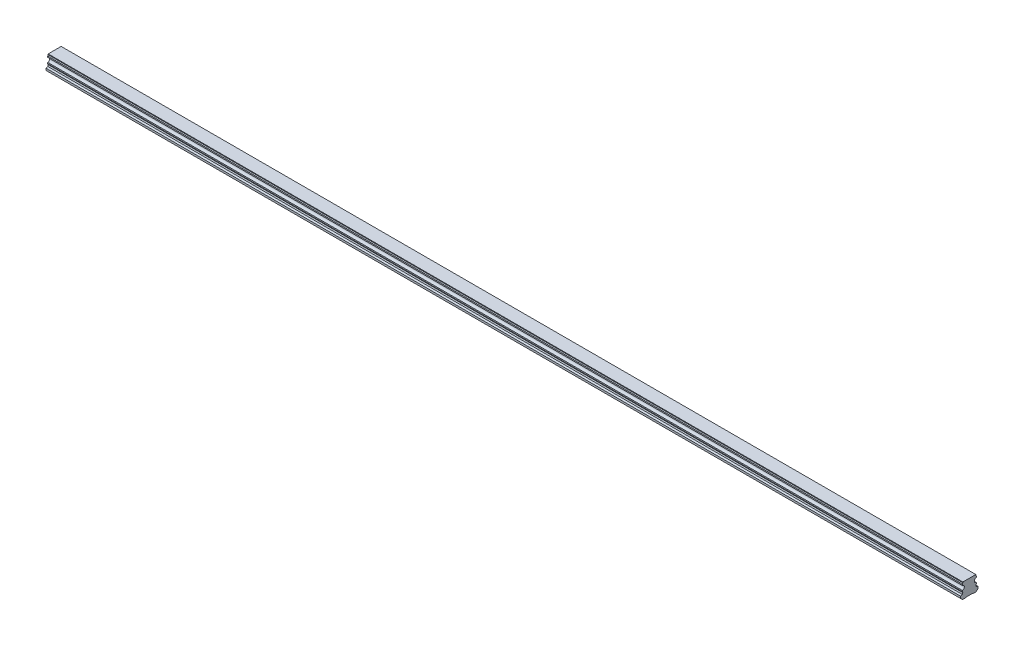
ISO-10303-21;
HEADER;
FILE_DESCRIPTION(('STEP AP214'),'2;1');
FILE_NAME('part.step','',(''),(''),'','','');
FILE_SCHEMA(('AUTOMOTIVE_DESIGN { 1 0 10303 214 1 1 1 1 }'));
ENDSEC;
DATA;
#1=APPLICATION_CONTEXT('core data for automotive mechanical design processes');
#2=APPLICATION_PROTOCOL_DEFINITION('international standard','automotive_design',2000,#1);
#3=PRODUCT_CONTEXT('',#1,'mechanical');
#4=PRODUCT('Part','Part','',(#3));
#5=PRODUCT_RELATED_PRODUCT_CATEGORY('part','',(#4));
#6=PRODUCT_DEFINITION_FORMATION('','',#4);
#7=PRODUCT_DEFINITION_CONTEXT('part definition',#1,'design');
#8=PRODUCT_DEFINITION('design','',#6,#7);
#9=PRODUCT_DEFINITION_SHAPE('','',#8);
#10=(LENGTH_UNIT() NAMED_UNIT(*) SI_UNIT(.MILLI.,.METRE.));
#11=(NAMED_UNIT(*) PLANE_ANGLE_UNIT() SI_UNIT($,.RADIAN.));
#12=(NAMED_UNIT(*) SI_UNIT($,.STERADIAN.) SOLID_ANGLE_UNIT());
#13=UNCERTAINTY_MEASURE_WITH_UNIT(LENGTH_MEASURE(1.E-05),#10,'distance_accuracy_value','');
#14=(GEOMETRIC_REPRESENTATION_CONTEXT(3) GLOBAL_UNCERTAINTY_ASSIGNED_CONTEXT((#13)) GLOBAL_UNIT_ASSIGNED_CONTEXT((#10,
#11,#12)) REPRESENTATION_CONTEXT('',''));
#15=CARTESIAN_POINT('',(0.,0.,0.));
#16=DIRECTION('',(0.,0.,1.));
#17=DIRECTION('',(1.,0.,0.));
#18=AXIS2_PLACEMENT_3D('',#15,#16,#17);
#19=CARTESIAN_POINT('',(1290.,0.499999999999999,0.));
#20=DIRECTION('',(0.,-1.,0.));
#21=DIRECTION('',(0.,0.,-1.));
#22=AXIS2_PLACEMENT_3D('',#19,#20,#21);
#23=CONICAL_SURFACE('',#22,3.5,0.785398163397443);
#24=CARTESIAN_POINT('',(1290.,1.00000000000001,0.));
#25=DIRECTION('',(0.,1.,0.));
#26=DIRECTION('',(0.,0.,1.));
#27=AXIS2_PLACEMENT_3D('',#24,#25,#26);
#28=CIRCLE('',#27,3.);
#29=CARTESIAN_POINT('',(1290.,1.00000000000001,3.));
#30=VERTEX_POINT('',#29);
#31=EDGE_CURVE('E11',#30,#30,#28,.F.);
#32=ORIENTED_EDGE('',*,*,#31,.F.);
#33=EDGE_LOOP('',(#32));
#34=FACE_BOUND('',#33,.T.);
#35=CARTESIAN_POINT('',(1290.,0.499999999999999,0.));
#36=DIRECTION('',(0.,1.,0.));
#37=DIRECTION('',(0.,0.,1.));
#38=AXIS2_PLACEMENT_3D('',#35,#36,#37);
#39=CIRCLE('',#38,3.5);
#40=CARTESIAN_POINT('',(1290.,0.5,3.5));
#41=VERTEX_POINT('',#40);
#42=EDGE_CURVE('E661',#41,#41,#39,.T.);
#43=ORIENTED_EDGE('',*,*,#42,.F.);
#44=EDGE_LOOP('',(#43));
#45=FACE_BOUND('',#44,.T.);
#46=ADVANCED_FACE('F39',(#34,#45),#23,.F.);
#47=CARTESIAN_POINT('',(1290.,12.,0.));
#48=DIRECTION('',(0.,-1.,0.));
#49=DIRECTION('',(0.,0.,-1.));
#50=AXIS2_PLACEMENT_3D('',#47,#48,#49);
#51=CYLINDRICAL_SURFACE('',#50,3.);
#52=ORIENTED_EDGE('',*,*,#31,.T.);
#53=EDGE_LOOP('',(#52));
#54=FACE_BOUND('',#53,.T.);
#55=CARTESIAN_POINT('',(1290.,12.,0.));
#56=DIRECTION('',(0.,-1.,0.));
#57=DIRECTION('',(0.,0.,-1.));
#58=AXIS2_PLACEMENT_3D('',#55,#56,#57);
#59=CIRCLE('',#58,3.);
#60=CARTESIAN_POINT('',(1290.,12.,-3.));
#61=VERTEX_POINT('',#60);
#62=EDGE_CURVE('E49',#61,#61,#59,.T.);
#63=ORIENTED_EDGE('',*,*,#62,.F.);
#64=EDGE_LOOP('',(#63));
#65=FACE_BOUND('',#64,.T.);
#66=ADVANCED_FACE('F945',(#54,#65),#51,.F.);
#67=CARTESIAN_POINT('',(1290.,12.,0.));
#68=DIRECTION('',(0.,-1.,0.));
#69=DIRECTION('',(0.,0.,-1.));
#70=AXIS2_PLACEMENT_3D('',#67,#68,#69);
#71=PLANE('',#70);
#72=CARTESIAN_POINT('',(1290.,12.,0.));
#73=DIRECTION('',(0.,-1.,0.));
#74=DIRECTION('',(0.,0.,-1.));
#75=AXIS2_PLACEMENT_3D('',#72,#73,#74);
#76=CIRCLE('',#75,2.5);
#77=CARTESIAN_POINT('',(1290.,12.,-2.5));
#78=VERTEX_POINT('',#77);
#79=EDGE_CURVE('E42',#78,#78,#76,.T.);
#80=ORIENTED_EDGE('',*,*,#79,.F.);
#81=EDGE_LOOP('',(#80));
#82=FACE_BOUND('',#81,.T.);
#83=ORIENTED_EDGE('',*,*,#62,.T.);
#84=EDGE_LOOP('',(#83));
#85=FACE_BOUND('',#84,.T.);
#86=ADVANCED_FACE('F950',(#82,#85),#71,.T.);
#87=CARTESIAN_POINT('',(1230.,0.499999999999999,0.));
#88=DIRECTION('',(0.,-1.,0.));
#89=DIRECTION('',(0.,0.,-1.));
#90=AXIS2_PLACEMENT_3D('',#87,#88,#89);
#91=CONICAL_SURFACE('',#90,3.5,0.785398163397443);
#92=CARTESIAN_POINT('',(1230.,1.00000000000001,0.));
#93=DIRECTION('',(0.,1.,0.));
#94=DIRECTION('',(0.,0.,1.));
#95=AXIS2_PLACEMENT_3D('',#92,#93,#94);
#96=CIRCLE('',#95,3.);
#97=CARTESIAN_POINT('',(1230.,1.00000000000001,3.));
#98=VERTEX_POINT('',#97);
#99=EDGE_CURVE('E657',#98,#98,#96,.F.);
#100=ORIENTED_EDGE('',*,*,#99,.F.);
#101=EDGE_LOOP('',(#100));
#102=FACE_BOUND('',#101,.T.);
#103=CARTESIAN_POINT('',(1230.,0.499999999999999,0.));
#104=DIRECTION('',(0.,1.,0.));
#105=DIRECTION('',(0.,0.,1.));
#106=AXIS2_PLACEMENT_3D('',#103,#104,#105);
#107=CIRCLE('',#106,3.5);
#108=CARTESIAN_POINT('',(1230.,0.5,3.5));
#109=VERTEX_POINT('',#108);
#110=EDGE_CURVE('E649',#109,#109,#107,.T.);
#111=ORIENTED_EDGE('',*,*,#110,.F.);
#112=EDGE_LOOP('',(#111));
#113=FACE_BOUND('',#112,.T.);
#114=ADVANCED_FACE('F1253',(#102,#113),#91,.F.);
#115=CARTESIAN_POINT('',(1230.,12.,0.));
#116=DIRECTION('',(0.,-1.,0.));
#117=DIRECTION('',(0.,0.,-1.));
#118=AXIS2_PLACEMENT_3D('',#115,#116,#117);
#119=CYLINDRICAL_SURFACE('',#118,3.);
#120=ORIENTED_EDGE('',*,*,#99,.T.);
#121=EDGE_LOOP('',(#120));
#122=FACE_BOUND('',#121,.T.);
#123=CARTESIAN_POINT('',(1230.,12.,0.));
#124=DIRECTION('',(0.,-1.,0.));
#125=DIRECTION('',(0.,0.,-1.));
#126=AXIS2_PLACEMENT_3D('',#123,#124,#125);
#127=CIRCLE('',#126,3.);
#128=CARTESIAN_POINT('',(1230.,12.,-3.));
#129=VERTEX_POINT('',#128);
#130=EDGE_CURVE('E653',#129,#129,#127,.T.);
#131=ORIENTED_EDGE('',*,*,#130,.F.);
#132=EDGE_LOOP('',(#131));
#133=FACE_BOUND('',#132,.T.);
#134=ADVANCED_FACE('F1249',(#122,#133),#119,.F.);
#135=CARTESIAN_POINT('',(1230.,12.,0.));
#136=DIRECTION('',(0.,-1.,0.));
#137=DIRECTION('',(0.,0.,-1.));
#138=AXIS2_PLACEMENT_3D('',#135,#136,#137);
#139=PLANE('',#138);
#140=CARTESIAN_POINT('',(1230.,12.,0.));
#141=DIRECTION('',(0.,-1.,0.));
#142=DIRECTION('',(0.,0.,-1.));
#143=AXIS2_PLACEMENT_3D('',#140,#141,#142);
#144=CIRCLE('',#143,2.5);
#145=CARTESIAN_POINT('',(1230.,12.,-2.5));
#146=VERTEX_POINT('',#145);
#147=EDGE_CURVE('E744',#146,#146,#144,.T.);
#148=ORIENTED_EDGE('',*,*,#147,.F.);
#149=EDGE_LOOP('',(#148));
#150=FACE_BOUND('',#149,.T.);
#151=ORIENTED_EDGE('',*,*,#130,.T.);
#152=EDGE_LOOP('',(#151));
#153=FACE_BOUND('',#152,.T.);
#154=ADVANCED_FACE('F1245',(#150,#153),#139,.T.);
#155=CARTESIAN_POINT('',(1170.,0.499999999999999,0.));
#156=DIRECTION('',(0.,-1.,0.));
#157=DIRECTION('',(0.,0.,-1.));
#158=AXIS2_PLACEMENT_3D('',#155,#156,#157);
#159=CONICAL_SURFACE('',#158,3.5,0.785398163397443);
#160=CARTESIAN_POINT('',(1170.,1.00000000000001,0.));
#161=DIRECTION('',(0.,1.,0.));
#162=DIRECTION('',(0.,0.,1.));
#163=AXIS2_PLACEMENT_3D('',#160,#161,#162);
#164=CIRCLE('',#163,3.);
#165=CARTESIAN_POINT('',(1170.,1.00000000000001,3.));
#166=VERTEX_POINT('',#165);
#167=EDGE_CURVE('E645',#166,#166,#164,.F.);
#168=ORIENTED_EDGE('',*,*,#167,.F.);
#169=EDGE_LOOP('',(#168));
#170=FACE_BOUND('',#169,.T.);
#171=CARTESIAN_POINT('',(1170.,0.499999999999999,0.));
#172=DIRECTION('',(0.,1.,0.));
#173=DIRECTION('',(0.,0.,1.));
#174=AXIS2_PLACEMENT_3D('',#171,#172,#173);
#175=CIRCLE('',#174,3.5);
#176=CARTESIAN_POINT('',(1170.,0.5,3.5));
#177=VERTEX_POINT('',#176);
#178=EDGE_CURVE('E637',#177,#177,#175,.T.);
#179=ORIENTED_EDGE('',*,*,#178,.F.);
#180=EDGE_LOOP('',(#179));
#181=FACE_BOUND('',#180,.T.);
#182=ADVANCED_FACE('F1241',(#170,#181),#159,.F.);
#183=CARTESIAN_POINT('',(1170.,12.,0.));
#184=DIRECTION('',(0.,-1.,0.));
#185=DIRECTION('',(0.,0.,-1.));
#186=AXIS2_PLACEMENT_3D('',#183,#184,#185);
#187=CYLINDRICAL_SURFACE('',#186,3.);
#188=ORIENTED_EDGE('',*,*,#167,.T.);
#189=EDGE_LOOP('',(#188));
#190=FACE_BOUND('',#189,.T.);
#191=CARTESIAN_POINT('',(1170.,12.,0.));
#192=DIRECTION('',(0.,-1.,0.));
#193=DIRECTION('',(0.,0.,-1.));
#194=AXIS2_PLACEMENT_3D('',#191,#192,#193);
#195=CIRCLE('',#194,3.);
#196=CARTESIAN_POINT('',(1170.,12.,-3.));
#197=VERTEX_POINT('',#196);
#198=EDGE_CURVE('E641',#197,#197,#195,.T.);
#199=ORIENTED_EDGE('',*,*,#198,.F.);
#200=EDGE_LOOP('',(#199));
#201=FACE_BOUND('',#200,.T.);
#202=ADVANCED_FACE('F1237',(#190,#201),#187,.F.);
#203=CARTESIAN_POINT('',(1170.,12.,0.));
#204=DIRECTION('',(0.,-1.,0.));
#205=DIRECTION('',(0.,0.,-1.));
#206=AXIS2_PLACEMENT_3D('',#203,#204,#205);
#207=PLANE('',#206);
#208=CARTESIAN_POINT('',(1170.,12.,0.));
#209=DIRECTION('',(0.,-1.,0.));
#210=DIRECTION('',(0.,0.,-1.));
#211=AXIS2_PLACEMENT_3D('',#208,#209,#210);
#212=CIRCLE('',#211,2.5);
#213=CARTESIAN_POINT('',(1170.,12.,-2.5));
#214=VERTEX_POINT('',#213);
#215=EDGE_CURVE('E741',#214,#214,#212,.T.);
#216=ORIENTED_EDGE('',*,*,#215,.F.);
#217=EDGE_LOOP('',(#216));
#218=FACE_BOUND('',#217,.T.);
#219=ORIENTED_EDGE('',*,*,#198,.T.);
#220=EDGE_LOOP('',(#219));
#221=FACE_BOUND('',#220,.T.);
#222=ADVANCED_FACE('F1233',(#218,#221),#207,.T.);
#223=CARTESIAN_POINT('',(1110.,0.499999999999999,0.));
#224=DIRECTION('',(0.,-1.,0.));
#225=DIRECTION('',(0.,0.,-1.));
#226=AXIS2_PLACEMENT_3D('',#223,#224,#225);
#227=CONICAL_SURFACE('',#226,3.5,0.785398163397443);
#228=CARTESIAN_POINT('',(1110.,1.00000000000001,0.));
#229=DIRECTION('',(0.,1.,0.));
#230=DIRECTION('',(0.,0.,1.));
#231=AXIS2_PLACEMENT_3D('',#228,#229,#230);
#232=CIRCLE('',#231,3.);
#233=CARTESIAN_POINT('',(1110.,1.00000000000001,3.));
#234=VERTEX_POINT('',#233);
#235=EDGE_CURVE('E633',#234,#234,#232,.F.);
#236=ORIENTED_EDGE('',*,*,#235,.F.);
#237=EDGE_LOOP('',(#236));
#238=FACE_BOUND('',#237,.T.);
#239=CARTESIAN_POINT('',(1110.,0.499999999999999,0.));
#240=DIRECTION('',(0.,1.,0.));
#241=DIRECTION('',(0.,0.,1.));
#242=AXIS2_PLACEMENT_3D('',#239,#240,#241);
#243=CIRCLE('',#242,3.5);
#244=CARTESIAN_POINT('',(1110.,0.5,3.5));
#245=VERTEX_POINT('',#244);
#246=EDGE_CURVE('E625',#245,#245,#243,.T.);
#247=ORIENTED_EDGE('',*,*,#246,.F.);
#248=EDGE_LOOP('',(#247));
#249=FACE_BOUND('',#248,.T.);
#250=ADVANCED_FACE('F1229',(#238,#249),#227,.F.);
#251=CARTESIAN_POINT('',(1110.,12.,0.));
#252=DIRECTION('',(0.,-1.,0.));
#253=DIRECTION('',(0.,0.,-1.));
#254=AXIS2_PLACEMENT_3D('',#251,#252,#253);
#255=CYLINDRICAL_SURFACE('',#254,3.);
#256=ORIENTED_EDGE('',*,*,#235,.T.);
#257=EDGE_LOOP('',(#256));
#258=FACE_BOUND('',#257,.T.);
#259=CARTESIAN_POINT('',(1110.,12.,0.));
#260=DIRECTION('',(0.,-1.,0.));
#261=DIRECTION('',(0.,0.,-1.));
#262=AXIS2_PLACEMENT_3D('',#259,#260,#261);
#263=CIRCLE('',#262,3.);
#264=CARTESIAN_POINT('',(1110.,12.,-3.));
#265=VERTEX_POINT('',#264);
#266=EDGE_CURVE('E629',#265,#265,#263,.T.);
#267=ORIENTED_EDGE('',*,*,#266,.F.);
#268=EDGE_LOOP('',(#267));
#269=FACE_BOUND('',#268,.T.);
#270=ADVANCED_FACE('F1225',(#258,#269),#255,.F.);
#271=CARTESIAN_POINT('',(1110.,12.,0.));
#272=DIRECTION('',(0.,-1.,0.));
#273=DIRECTION('',(0.,0.,-1.));
#274=AXIS2_PLACEMENT_3D('',#271,#272,#273);
#275=PLANE('',#274);
#276=CARTESIAN_POINT('',(1110.,12.,0.));
#277=DIRECTION('',(0.,-1.,0.));
#278=DIRECTION('',(0.,0.,-1.));
#279=AXIS2_PLACEMENT_3D('',#276,#277,#278);
#280=CIRCLE('',#279,2.5);
#281=CARTESIAN_POINT('',(1110.,12.,-2.5));
#282=VERTEX_POINT('',#281);
#283=EDGE_CURVE('E737',#282,#282,#280,.T.);
#284=ORIENTED_EDGE('',*,*,#283,.F.);
#285=EDGE_LOOP('',(#284));
#286=FACE_BOUND('',#285,.T.);
#287=ORIENTED_EDGE('',*,*,#266,.T.);
#288=EDGE_LOOP('',(#287));
#289=FACE_BOUND('',#288,.T.);
#290=ADVANCED_FACE('F1221',(#286,#289),#275,.T.);
#291=CARTESIAN_POINT('',(1050.,0.499999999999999,0.));
#292=DIRECTION('',(0.,-1.,0.));
#293=DIRECTION('',(0.,0.,-1.));
#294=AXIS2_PLACEMENT_3D('',#291,#292,#293);
#295=CONICAL_SURFACE('',#294,3.5,0.785398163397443);
#296=CARTESIAN_POINT('',(1050.,1.00000000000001,0.));
#297=DIRECTION('',(0.,1.,0.));
#298=DIRECTION('',(0.,0.,1.));
#299=AXIS2_PLACEMENT_3D('',#296,#297,#298);
#300=CIRCLE('',#299,3.);
#301=CARTESIAN_POINT('',(1050.,1.00000000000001,3.));
#302=VERTEX_POINT('',#301);
#303=EDGE_CURVE('E621',#302,#302,#300,.F.);
#304=ORIENTED_EDGE('',*,*,#303,.F.);
#305=EDGE_LOOP('',(#304));
#306=FACE_BOUND('',#305,.T.);
#307=CARTESIAN_POINT('',(1050.,0.499999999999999,0.));
#308=DIRECTION('',(0.,1.,0.));
#309=DIRECTION('',(0.,0.,1.));
#310=AXIS2_PLACEMENT_3D('',#307,#308,#309);
#311=CIRCLE('',#310,3.5);
#312=CARTESIAN_POINT('',(1050.,0.5,3.5));
#313=VERTEX_POINT('',#312);
#314=EDGE_CURVE('E613',#313,#313,#311,.T.);
#315=ORIENTED_EDGE('',*,*,#314,.F.);
#316=EDGE_LOOP('',(#315));
#317=FACE_BOUND('',#316,.T.);
#318=ADVANCED_FACE('F1217',(#306,#317),#295,.F.);
#319=CARTESIAN_POINT('',(1050.,12.,0.));
#320=DIRECTION('',(0.,-1.,0.));
#321=DIRECTION('',(0.,0.,-1.));
#322=AXIS2_PLACEMENT_3D('',#319,#320,#321);
#323=CYLINDRICAL_SURFACE('',#322,3.);
#324=ORIENTED_EDGE('',*,*,#303,.T.);
#325=EDGE_LOOP('',(#324));
#326=FACE_BOUND('',#325,.T.);
#327=CARTESIAN_POINT('',(1050.,12.,0.));
#328=DIRECTION('',(0.,-1.,0.));
#329=DIRECTION('',(0.,0.,-1.));
#330=AXIS2_PLACEMENT_3D('',#327,#328,#329);
#331=CIRCLE('',#330,3.);
#332=CARTESIAN_POINT('',(1050.,12.,-3.));
#333=VERTEX_POINT('',#332);
#334=EDGE_CURVE('E617',#333,#333,#331,.T.);
#335=ORIENTED_EDGE('',*,*,#334,.F.);
#336=EDGE_LOOP('',(#335));
#337=FACE_BOUND('',#336,.T.);
#338=ADVANCED_FACE('F1213',(#326,#337),#323,.F.);
#339=CARTESIAN_POINT('',(1050.,12.,0.));
#340=DIRECTION('',(0.,-1.,0.));
#341=DIRECTION('',(0.,0.,-1.));
#342=AXIS2_PLACEMENT_3D('',#339,#340,#341);
#343=PLANE('',#342);
#344=CARTESIAN_POINT('',(1050.,12.,0.));
#345=DIRECTION('',(0.,-1.,0.));
#346=DIRECTION('',(0.,0.,-1.));
#347=AXIS2_PLACEMENT_3D('',#344,#345,#346);
#348=CIRCLE('',#347,2.5);
#349=CARTESIAN_POINT('',(1050.,12.,-2.5));
#350=VERTEX_POINT('',#349);
#351=EDGE_CURVE('E733',#350,#350,#348,.T.);
#352=ORIENTED_EDGE('',*,*,#351,.F.);
#353=EDGE_LOOP('',(#352));
#354=FACE_BOUND('',#353,.T.);
#355=ORIENTED_EDGE('',*,*,#334,.T.);
#356=EDGE_LOOP('',(#355));
#357=FACE_BOUND('',#356,.T.);
#358=ADVANCED_FACE('F1209',(#354,#357),#343,.T.);
#359=CARTESIAN_POINT('',(990.,0.499999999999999,0.));
#360=DIRECTION('',(0.,-1.,0.));
#361=DIRECTION('',(0.,0.,-1.));
#362=AXIS2_PLACEMENT_3D('',#359,#360,#361);
#363=CONICAL_SURFACE('',#362,3.5,0.785398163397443);
#364=CARTESIAN_POINT('',(990.,1.00000000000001,0.));
#365=DIRECTION('',(0.,1.,0.));
#366=DIRECTION('',(0.,0.,1.));
#367=AXIS2_PLACEMENT_3D('',#364,#365,#366);
#368=CIRCLE('',#367,3.);
#369=CARTESIAN_POINT('',(990.,1.00000000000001,3.));
#370=VERTEX_POINT('',#369);
#371=EDGE_CURVE('E609',#370,#370,#368,.F.);
#372=ORIENTED_EDGE('',*,*,#371,.F.);
#373=EDGE_LOOP('',(#372));
#374=FACE_BOUND('',#373,.T.);
#375=CARTESIAN_POINT('',(990.,0.499999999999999,0.));
#376=DIRECTION('',(0.,1.,0.));
#377=DIRECTION('',(0.,0.,1.));
#378=AXIS2_PLACEMENT_3D('',#375,#376,#377);
#379=CIRCLE('',#378,3.5);
#380=CARTESIAN_POINT('',(990.,0.5,3.5));
#381=VERTEX_POINT('',#380);
#382=EDGE_CURVE('E601',#381,#381,#379,.T.);
#383=ORIENTED_EDGE('',*,*,#382,.F.);
#384=EDGE_LOOP('',(#383));
#385=FACE_BOUND('',#384,.T.);
#386=ADVANCED_FACE('F1205',(#374,#385),#363,.F.);
#387=CARTESIAN_POINT('',(990.,12.,0.));
#388=DIRECTION('',(0.,-1.,0.));
#389=DIRECTION('',(0.,0.,-1.));
#390=AXIS2_PLACEMENT_3D('',#387,#388,#389);
#391=CYLINDRICAL_SURFACE('',#390,3.);
#392=ORIENTED_EDGE('',*,*,#371,.T.);
#393=EDGE_LOOP('',(#392));
#394=FACE_BOUND('',#393,.T.);
#395=CARTESIAN_POINT('',(990.,12.,0.));
#396=DIRECTION('',(0.,-1.,0.));
#397=DIRECTION('',(0.,0.,-1.));
#398=AXIS2_PLACEMENT_3D('',#395,#396,#397);
#399=CIRCLE('',#398,3.);
#400=CARTESIAN_POINT('',(990.,12.,-3.));
#401=VERTEX_POINT('',#400);
#402=EDGE_CURVE('E605',#401,#401,#399,.T.);
#403=ORIENTED_EDGE('',*,*,#402,.F.);
#404=EDGE_LOOP('',(#403));
#405=FACE_BOUND('',#404,.T.);
#406=ADVANCED_FACE('F1201',(#394,#405),#391,.F.);
#407=CARTESIAN_POINT('',(990.,12.,0.));
#408=DIRECTION('',(0.,-1.,0.));
#409=DIRECTION('',(0.,0.,-1.));
#410=AXIS2_PLACEMENT_3D('',#407,#408,#409);
#411=PLANE('',#410);
#412=CARTESIAN_POINT('',(990.,12.,0.));
#413=DIRECTION('',(0.,-1.,0.));
#414=DIRECTION('',(0.,0.,-1.));
#415=AXIS2_PLACEMENT_3D('',#412,#413,#414);
#416=CIRCLE('',#415,2.5);
#417=CARTESIAN_POINT('',(990.,12.,-2.5));
#418=VERTEX_POINT('',#417);
#419=EDGE_CURVE('E729',#418,#418,#416,.T.);
#420=ORIENTED_EDGE('',*,*,#419,.F.);
#421=EDGE_LOOP('',(#420));
#422=FACE_BOUND('',#421,.T.);
#423=ORIENTED_EDGE('',*,*,#402,.T.);
#424=EDGE_LOOP('',(#423));
#425=FACE_BOUND('',#424,.T.);
#426=ADVANCED_FACE('F1197',(#422,#425),#411,.T.);
#427=CARTESIAN_POINT('',(930.,0.499999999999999,0.));
#428=DIRECTION('',(0.,-1.,0.));
#429=DIRECTION('',(0.,0.,-1.));
#430=AXIS2_PLACEMENT_3D('',#427,#428,#429);
#431=CONICAL_SURFACE('',#430,3.5,0.785398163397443);
#432=CARTESIAN_POINT('',(930.,1.00000000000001,0.));
#433=DIRECTION('',(0.,1.,0.));
#434=DIRECTION('',(0.,0.,1.));
#435=AXIS2_PLACEMENT_3D('',#432,#433,#434);
#436=CIRCLE('',#435,3.);
#437=CARTESIAN_POINT('',(930.,1.00000000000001,3.));
#438=VERTEX_POINT('',#437);
#439=EDGE_CURVE('E597',#438,#438,#436,.F.);
#440=ORIENTED_EDGE('',*,*,#439,.F.);
#441=EDGE_LOOP('',(#440));
#442=FACE_BOUND('',#441,.T.);
#443=CARTESIAN_POINT('',(930.,0.499999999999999,0.));
#444=DIRECTION('',(0.,1.,0.));
#445=DIRECTION('',(0.,0.,1.));
#446=AXIS2_PLACEMENT_3D('',#443,#444,#445);
#447=CIRCLE('',#446,3.5);
#448=CARTESIAN_POINT('',(930.,0.5,3.5));
#449=VERTEX_POINT('',#448);
#450=EDGE_CURVE('E589',#449,#449,#447,.T.);
#451=ORIENTED_EDGE('',*,*,#450,.F.);
#452=EDGE_LOOP('',(#451));
#453=FACE_BOUND('',#452,.T.);
#454=ADVANCED_FACE('F1193',(#442,#453),#431,.F.);
#455=CARTESIAN_POINT('',(930.,12.,0.));
#456=DIRECTION('',(0.,-1.,0.));
#457=DIRECTION('',(0.,0.,-1.));
#458=AXIS2_PLACEMENT_3D('',#455,#456,#457);
#459=CYLINDRICAL_SURFACE('',#458,3.);
#460=ORIENTED_EDGE('',*,*,#439,.T.);
#461=EDGE_LOOP('',(#460));
#462=FACE_BOUND('',#461,.T.);
#463=CARTESIAN_POINT('',(930.,12.,0.));
#464=DIRECTION('',(0.,-1.,0.));
#465=DIRECTION('',(0.,0.,-1.));
#466=AXIS2_PLACEMENT_3D('',#463,#464,#465);
#467=CIRCLE('',#466,3.);
#468=CARTESIAN_POINT('',(930.,12.,-3.));
#469=VERTEX_POINT('',#468);
#470=EDGE_CURVE('E593',#469,#469,#467,.T.);
#471=ORIENTED_EDGE('',*,*,#470,.F.);
#472=EDGE_LOOP('',(#471));
#473=FACE_BOUND('',#472,.T.);
#474=ADVANCED_FACE('F1189',(#462,#473),#459,.F.);
#475=CARTESIAN_POINT('',(930.,12.,0.));
#476=DIRECTION('',(0.,-1.,0.));
#477=DIRECTION('',(0.,0.,-1.));
#478=AXIS2_PLACEMENT_3D('',#475,#476,#477);
#479=PLANE('',#478);
#480=CARTESIAN_POINT('',(930.,12.,0.));
#481=DIRECTION('',(0.,-1.,0.));
#482=DIRECTION('',(0.,0.,-1.));
#483=AXIS2_PLACEMENT_3D('',#480,#481,#482);
#484=CIRCLE('',#483,2.5);
#485=CARTESIAN_POINT('',(930.,12.,-2.5));
#486=VERTEX_POINT('',#485);
#487=EDGE_CURVE('E725',#486,#486,#484,.T.);
#488=ORIENTED_EDGE('',*,*,#487,.F.);
#489=EDGE_LOOP('',(#488));
#490=FACE_BOUND('',#489,.T.);
#491=ORIENTED_EDGE('',*,*,#470,.T.);
#492=EDGE_LOOP('',(#491));
#493=FACE_BOUND('',#492,.T.);
#494=ADVANCED_FACE('F1185',(#490,#493),#479,.T.);
#495=CARTESIAN_POINT('',(870.,0.499999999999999,0.));
#496=DIRECTION('',(0.,-1.,0.));
#497=DIRECTION('',(0.,0.,-1.));
#498=AXIS2_PLACEMENT_3D('',#495,#496,#497);
#499=CONICAL_SURFACE('',#498,3.5,0.785398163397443);
#500=CARTESIAN_POINT('',(870.,1.00000000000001,0.));
#501=DIRECTION('',(0.,1.,0.));
#502=DIRECTION('',(0.,0.,1.));
#503=AXIS2_PLACEMENT_3D('',#500,#501,#502);
#504=CIRCLE('',#503,3.);
#505=CARTESIAN_POINT('',(870.,1.00000000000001,3.));
#506=VERTEX_POINT('',#505);
#507=EDGE_CURVE('E585',#506,#506,#504,.F.);
#508=ORIENTED_EDGE('',*,*,#507,.F.);
#509=EDGE_LOOP('',(#508));
#510=FACE_BOUND('',#509,.T.);
#511=CARTESIAN_POINT('',(870.,0.499999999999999,0.));
#512=DIRECTION('',(0.,1.,0.));
#513=DIRECTION('',(0.,0.,1.));
#514=AXIS2_PLACEMENT_3D('',#511,#512,#513);
#515=CIRCLE('',#514,3.5);
#516=CARTESIAN_POINT('',(870.,0.5,3.5));
#517=VERTEX_POINT('',#516);
#518=EDGE_CURVE('E577',#517,#517,#515,.T.);
#519=ORIENTED_EDGE('',*,*,#518,.F.);
#520=EDGE_LOOP('',(#519));
#521=FACE_BOUND('',#520,.T.);
#522=ADVANCED_FACE('F1181',(#510,#521),#499,.F.);
#523=CARTESIAN_POINT('',(870.,12.,0.));
#524=DIRECTION('',(0.,-1.,0.));
#525=DIRECTION('',(0.,0.,-1.));
#526=AXIS2_PLACEMENT_3D('',#523,#524,#525);
#527=CYLINDRICAL_SURFACE('',#526,3.);
#528=ORIENTED_EDGE('',*,*,#507,.T.);
#529=EDGE_LOOP('',(#528));
#530=FACE_BOUND('',#529,.T.);
#531=CARTESIAN_POINT('',(870.,12.,0.));
#532=DIRECTION('',(0.,-1.,0.));
#533=DIRECTION('',(0.,0.,-1.));
#534=AXIS2_PLACEMENT_3D('',#531,#532,#533);
#535=CIRCLE('',#534,3.);
#536=CARTESIAN_POINT('',(870.,12.,-3.));
#537=VERTEX_POINT('',#536);
#538=EDGE_CURVE('E581',#537,#537,#535,.T.);
#539=ORIENTED_EDGE('',*,*,#538,.F.);
#540=EDGE_LOOP('',(#539));
#541=FACE_BOUND('',#540,.T.);
#542=ADVANCED_FACE('F1177',(#530,#541),#527,.F.);
#543=CARTESIAN_POINT('',(870.,12.,0.));
#544=DIRECTION('',(0.,-1.,0.));
#545=DIRECTION('',(0.,0.,-1.));
#546=AXIS2_PLACEMENT_3D('',#543,#544,#545);
#547=PLANE('',#546);
#548=CARTESIAN_POINT('',(870.,12.,0.));
#549=DIRECTION('',(0.,-1.,0.));
#550=DIRECTION('',(0.,0.,-1.));
#551=AXIS2_PLACEMENT_3D('',#548,#549,#550);
#552=CIRCLE('',#551,2.5);
#553=CARTESIAN_POINT('',(870.,12.,-2.5));
#554=VERTEX_POINT('',#553);
#555=EDGE_CURVE('E721',#554,#554,#552,.T.);
#556=ORIENTED_EDGE('',*,*,#555,.F.);
#557=EDGE_LOOP('',(#556));
#558=FACE_BOUND('',#557,.T.);
#559=ORIENTED_EDGE('',*,*,#538,.T.);
#560=EDGE_LOOP('',(#559));
#561=FACE_BOUND('',#560,.T.);
#562=ADVANCED_FACE('F1173',(#558,#561),#547,.T.);
#563=CARTESIAN_POINT('',(810.,0.499999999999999,0.));
#564=DIRECTION('',(0.,-1.,0.));
#565=DIRECTION('',(0.,0.,-1.));
#566=AXIS2_PLACEMENT_3D('',#563,#564,#565);
#567=CONICAL_SURFACE('',#566,3.5,0.785398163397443);
#568=CARTESIAN_POINT('',(810.,1.00000000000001,0.));
#569=DIRECTION('',(0.,1.,0.));
#570=DIRECTION('',(0.,0.,1.));
#571=AXIS2_PLACEMENT_3D('',#568,#569,#570);
#572=CIRCLE('',#571,3.);
#573=CARTESIAN_POINT('',(810.,1.00000000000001,3.));
#574=VERTEX_POINT('',#573);
#575=EDGE_CURVE('E573',#574,#574,#572,.F.);
#576=ORIENTED_EDGE('',*,*,#575,.F.);
#577=EDGE_LOOP('',(#576));
#578=FACE_BOUND('',#577,.T.);
#579=CARTESIAN_POINT('',(810.,0.499999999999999,0.));
#580=DIRECTION('',(0.,1.,0.));
#581=DIRECTION('',(0.,0.,1.));
#582=AXIS2_PLACEMENT_3D('',#579,#580,#581);
#583=CIRCLE('',#582,3.5);
#584=CARTESIAN_POINT('',(810.,0.5,3.5));
#585=VERTEX_POINT('',#584);
#586=EDGE_CURVE('E565',#585,#585,#583,.T.);
#587=ORIENTED_EDGE('',*,*,#586,.F.);
#588=EDGE_LOOP('',(#587));
#589=FACE_BOUND('',#588,.T.);
#590=ADVANCED_FACE('F1169',(#578,#589),#567,.F.);
#591=CARTESIAN_POINT('',(810.,12.,0.));
#592=DIRECTION('',(0.,-1.,0.));
#593=DIRECTION('',(0.,0.,-1.));
#594=AXIS2_PLACEMENT_3D('',#591,#592,#593);
#595=CYLINDRICAL_SURFACE('',#594,3.);
#596=ORIENTED_EDGE('',*,*,#575,.T.);
#597=EDGE_LOOP('',(#596));
#598=FACE_BOUND('',#597,.T.);
#599=CARTESIAN_POINT('',(810.,12.,0.));
#600=DIRECTION('',(0.,-1.,0.));
#601=DIRECTION('',(0.,0.,-1.));
#602=AXIS2_PLACEMENT_3D('',#599,#600,#601);
#603=CIRCLE('',#602,3.);
#604=CARTESIAN_POINT('',(810.,12.,-3.));
#605=VERTEX_POINT('',#604);
#606=EDGE_CURVE('E569',#605,#605,#603,.T.);
#607=ORIENTED_EDGE('',*,*,#606,.F.);
#608=EDGE_LOOP('',(#607));
#609=FACE_BOUND('',#608,.T.);
#610=ADVANCED_FACE('F1165',(#598,#609),#595,.F.);
#611=CARTESIAN_POINT('',(810.,12.,0.));
#612=DIRECTION('',(0.,-1.,0.));
#613=DIRECTION('',(0.,0.,-1.));
#614=AXIS2_PLACEMENT_3D('',#611,#612,#613);
#615=PLANE('',#614);
#616=CARTESIAN_POINT('',(810.,12.,0.));
#617=DIRECTION('',(0.,-1.,0.));
#618=DIRECTION('',(0.,0.,-1.));
#619=AXIS2_PLACEMENT_3D('',#616,#617,#618);
#620=CIRCLE('',#619,2.5);
#621=CARTESIAN_POINT('',(810.,12.,-2.5));
#622=VERTEX_POINT('',#621);
#623=EDGE_CURVE('E717',#622,#622,#620,.T.);
#624=ORIENTED_EDGE('',*,*,#623,.F.);
#625=EDGE_LOOP('',(#624));
#626=FACE_BOUND('',#625,.T.);
#627=ORIENTED_EDGE('',*,*,#606,.T.);
#628=EDGE_LOOP('',(#627));
#629=FACE_BOUND('',#628,.T.);
#630=ADVANCED_FACE('F1161',(#626,#629),#615,.T.);
#631=CARTESIAN_POINT('',(750.,0.499999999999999,0.));
#632=DIRECTION('',(0.,-1.,0.));
#633=DIRECTION('',(0.,0.,-1.));
#634=AXIS2_PLACEMENT_3D('',#631,#632,#633);
#635=CONICAL_SURFACE('',#634,3.5,0.785398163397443);
#636=CARTESIAN_POINT('',(750.,1.00000000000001,0.));
#637=DIRECTION('',(0.,1.,0.));
#638=DIRECTION('',(0.,0.,1.));
#639=AXIS2_PLACEMENT_3D('',#636,#637,#638);
#640=CIRCLE('',#639,3.);
#641=CARTESIAN_POINT('',(750.,1.00000000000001,3.));
#642=VERTEX_POINT('',#641);
#643=EDGE_CURVE('E561',#642,#642,#640,.F.);
#644=ORIENTED_EDGE('',*,*,#643,.F.);
#645=EDGE_LOOP('',(#644));
#646=FACE_BOUND('',#645,.T.);
#647=CARTESIAN_POINT('',(750.,0.499999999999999,0.));
#648=DIRECTION('',(0.,1.,0.));
#649=DIRECTION('',(0.,0.,1.));
#650=AXIS2_PLACEMENT_3D('',#647,#648,#649);
#651=CIRCLE('',#650,3.5);
#652=CARTESIAN_POINT('',(750.,0.5,3.5));
#653=VERTEX_POINT('',#652);
#654=EDGE_CURVE('E553',#653,#653,#651,.T.);
#655=ORIENTED_EDGE('',*,*,#654,.F.);
#656=EDGE_LOOP('',(#655));
#657=FACE_BOUND('',#656,.T.);
#658=ADVANCED_FACE('F1157',(#646,#657),#635,.F.);
#659=CARTESIAN_POINT('',(750.,12.,0.));
#660=DIRECTION('',(0.,-1.,0.));
#661=DIRECTION('',(0.,0.,-1.));
#662=AXIS2_PLACEMENT_3D('',#659,#660,#661);
#663=CYLINDRICAL_SURFACE('',#662,3.);
#664=ORIENTED_EDGE('',*,*,#643,.T.);
#665=EDGE_LOOP('',(#664));
#666=FACE_BOUND('',#665,.T.);
#667=CARTESIAN_POINT('',(750.,12.,0.));
#668=DIRECTION('',(0.,-1.,0.));
#669=DIRECTION('',(0.,0.,-1.));
#670=AXIS2_PLACEMENT_3D('',#667,#668,#669);
#671=CIRCLE('',#670,3.);
#672=CARTESIAN_POINT('',(750.,12.,-3.));
#673=VERTEX_POINT('',#672);
#674=EDGE_CURVE('E557',#673,#673,#671,.T.);
#675=ORIENTED_EDGE('',*,*,#674,.F.);
#676=EDGE_LOOP('',(#675));
#677=FACE_BOUND('',#676,.T.);
#678=ADVANCED_FACE('F1153',(#666,#677),#663,.F.);
#679=CARTESIAN_POINT('',(750.,12.,0.));
#680=DIRECTION('',(0.,-1.,0.));
#681=DIRECTION('',(0.,0.,-1.));
#682=AXIS2_PLACEMENT_3D('',#679,#680,#681);
#683=PLANE('',#682);
#684=CARTESIAN_POINT('',(750.,12.,0.));
#685=DIRECTION('',(0.,-1.,0.));
#686=DIRECTION('',(0.,0.,-1.));
#687=AXIS2_PLACEMENT_3D('',#684,#685,#686);
#688=CIRCLE('',#687,2.5);
#689=CARTESIAN_POINT('',(750.,12.,-2.5));
#690=VERTEX_POINT('',#689);
#691=EDGE_CURVE('E713',#690,#690,#688,.T.);
#692=ORIENTED_EDGE('',*,*,#691,.F.);
#693=EDGE_LOOP('',(#692));
#694=FACE_BOUND('',#693,.T.);
#695=ORIENTED_EDGE('',*,*,#674,.T.);
#696=EDGE_LOOP('',(#695));
#697=FACE_BOUND('',#696,.T.);
#698=ADVANCED_FACE('F1149',(#694,#697),#683,.T.);
#699=CARTESIAN_POINT('',(690.,0.499999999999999,0.));
#700=DIRECTION('',(0.,-1.,0.));
#701=DIRECTION('',(0.,0.,-1.));
#702=AXIS2_PLACEMENT_3D('',#699,#700,#701);
#703=CONICAL_SURFACE('',#702,3.5,0.785398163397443);
#704=CARTESIAN_POINT('',(690.,1.00000000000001,0.));
#705=DIRECTION('',(0.,1.,0.));
#706=DIRECTION('',(0.,0.,1.));
#707=AXIS2_PLACEMENT_3D('',#704,#705,#706);
#708=CIRCLE('',#707,3.);
#709=CARTESIAN_POINT('',(690.,1.00000000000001,3.));
#710=VERTEX_POINT('',#709);
#711=EDGE_CURVE('E549',#710,#710,#708,.F.);
#712=ORIENTED_EDGE('',*,*,#711,.F.);
#713=EDGE_LOOP('',(#712));
#714=FACE_BOUND('',#713,.T.);
#715=CARTESIAN_POINT('',(690.,0.499999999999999,0.));
#716=DIRECTION('',(0.,1.,0.));
#717=DIRECTION('',(0.,0.,1.));
#718=AXIS2_PLACEMENT_3D('',#715,#716,#717);
#719=CIRCLE('',#718,3.5);
#720=CARTESIAN_POINT('',(690.,0.5,3.5));
#721=VERTEX_POINT('',#720);
#722=EDGE_CURVE('E541',#721,#721,#719,.T.);
#723=ORIENTED_EDGE('',*,*,#722,.F.);
#724=EDGE_LOOP('',(#723));
#725=FACE_BOUND('',#724,.T.);
#726=ADVANCED_FACE('F1145',(#714,#725),#703,.F.);
#727=CARTESIAN_POINT('',(690.,12.,0.));
#728=DIRECTION('',(0.,-1.,0.));
#729=DIRECTION('',(0.,0.,-1.));
#730=AXIS2_PLACEMENT_3D('',#727,#728,#729);
#731=CYLINDRICAL_SURFACE('',#730,3.);
#732=ORIENTED_EDGE('',*,*,#711,.T.);
#733=EDGE_LOOP('',(#732));
#734=FACE_BOUND('',#733,.T.);
#735=CARTESIAN_POINT('',(690.,12.,0.));
#736=DIRECTION('',(0.,-1.,0.));
#737=DIRECTION('',(0.,0.,-1.));
#738=AXIS2_PLACEMENT_3D('',#735,#736,#737);
#739=CIRCLE('',#738,3.);
#740=CARTESIAN_POINT('',(690.,12.,-3.));
#741=VERTEX_POINT('',#740);
#742=EDGE_CURVE('E545',#741,#741,#739,.T.);
#743=ORIENTED_EDGE('',*,*,#742,.F.);
#744=EDGE_LOOP('',(#743));
#745=FACE_BOUND('',#744,.T.);
#746=ADVANCED_FACE('F1141',(#734,#745),#731,.F.);
#747=CARTESIAN_POINT('',(690.,12.,0.));
#748=DIRECTION('',(0.,-1.,0.));
#749=DIRECTION('',(0.,0.,-1.));
#750=AXIS2_PLACEMENT_3D('',#747,#748,#749);
#751=PLANE('',#750);
#752=CARTESIAN_POINT('',(690.,12.,0.));
#753=DIRECTION('',(0.,-1.,0.));
#754=DIRECTION('',(0.,0.,-1.));
#755=AXIS2_PLACEMENT_3D('',#752,#753,#754);
#756=CIRCLE('',#755,2.5);
#757=CARTESIAN_POINT('',(690.,12.,-2.5));
#758=VERTEX_POINT('',#757);
#759=EDGE_CURVE('E709',#758,#758,#756,.T.);
#760=ORIENTED_EDGE('',*,*,#759,.F.);
#761=EDGE_LOOP('',(#760));
#762=FACE_BOUND('',#761,.T.);
#763=ORIENTED_EDGE('',*,*,#742,.T.);
#764=EDGE_LOOP('',(#763));
#765=FACE_BOUND('',#764,.T.);
#766=ADVANCED_FACE('F1137',(#762,#765),#751,.T.);
#767=CARTESIAN_POINT('',(630.,0.499999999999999,0.));
#768=DIRECTION('',(0.,-1.,0.));
#769=DIRECTION('',(0.,0.,-1.));
#770=AXIS2_PLACEMENT_3D('',#767,#768,#769);
#771=CONICAL_SURFACE('',#770,3.5,0.785398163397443);
#772=CARTESIAN_POINT('',(630.,1.00000000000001,0.));
#773=DIRECTION('',(0.,1.,0.));
#774=DIRECTION('',(0.,0.,1.));
#775=AXIS2_PLACEMENT_3D('',#772,#773,#774);
#776=CIRCLE('',#775,3.);
#777=CARTESIAN_POINT('',(630.,1.00000000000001,3.));
#778=VERTEX_POINT('',#777);
#779=EDGE_CURVE('E537',#778,#778,#776,.F.);
#780=ORIENTED_EDGE('',*,*,#779,.F.);
#781=EDGE_LOOP('',(#780));
#782=FACE_BOUND('',#781,.T.);
#783=CARTESIAN_POINT('',(630.,0.499999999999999,0.));
#784=DIRECTION('',(0.,1.,0.));
#785=DIRECTION('',(0.,0.,1.));
#786=AXIS2_PLACEMENT_3D('',#783,#784,#785);
#787=CIRCLE('',#786,3.5);
#788=CARTESIAN_POINT('',(630.,0.5,3.5));
#789=VERTEX_POINT('',#788);
#790=EDGE_CURVE('E529',#789,#789,#787,.T.);
#791=ORIENTED_EDGE('',*,*,#790,.F.);
#792=EDGE_LOOP('',(#791));
#793=FACE_BOUND('',#792,.T.);
#794=ADVANCED_FACE('F1133',(#782,#793),#771,.F.);
#795=CARTESIAN_POINT('',(630.,12.,0.));
#796=DIRECTION('',(0.,-1.,0.));
#797=DIRECTION('',(0.,0.,-1.));
#798=AXIS2_PLACEMENT_3D('',#795,#796,#797);
#799=CYLINDRICAL_SURFACE('',#798,3.);
#800=ORIENTED_EDGE('',*,*,#779,.T.);
#801=EDGE_LOOP('',(#800));
#802=FACE_BOUND('',#801,.T.);
#803=CARTESIAN_POINT('',(630.,12.,0.));
#804=DIRECTION('',(0.,-1.,0.));
#805=DIRECTION('',(0.,0.,-1.));
#806=AXIS2_PLACEMENT_3D('',#803,#804,#805);
#807=CIRCLE('',#806,3.);
#808=CARTESIAN_POINT('',(630.,12.,-3.));
#809=VERTEX_POINT('',#808);
#810=EDGE_CURVE('E533',#809,#809,#807,.T.);
#811=ORIENTED_EDGE('',*,*,#810,.F.);
#812=EDGE_LOOP('',(#811));
#813=FACE_BOUND('',#812,.T.);
#814=ADVANCED_FACE('F1129',(#802,#813),#799,.F.);
#815=CARTESIAN_POINT('',(630.,12.,0.));
#816=DIRECTION('',(0.,-1.,0.));
#817=DIRECTION('',(0.,0.,-1.));
#818=AXIS2_PLACEMENT_3D('',#815,#816,#817);
#819=PLANE('',#818);
#820=CARTESIAN_POINT('',(630.,12.,0.));
#821=DIRECTION('',(0.,-1.,0.));
#822=DIRECTION('',(0.,0.,-1.));
#823=AXIS2_PLACEMENT_3D('',#820,#821,#822);
#824=CIRCLE('',#823,2.5);
#825=CARTESIAN_POINT('',(630.,12.,-2.5));
#826=VERTEX_POINT('',#825);
#827=EDGE_CURVE('E705',#826,#826,#824,.T.);
#828=ORIENTED_EDGE('',*,*,#827,.F.);
#829=EDGE_LOOP('',(#828));
#830=FACE_BOUND('',#829,.T.);
#831=ORIENTED_EDGE('',*,*,#810,.T.);
#832=EDGE_LOOP('',(#831));
#833=FACE_BOUND('',#832,.T.);
#834=ADVANCED_FACE('F1125',(#830,#833),#819,.T.);
#835=CARTESIAN_POINT('',(570.,0.499999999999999,0.));
#836=DIRECTION('',(0.,-1.,0.));
#837=DIRECTION('',(0.,0.,-1.));
#838=AXIS2_PLACEMENT_3D('',#835,#836,#837);
#839=CONICAL_SURFACE('',#838,3.5,0.785398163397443);
#840=CARTESIAN_POINT('',(570.,1.00000000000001,0.));
#841=DIRECTION('',(0.,1.,0.));
#842=DIRECTION('',(0.,0.,1.));
#843=AXIS2_PLACEMENT_3D('',#840,#841,#842);
#844=CIRCLE('',#843,3.);
#845=CARTESIAN_POINT('',(570.,1.00000000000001,3.));
#846=VERTEX_POINT('',#845);
#847=EDGE_CURVE('E525',#846,#846,#844,.F.);
#848=ORIENTED_EDGE('',*,*,#847,.F.);
#849=EDGE_LOOP('',(#848));
#850=FACE_BOUND('',#849,.T.);
#851=CARTESIAN_POINT('',(570.,0.499999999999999,0.));
#852=DIRECTION('',(0.,1.,0.));
#853=DIRECTION('',(0.,0.,1.));
#854=AXIS2_PLACEMENT_3D('',#851,#852,#853);
#855=CIRCLE('',#854,3.5);
#856=CARTESIAN_POINT('',(570.,0.5,3.5));
#857=VERTEX_POINT('',#856);
#858=EDGE_CURVE('E517',#857,#857,#855,.T.);
#859=ORIENTED_EDGE('',*,*,#858,.F.);
#860=EDGE_LOOP('',(#859));
#861=FACE_BOUND('',#860,.T.);
#862=ADVANCED_FACE('F1121',(#850,#861),#839,.F.);
#863=CARTESIAN_POINT('',(570.,12.,0.));
#864=DIRECTION('',(0.,-1.,0.));
#865=DIRECTION('',(0.,0.,-1.));
#866=AXIS2_PLACEMENT_3D('',#863,#864,#865);
#867=CYLINDRICAL_SURFACE('',#866,3.);
#868=ORIENTED_EDGE('',*,*,#847,.T.);
#869=EDGE_LOOP('',(#868));
#870=FACE_BOUND('',#869,.T.);
#871=CARTESIAN_POINT('',(570.,12.,0.));
#872=DIRECTION('',(0.,-1.,0.));
#873=DIRECTION('',(0.,0.,-1.));
#874=AXIS2_PLACEMENT_3D('',#871,#872,#873);
#875=CIRCLE('',#874,3.);
#876=CARTESIAN_POINT('',(570.,12.,-3.));
#877=VERTEX_POINT('',#876);
#878=EDGE_CURVE('E521',#877,#877,#875,.T.);
#879=ORIENTED_EDGE('',*,*,#878,.F.);
#880=EDGE_LOOP('',(#879));
#881=FACE_BOUND('',#880,.T.);
#882=ADVANCED_FACE('F1117',(#870,#881),#867,.F.);
#883=CARTESIAN_POINT('',(570.,12.,0.));
#884=DIRECTION('',(0.,-1.,0.));
#885=DIRECTION('',(0.,0.,-1.));
#886=AXIS2_PLACEMENT_3D('',#883,#884,#885);
#887=PLANE('',#886);
#888=CARTESIAN_POINT('',(570.,12.,0.));
#889=DIRECTION('',(0.,-1.,0.));
#890=DIRECTION('',(0.,0.,-1.));
#891=AXIS2_PLACEMENT_3D('',#888,#889,#890);
#892=CIRCLE('',#891,2.5);
#893=CARTESIAN_POINT('',(570.,12.,-2.5));
#894=VERTEX_POINT('',#893);
#895=EDGE_CURVE('E701',#894,#894,#892,.T.);
#896=ORIENTED_EDGE('',*,*,#895,.F.);
#897=EDGE_LOOP('',(#896));
#898=FACE_BOUND('',#897,.T.);
#899=ORIENTED_EDGE('',*,*,#878,.T.);
#900=EDGE_LOOP('',(#899));
#901=FACE_BOUND('',#900,.T.);
#902=ADVANCED_FACE('F1113',(#898,#901),#887,.T.);
#903=CARTESIAN_POINT('',(510.,0.499999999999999,0.));
#904=DIRECTION('',(0.,-1.,0.));
#905=DIRECTION('',(0.,0.,-1.));
#906=AXIS2_PLACEMENT_3D('',#903,#904,#905);
#907=CONICAL_SURFACE('',#906,3.5,0.785398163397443);
#908=CARTESIAN_POINT('',(510.,1.00000000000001,0.));
#909=DIRECTION('',(0.,1.,0.));
#910=DIRECTION('',(0.,0.,1.));
#911=AXIS2_PLACEMENT_3D('',#908,#909,#910);
#912=CIRCLE('',#911,3.);
#913=CARTESIAN_POINT('',(510.,1.00000000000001,3.));
#914=VERTEX_POINT('',#913);
#915=EDGE_CURVE('E513',#914,#914,#912,.F.);
#916=ORIENTED_EDGE('',*,*,#915,.F.);
#917=EDGE_LOOP('',(#916));
#918=FACE_BOUND('',#917,.T.);
#919=CARTESIAN_POINT('',(510.,0.499999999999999,0.));
#920=DIRECTION('',(0.,1.,0.));
#921=DIRECTION('',(0.,0.,1.));
#922=AXIS2_PLACEMENT_3D('',#919,#920,#921);
#923=CIRCLE('',#922,3.5);
#924=CARTESIAN_POINT('',(510.,0.5,3.5));
#925=VERTEX_POINT('',#924);
#926=EDGE_CURVE('E505',#925,#925,#923,.T.);
#927=ORIENTED_EDGE('',*,*,#926,.F.);
#928=EDGE_LOOP('',(#927));
#929=FACE_BOUND('',#928,.T.);
#930=ADVANCED_FACE('F1109',(#918,#929),#907,.F.);
#931=CARTESIAN_POINT('',(510.,12.,0.));
#932=DIRECTION('',(0.,-1.,0.));
#933=DIRECTION('',(0.,0.,-1.));
#934=AXIS2_PLACEMENT_3D('',#931,#932,#933);
#935=CYLINDRICAL_SURFACE('',#934,3.);
#936=ORIENTED_EDGE('',*,*,#915,.T.);
#937=EDGE_LOOP('',(#936));
#938=FACE_BOUND('',#937,.T.);
#939=CARTESIAN_POINT('',(510.,12.,0.));
#940=DIRECTION('',(0.,-1.,0.));
#941=DIRECTION('',(0.,0.,-1.));
#942=AXIS2_PLACEMENT_3D('',#939,#940,#941);
#943=CIRCLE('',#942,3.);
#944=CARTESIAN_POINT('',(510.,12.,-3.));
#945=VERTEX_POINT('',#944);
#946=EDGE_CURVE('E509',#945,#945,#943,.T.);
#947=ORIENTED_EDGE('',*,*,#946,.F.);
#948=EDGE_LOOP('',(#947));
#949=FACE_BOUND('',#948,.T.);
#950=ADVANCED_FACE('F1105',(#938,#949),#935,.F.);
#951=CARTESIAN_POINT('',(510.,12.,0.));
#952=DIRECTION('',(0.,-1.,0.));
#953=DIRECTION('',(0.,0.,-1.));
#954=AXIS2_PLACEMENT_3D('',#951,#952,#953);
#955=PLANE('',#954);
#956=CARTESIAN_POINT('',(510.,12.,0.));
#957=DIRECTION('',(0.,-1.,0.));
#958=DIRECTION('',(0.,0.,-1.));
#959=AXIS2_PLACEMENT_3D('',#956,#957,#958);
#960=CIRCLE('',#959,2.5);
#961=CARTESIAN_POINT('',(510.,12.,-2.5));
#962=VERTEX_POINT('',#961);
#963=EDGE_CURVE('E697',#962,#962,#960,.T.);
#964=ORIENTED_EDGE('',*,*,#963,.F.);
#965=EDGE_LOOP('',(#964));
#966=FACE_BOUND('',#965,.T.);
#967=ORIENTED_EDGE('',*,*,#946,.T.);
#968=EDGE_LOOP('',(#967));
#969=FACE_BOUND('',#968,.T.);
#970=ADVANCED_FACE('F1101',(#966,#969),#955,.T.);
#971=CARTESIAN_POINT('',(450.,0.499999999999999,0.));
#972=DIRECTION('',(0.,-1.,0.));
#973=DIRECTION('',(0.,0.,-1.));
#974=AXIS2_PLACEMENT_3D('',#971,#972,#973);
#975=CONICAL_SURFACE('',#974,3.5,0.785398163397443);
#976=CARTESIAN_POINT('',(450.,1.00000000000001,0.));
#977=DIRECTION('',(0.,1.,0.));
#978=DIRECTION('',(0.,0.,1.));
#979=AXIS2_PLACEMENT_3D('',#976,#977,#978);
#980=CIRCLE('',#979,3.);
#981=CARTESIAN_POINT('',(450.,1.00000000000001,3.));
#982=VERTEX_POINT('',#981);
#983=EDGE_CURVE('E501',#982,#982,#980,.F.);
#984=ORIENTED_EDGE('',*,*,#983,.F.);
#985=EDGE_LOOP('',(#984));
#986=FACE_BOUND('',#985,.T.);
#987=CARTESIAN_POINT('',(450.,0.499999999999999,0.));
#988=DIRECTION('',(0.,1.,0.));
#989=DIRECTION('',(0.,0.,1.));
#990=AXIS2_PLACEMENT_3D('',#987,#988,#989);
#991=CIRCLE('',#990,3.5);
#992=CARTESIAN_POINT('',(450.,0.5,3.5));
#993=VERTEX_POINT('',#992);
#994=EDGE_CURVE('E493',#993,#993,#991,.T.);
#995=ORIENTED_EDGE('',*,*,#994,.F.);
#996=EDGE_LOOP('',(#995));
#997=FACE_BOUND('',#996,.T.);
#998=ADVANCED_FACE('F1097',(#986,#997),#975,.F.);
#999=CARTESIAN_POINT('',(450.,12.,0.));
#1000=DIRECTION('',(0.,-1.,0.));
#1001=DIRECTION('',(0.,0.,-1.));
#1002=AXIS2_PLACEMENT_3D('',#999,#1000,#1001);
#1003=CYLINDRICAL_SURFACE('',#1002,3.);
#1004=ORIENTED_EDGE('',*,*,#983,.T.);
#1005=EDGE_LOOP('',(#1004));
#1006=FACE_BOUND('',#1005,.T.);
#1007=CARTESIAN_POINT('',(450.,12.,0.));
#1008=DIRECTION('',(0.,-1.,0.));
#1009=DIRECTION('',(0.,0.,-1.));
#1010=AXIS2_PLACEMENT_3D('',#1007,#1008,#1009);
#1011=CIRCLE('',#1010,3.);
#1012=CARTESIAN_POINT('',(450.,12.,-3.));
#1013=VERTEX_POINT('',#1012);
#1014=EDGE_CURVE('E497',#1013,#1013,#1011,.T.);
#1015=ORIENTED_EDGE('',*,*,#1014,.F.);
#1016=EDGE_LOOP('',(#1015));
#1017=FACE_BOUND('',#1016,.T.);
#1018=ADVANCED_FACE('F1093',(#1006,#1017),#1003,.F.);
#1019=CARTESIAN_POINT('',(450.,12.,0.));
#1020=DIRECTION('',(0.,-1.,0.));
#1021=DIRECTION('',(0.,0.,-1.));
#1022=AXIS2_PLACEMENT_3D('',#1019,#1020,#1021);
#1023=PLANE('',#1022);
#1024=CARTESIAN_POINT('',(450.,12.,0.));
#1025=DIRECTION('',(0.,-1.,0.));
#1026=DIRECTION('',(0.,0.,-1.));
#1027=AXIS2_PLACEMENT_3D('',#1024,#1025,#1026);
#1028=CIRCLE('',#1027,2.5);
#1029=CARTESIAN_POINT('',(450.,12.,-2.5));
#1030=VERTEX_POINT('',#1029);
#1031=EDGE_CURVE('E693',#1030,#1030,#1028,.T.);
#1032=ORIENTED_EDGE('',*,*,#1031,.F.);
#1033=EDGE_LOOP('',(#1032));
#1034=FACE_BOUND('',#1033,.T.);
#1035=ORIENTED_EDGE('',*,*,#1014,.T.);
#1036=EDGE_LOOP('',(#1035));
#1037=FACE_BOUND('',#1036,.T.);
#1038=ADVANCED_FACE('F1089',(#1034,#1037),#1023,.T.);
#1039=CARTESIAN_POINT('',(390.,0.499999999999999,0.));
#1040=DIRECTION('',(0.,-1.,0.));
#1041=DIRECTION('',(0.,0.,-1.));
#1042=AXIS2_PLACEMENT_3D('',#1039,#1040,#1041);
#1043=CONICAL_SURFACE('',#1042,3.5,0.785398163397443);
#1044=CARTESIAN_POINT('',(390.,1.00000000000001,0.));
#1045=DIRECTION('',(0.,1.,0.));
#1046=DIRECTION('',(0.,0.,1.));
#1047=AXIS2_PLACEMENT_3D('',#1044,#1045,#1046);
#1048=CIRCLE('',#1047,3.);
#1049=CARTESIAN_POINT('',(390.,1.00000000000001,3.));
#1050=VERTEX_POINT('',#1049);
#1051=EDGE_CURVE('E489',#1050,#1050,#1048,.F.);
#1052=ORIENTED_EDGE('',*,*,#1051,.F.);
#1053=EDGE_LOOP('',(#1052));
#1054=FACE_BOUND('',#1053,.T.);
#1055=CARTESIAN_POINT('',(390.,0.499999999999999,0.));
#1056=DIRECTION('',(0.,1.,0.));
#1057=DIRECTION('',(0.,0.,1.));
#1058=AXIS2_PLACEMENT_3D('',#1055,#1056,#1057);
#1059=CIRCLE('',#1058,3.5);
#1060=CARTESIAN_POINT('',(390.,0.5,3.5));
#1061=VERTEX_POINT('',#1060);
#1062=EDGE_CURVE('E481',#1061,#1061,#1059,.T.);
#1063=ORIENTED_EDGE('',*,*,#1062,.F.);
#1064=EDGE_LOOP('',(#1063));
#1065=FACE_BOUND('',#1064,.T.);
#1066=ADVANCED_FACE('F1085',(#1054,#1065),#1043,.F.);
#1067=CARTESIAN_POINT('',(390.,12.,0.));
#1068=DIRECTION('',(0.,-1.,0.));
#1069=DIRECTION('',(0.,0.,-1.));
#1070=AXIS2_PLACEMENT_3D('',#1067,#1068,#1069);
#1071=CYLINDRICAL_SURFACE('',#1070,3.);
#1072=ORIENTED_EDGE('',*,*,#1051,.T.);
#1073=EDGE_LOOP('',(#1072));
#1074=FACE_BOUND('',#1073,.T.);
#1075=CARTESIAN_POINT('',(390.,12.,0.));
#1076=DIRECTION('',(0.,-1.,0.));
#1077=DIRECTION('',(0.,0.,-1.));
#1078=AXIS2_PLACEMENT_3D('',#1075,#1076,#1077);
#1079=CIRCLE('',#1078,3.);
#1080=CARTESIAN_POINT('',(390.,12.,-3.));
#1081=VERTEX_POINT('',#1080);
#1082=EDGE_CURVE('E485',#1081,#1081,#1079,.T.);
#1083=ORIENTED_EDGE('',*,*,#1082,.F.);
#1084=EDGE_LOOP('',(#1083));
#1085=FACE_BOUND('',#1084,.T.);
#1086=ADVANCED_FACE('F1081',(#1074,#1085),#1071,.F.);
#1087=CARTESIAN_POINT('',(390.,12.,0.));
#1088=DIRECTION('',(0.,-1.,0.));
#1089=DIRECTION('',(0.,0.,-1.));
#1090=AXIS2_PLACEMENT_3D('',#1087,#1088,#1089);
#1091=PLANE('',#1090);
#1092=CARTESIAN_POINT('',(390.,12.,0.));
#1093=DIRECTION('',(0.,-1.,0.));
#1094=DIRECTION('',(0.,0.,-1.));
#1095=AXIS2_PLACEMENT_3D('',#1092,#1093,#1094);
#1096=CIRCLE('',#1095,2.5);
#1097=CARTESIAN_POINT('',(390.,12.,-2.5));
#1098=VERTEX_POINT('',#1097);
#1099=EDGE_CURVE('E689',#1098,#1098,#1096,.T.);
#1100=ORIENTED_EDGE('',*,*,#1099,.F.);
#1101=EDGE_LOOP('',(#1100));
#1102=FACE_BOUND('',#1101,.T.);
#1103=ORIENTED_EDGE('',*,*,#1082,.T.);
#1104=EDGE_LOOP('',(#1103));
#1105=FACE_BOUND('',#1104,.T.);
#1106=ADVANCED_FACE('F1077',(#1102,#1105),#1091,.T.);
#1107=CARTESIAN_POINT('',(330.,0.499999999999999,0.));
#1108=DIRECTION('',(0.,-1.,0.));
#1109=DIRECTION('',(0.,0.,-1.));
#1110=AXIS2_PLACEMENT_3D('',#1107,#1108,#1109);
#1111=CONICAL_SURFACE('',#1110,3.5,0.785398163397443);
#1112=CARTESIAN_POINT('',(330.,1.00000000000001,0.));
#1113=DIRECTION('',(0.,1.,0.));
#1114=DIRECTION('',(0.,0.,1.));
#1115=AXIS2_PLACEMENT_3D('',#1112,#1113,#1114);
#1116=CIRCLE('',#1115,3.);
#1117=CARTESIAN_POINT('',(330.,1.00000000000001,3.));
#1118=VERTEX_POINT('',#1117);
#1119=EDGE_CURVE('E477',#1118,#1118,#1116,.F.);
#1120=ORIENTED_EDGE('',*,*,#1119,.F.);
#1121=EDGE_LOOP('',(#1120));
#1122=FACE_BOUND('',#1121,.T.);
#1123=CARTESIAN_POINT('',(330.,0.499999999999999,0.));
#1124=DIRECTION('',(0.,1.,0.));
#1125=DIRECTION('',(0.,0.,1.));
#1126=AXIS2_PLACEMENT_3D('',#1123,#1124,#1125);
#1127=CIRCLE('',#1126,3.5);
#1128=CARTESIAN_POINT('',(330.,0.5,3.5));
#1129=VERTEX_POINT('',#1128);
#1130=EDGE_CURVE('E469',#1129,#1129,#1127,.T.);
#1131=ORIENTED_EDGE('',*,*,#1130,.F.);
#1132=EDGE_LOOP('',(#1131));
#1133=FACE_BOUND('',#1132,.T.);
#1134=ADVANCED_FACE('F1073',(#1122,#1133),#1111,.F.);
#1135=CARTESIAN_POINT('',(330.,12.,0.));
#1136=DIRECTION('',(0.,-1.,0.));
#1137=DIRECTION('',(0.,0.,-1.));
#1138=AXIS2_PLACEMENT_3D('',#1135,#1136,#1137);
#1139=CYLINDRICAL_SURFACE('',#1138,3.);
#1140=ORIENTED_EDGE('',*,*,#1119,.T.);
#1141=EDGE_LOOP('',(#1140));
#1142=FACE_BOUND('',#1141,.T.);
#1143=CARTESIAN_POINT('',(330.,12.,0.));
#1144=DIRECTION('',(0.,-1.,0.));
#1145=DIRECTION('',(0.,0.,-1.));
#1146=AXIS2_PLACEMENT_3D('',#1143,#1144,#1145);
#1147=CIRCLE('',#1146,3.);
#1148=CARTESIAN_POINT('',(330.,12.,-3.));
#1149=VERTEX_POINT('',#1148);
#1150=EDGE_CURVE('E473',#1149,#1149,#1147,.T.);
#1151=ORIENTED_EDGE('',*,*,#1150,.F.);
#1152=EDGE_LOOP('',(#1151));
#1153=FACE_BOUND('',#1152,.T.);
#1154=ADVANCED_FACE('F1069',(#1142,#1153),#1139,.F.);
#1155=CARTESIAN_POINT('',(330.,12.,0.));
#1156=DIRECTION('',(0.,-1.,0.));
#1157=DIRECTION('',(0.,0.,-1.));
#1158=AXIS2_PLACEMENT_3D('',#1155,#1156,#1157);
#1159=PLANE('',#1158);
#1160=CARTESIAN_POINT('',(330.,12.,0.));
#1161=DIRECTION('',(0.,-1.,0.));
#1162=DIRECTION('',(0.,0.,-1.));
#1163=AXIS2_PLACEMENT_3D('',#1160,#1161,#1162);
#1164=CIRCLE('',#1163,2.5);
#1165=CARTESIAN_POINT('',(330.,12.,-2.5));
#1166=VERTEX_POINT('',#1165);
#1167=EDGE_CURVE('E685',#1166,#1166,#1164,.T.);
#1168=ORIENTED_EDGE('',*,*,#1167,.F.);
#1169=EDGE_LOOP('',(#1168));
#1170=FACE_BOUND('',#1169,.T.);
#1171=ORIENTED_EDGE('',*,*,#1150,.T.);
#1172=EDGE_LOOP('',(#1171));
#1173=FACE_BOUND('',#1172,.T.);
#1174=ADVANCED_FACE('F1065',(#1170,#1173),#1159,.T.);
#1175=CARTESIAN_POINT('',(270.,0.499999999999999,0.));
#1176=DIRECTION('',(0.,-1.,0.));
#1177=DIRECTION('',(0.,0.,-1.));
#1178=AXIS2_PLACEMENT_3D('',#1175,#1176,#1177);
#1179=CONICAL_SURFACE('',#1178,3.5,0.785398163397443);
#1180=CARTESIAN_POINT('',(270.,1.00000000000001,0.));
#1181=DIRECTION('',(0.,1.,0.));
#1182=DIRECTION('',(0.,0.,1.));
#1183=AXIS2_PLACEMENT_3D('',#1180,#1181,#1182);
#1184=CIRCLE('',#1183,3.);
#1185=CARTESIAN_POINT('',(270.,1.00000000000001,3.));
#1186=VERTEX_POINT('',#1185);
#1187=EDGE_CURVE('E465',#1186,#1186,#1184,.F.);
#1188=ORIENTED_EDGE('',*,*,#1187,.F.);
#1189=EDGE_LOOP('',(#1188));
#1190=FACE_BOUND('',#1189,.T.);
#1191=CARTESIAN_POINT('',(270.,0.499999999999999,0.));
#1192=DIRECTION('',(0.,1.,0.));
#1193=DIRECTION('',(0.,0.,1.));
#1194=AXIS2_PLACEMENT_3D('',#1191,#1192,#1193);
#1195=CIRCLE('',#1194,3.5);
#1196=CARTESIAN_POINT('',(270.,0.5,3.5));
#1197=VERTEX_POINT('',#1196);
#1198=EDGE_CURVE('E457',#1197,#1197,#1195,.T.);
#1199=ORIENTED_EDGE('',*,*,#1198,.F.);
#1200=EDGE_LOOP('',(#1199));
#1201=FACE_BOUND('',#1200,.T.);
#1202=ADVANCED_FACE('F1061',(#1190,#1201),#1179,.F.);
#1203=CARTESIAN_POINT('',(270.,12.,0.));
#1204=DIRECTION('',(0.,-1.,0.));
#1205=DIRECTION('',(0.,0.,-1.));
#1206=AXIS2_PLACEMENT_3D('',#1203,#1204,#1205);
#1207=CYLINDRICAL_SURFACE('',#1206,3.);
#1208=ORIENTED_EDGE('',*,*,#1187,.T.);
#1209=EDGE_LOOP('',(#1208));
#1210=FACE_BOUND('',#1209,.T.);
#1211=CARTESIAN_POINT('',(270.,12.,0.));
#1212=DIRECTION('',(0.,-1.,0.));
#1213=DIRECTION('',(0.,0.,-1.));
#1214=AXIS2_PLACEMENT_3D('',#1211,#1212,#1213);
#1215=CIRCLE('',#1214,3.);
#1216=CARTESIAN_POINT('',(270.,12.,-3.));
#1217=VERTEX_POINT('',#1216);
#1218=EDGE_CURVE('E461',#1217,#1217,#1215,.T.);
#1219=ORIENTED_EDGE('',*,*,#1218,.F.);
#1220=EDGE_LOOP('',(#1219));
#1221=FACE_BOUND('',#1220,.T.);
#1222=ADVANCED_FACE('F1057',(#1210,#1221),#1207,.F.);
#1223=CARTESIAN_POINT('',(270.,12.,0.));
#1224=DIRECTION('',(0.,-1.,0.));
#1225=DIRECTION('',(0.,0.,-1.));
#1226=AXIS2_PLACEMENT_3D('',#1223,#1224,#1225);
#1227=PLANE('',#1226);
#1228=CARTESIAN_POINT('',(270.,12.,0.));
#1229=DIRECTION('',(0.,-1.,0.));
#1230=DIRECTION('',(0.,0.,-1.));
#1231=AXIS2_PLACEMENT_3D('',#1228,#1229,#1230);
#1232=CIRCLE('',#1231,2.5);
#1233=CARTESIAN_POINT('',(270.,12.,-2.5));
#1234=VERTEX_POINT('',#1233);
#1235=EDGE_CURVE('E681',#1234,#1234,#1232,.T.);
#1236=ORIENTED_EDGE('',*,*,#1235,.F.);
#1237=EDGE_LOOP('',(#1236));
#1238=FACE_BOUND('',#1237,.T.);
#1239=ORIENTED_EDGE('',*,*,#1218,.T.);
#1240=EDGE_LOOP('',(#1239));
#1241=FACE_BOUND('',#1240,.T.);
#1242=ADVANCED_FACE('F1053',(#1238,#1241),#1227,.T.);
#1243=CARTESIAN_POINT('',(210.,0.499999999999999,0.));
#1244=DIRECTION('',(0.,-1.,0.));
#1245=DIRECTION('',(0.,0.,-1.));
#1246=AXIS2_PLACEMENT_3D('',#1243,#1244,#1245);
#1247=CONICAL_SURFACE('',#1246,3.5,0.785398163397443);
#1248=CARTESIAN_POINT('',(210.,1.00000000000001,0.));
#1249=DIRECTION('',(0.,1.,0.));
#1250=DIRECTION('',(0.,0.,1.));
#1251=AXIS2_PLACEMENT_3D('',#1248,#1249,#1250);
#1252=CIRCLE('',#1251,3.);
#1253=CARTESIAN_POINT('',(210.,1.00000000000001,3.));
#1254=VERTEX_POINT('',#1253);
#1255=EDGE_CURVE('E453',#1254,#1254,#1252,.F.);
#1256=ORIENTED_EDGE('',*,*,#1255,.F.);
#1257=EDGE_LOOP('',(#1256));
#1258=FACE_BOUND('',#1257,.T.);
#1259=CARTESIAN_POINT('',(210.,0.499999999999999,0.));
#1260=DIRECTION('',(0.,1.,0.));
#1261=DIRECTION('',(0.,0.,1.));
#1262=AXIS2_PLACEMENT_3D('',#1259,#1260,#1261);
#1263=CIRCLE('',#1262,3.5);
#1264=CARTESIAN_POINT('',(210.,0.5,3.5));
#1265=VERTEX_POINT('',#1264);
#1266=EDGE_CURVE('E445',#1265,#1265,#1263,.T.);
#1267=ORIENTED_EDGE('',*,*,#1266,.F.);
#1268=EDGE_LOOP('',(#1267));
#1269=FACE_BOUND('',#1268,.T.);
#1270=ADVANCED_FACE('F1049',(#1258,#1269),#1247,.F.);
#1271=CARTESIAN_POINT('',(210.,12.,0.));
#1272=DIRECTION('',(0.,-1.,0.));
#1273=DIRECTION('',(0.,0.,-1.));
#1274=AXIS2_PLACEMENT_3D('',#1271,#1272,#1273);
#1275=CYLINDRICAL_SURFACE('',#1274,3.);
#1276=ORIENTED_EDGE('',*,*,#1255,.T.);
#1277=EDGE_LOOP('',(#1276));
#1278=FACE_BOUND('',#1277,.T.);
#1279=CARTESIAN_POINT('',(210.,12.,0.));
#1280=DIRECTION('',(0.,-1.,0.));
#1281=DIRECTION('',(0.,0.,-1.));
#1282=AXIS2_PLACEMENT_3D('',#1279,#1280,#1281);
#1283=CIRCLE('',#1282,3.);
#1284=CARTESIAN_POINT('',(210.,12.,-3.));
#1285=VERTEX_POINT('',#1284);
#1286=EDGE_CURVE('E449',#1285,#1285,#1283,.T.);
#1287=ORIENTED_EDGE('',*,*,#1286,.F.);
#1288=EDGE_LOOP('',(#1287));
#1289=FACE_BOUND('',#1288,.T.);
#1290=ADVANCED_FACE('F1045',(#1278,#1289),#1275,.F.);
#1291=CARTESIAN_POINT('',(210.,12.,0.));
#1292=DIRECTION('',(0.,-1.,0.));
#1293=DIRECTION('',(0.,0.,-1.));
#1294=AXIS2_PLACEMENT_3D('',#1291,#1292,#1293);
#1295=PLANE('',#1294);
#1296=CARTESIAN_POINT('',(210.,12.,0.));
#1297=DIRECTION('',(0.,-1.,0.));
#1298=DIRECTION('',(0.,0.,-1.));
#1299=AXIS2_PLACEMENT_3D('',#1296,#1297,#1298);
#1300=CIRCLE('',#1299,2.5);
#1301=CARTESIAN_POINT('',(210.,12.,-2.5));
#1302=VERTEX_POINT('',#1301);
#1303=EDGE_CURVE('E677',#1302,#1302,#1300,.T.);
#1304=ORIENTED_EDGE('',*,*,#1303,.F.);
#1305=EDGE_LOOP('',(#1304));
#1306=FACE_BOUND('',#1305,.T.);
#1307=ORIENTED_EDGE('',*,*,#1286,.T.);
#1308=EDGE_LOOP('',(#1307));
#1309=FACE_BOUND('',#1308,.T.);
#1310=ADVANCED_FACE('F1041',(#1306,#1309),#1295,.T.);
#1311=CARTESIAN_POINT('',(150.,0.499999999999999,0.));
#1312=DIRECTION('',(0.,-1.,0.));
#1313=DIRECTION('',(0.,0.,-1.));
#1314=AXIS2_PLACEMENT_3D('',#1311,#1312,#1313);
#1315=CONICAL_SURFACE('',#1314,3.5,0.785398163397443);
#1316=CARTESIAN_POINT('',(150.,1.00000000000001,0.));
#1317=DIRECTION('',(0.,1.,0.));
#1318=DIRECTION('',(0.,0.,1.));
#1319=AXIS2_PLACEMENT_3D('',#1316,#1317,#1318);
#1320=CIRCLE('',#1319,3.);
#1321=CARTESIAN_POINT('',(150.,1.00000000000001,3.));
#1322=VERTEX_POINT('',#1321);
#1323=EDGE_CURVE('E441',#1322,#1322,#1320,.F.);
#1324=ORIENTED_EDGE('',*,*,#1323,.F.);
#1325=EDGE_LOOP('',(#1324));
#1326=FACE_BOUND('',#1325,.T.);
#1327=CARTESIAN_POINT('',(150.,0.499999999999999,0.));
#1328=DIRECTION('',(0.,1.,0.));
#1329=DIRECTION('',(0.,0.,1.));
#1330=AXIS2_PLACEMENT_3D('',#1327,#1328,#1329);
#1331=CIRCLE('',#1330,3.5);
#1332=CARTESIAN_POINT('',(150.,0.5,3.5));
#1333=VERTEX_POINT('',#1332);
#1334=EDGE_CURVE('E433',#1333,#1333,#1331,.T.);
#1335=ORIENTED_EDGE('',*,*,#1334,.F.);
#1336=EDGE_LOOP('',(#1335));
#1337=FACE_BOUND('',#1336,.T.);
#1338=ADVANCED_FACE('F1037',(#1326,#1337),#1315,.F.);
#1339=CARTESIAN_POINT('',(150.,12.,0.));
#1340=DIRECTION('',(0.,-1.,0.));
#1341=DIRECTION('',(0.,0.,-1.));
#1342=AXIS2_PLACEMENT_3D('',#1339,#1340,#1341);
#1343=CYLINDRICAL_SURFACE('',#1342,3.);
#1344=ORIENTED_EDGE('',*,*,#1323,.T.);
#1345=EDGE_LOOP('',(#1344));
#1346=FACE_BOUND('',#1345,.T.);
#1347=CARTESIAN_POINT('',(150.,12.,0.));
#1348=DIRECTION('',(0.,-1.,0.));
#1349=DIRECTION('',(0.,0.,-1.));
#1350=AXIS2_PLACEMENT_3D('',#1347,#1348,#1349);
#1351=CIRCLE('',#1350,3.);
#1352=CARTESIAN_POINT('',(150.,12.,-3.));
#1353=VERTEX_POINT('',#1352);
#1354=EDGE_CURVE('E437',#1353,#1353,#1351,.T.);
#1355=ORIENTED_EDGE('',*,*,#1354,.F.);
#1356=EDGE_LOOP('',(#1355));
#1357=FACE_BOUND('',#1356,.T.);
#1358=ADVANCED_FACE('F1033',(#1346,#1357),#1343,.F.);
#1359=CARTESIAN_POINT('',(150.,12.,0.));
#1360=DIRECTION('',(0.,-1.,0.));
#1361=DIRECTION('',(0.,0.,-1.));
#1362=AXIS2_PLACEMENT_3D('',#1359,#1360,#1361);
#1363=PLANE('',#1362);
#1364=CARTESIAN_POINT('',(150.,12.,0.));
#1365=DIRECTION('',(0.,-1.,0.));
#1366=DIRECTION('',(0.,0.,-1.));
#1367=AXIS2_PLACEMENT_3D('',#1364,#1365,#1366);
#1368=CIRCLE('',#1367,2.5);
#1369=CARTESIAN_POINT('',(150.,12.,-2.5));
#1370=VERTEX_POINT('',#1369);
#1371=EDGE_CURVE('E672',#1370,#1370,#1368,.T.);
#1372=ORIENTED_EDGE('',*,*,#1371,.F.);
#1373=EDGE_LOOP('',(#1372));
#1374=FACE_BOUND('',#1373,.T.);
#1375=ORIENTED_EDGE('',*,*,#1354,.T.);
#1376=EDGE_LOOP('',(#1375));
#1377=FACE_BOUND('',#1376,.T.);
#1378=ADVANCED_FACE('F1023',(#1374,#1377),#1363,.T.);
#1379=CARTESIAN_POINT('',(1320.,21.8,-9.375));
#1380=DIRECTION('',(0.,0.,1.));
#1381=DIRECTION('',(0.,-1.,0.));
#1382=AXIS2_PLACEMENT_3D('',#1379,#1380,#1381);
#1383=PLANE('',#1382);
#1384=DIRECTION('',(0.,1.,0.));
#1385=VECTOR('',#1384,1.);
#1386=CARTESIAN_POINT('',(0.,21.8,-9.375));
#1387=LINE('',#1386,#1385);
#1388=CARTESIAN_POINT('',(0.,20.756,-9.375));
#1389=VERTEX_POINT('',#1388);
#1390=CARTESIAN_POINT('',(0.,21.8,-9.375));
#1391=VERTEX_POINT('',#1390);
#1392=EDGE_CURVE('E256',#1389,#1391,#1387,.T.);
#1393=ORIENTED_EDGE('',*,*,#1392,.T.);
#1394=DIRECTION('',(-1.,0.,0.));
#1395=VECTOR('',#1394,1.);
#1396=CARTESIAN_POINT('',(1320.,21.8,-9.375));
#1397=LINE('',#1396,#1395);
#1398=CARTESIAN_POINT('',(1320.,21.8,-9.375));
#1399=VERTEX_POINT('',#1398);
#1400=EDGE_CURVE('E422',#1399,#1391,#1397,.T.);
#1401=ORIENTED_EDGE('',*,*,#1400,.F.);
#1402=DIRECTION('',(0.,1.,0.));
#1403=VECTOR('',#1402,1.);
#1404=CARTESIAN_POINT('',(1320.,21.8,-9.375));
#1405=LINE('',#1404,#1403);
#1406=CARTESIAN_POINT('',(1320.,20.756,-9.375));
#1407=VERTEX_POINT('',#1406);
#1408=EDGE_CURVE('E331',#1407,#1399,#1405,.T.);
#1409=ORIENTED_EDGE('',*,*,#1408,.F.);
#1410=DIRECTION('',(-1.,0.,0.));
#1411=VECTOR('',#1410,1.);
#1412=CARTESIAN_POINT('',(1320.,20.756,-9.375));
#1413=LINE('',#1412,#1411);
#1414=EDGE_CURVE('E252',#1407,#1389,#1413,.T.);
#1415=ORIENTED_EDGE('',*,*,#1414,.T.);
#1416=EDGE_LOOP('',(#1393,#1401,#1409,#1415));
#1417=FACE_BOUND('',#1416,.T.);
#1418=ADVANCED_FACE('F1020',(#1417),#1383,.F.);
#1419=CARTESIAN_POINT('',(1320.,21.8,-9.375));
#1420=DIRECTION('',(0.,-1.,0.));
#1421=DIRECTION('',(0.,0.,-1.));
#1422=AXIS2_PLACEMENT_3D('',#1419,#1420,#1421);
#1423=PLANE('',#1422);
#1424=DIRECTION('',(0.,0.,1.));
#1425=VECTOR('',#1424,1.);
#1426=CARTESIAN_POINT('',(0.,21.8,-9.375));
#1427=LINE('',#1426,#1425);
#1428=CARTESIAN_POINT('',(0.,21.8,9.375));
#1429=VERTEX_POINT('',#1428);
#1430=EDGE_CURVE('E260',#1391,#1429,#1427,.T.);
#1431=ORIENTED_EDGE('',*,*,#1430,.T.);
#1432=DIRECTION('',(-1.,0.,0.));
#1433=VECTOR('',#1432,1.);
#1434=CARTESIAN_POINT('',(1320.,21.8,9.375));
#1435=LINE('',#1434,#1433);
#1436=CARTESIAN_POINT('',(1320.,21.8,9.375));
#1437=VERTEX_POINT('',#1436);
#1438=EDGE_CURVE('E418',#1437,#1429,#1435,.T.);
#1439=ORIENTED_EDGE('',*,*,#1438,.F.);
#1440=DIRECTION('',(0.,0.,1.));
#1441=VECTOR('',#1440,1.);
#1442=CARTESIAN_POINT('',(1320.,21.8,-9.375));
#1443=LINE('',#1442,#1441);
#1444=EDGE_CURVE('E157',#1399,#1437,#1443,.T.);
#1445=ORIENTED_EDGE('',*,*,#1444,.F.);
#1446=ORIENTED_EDGE('',*,*,#1400,.T.);
#1447=EDGE_LOOP('',(#1431,#1439,#1445,#1446));
#1448=FACE_BOUND('',#1447,.T.);
#1449=ADVANCED_FACE('F1016',(#1448),#1423,.F.);
#1450=CARTESIAN_POINT('',(1320.,21.8,9.375));
#1451=DIRECTION('',(0.,0.,-1.));
#1452=DIRECTION('',(0.,1.,0.));
#1453=AXIS2_PLACEMENT_3D('',#1450,#1451,#1452);
#1454=PLANE('',#1453);
#1455=DIRECTION('',(0.,-1.,0.));
#1456=VECTOR('',#1455,1.);
#1457=CARTESIAN_POINT('',(0.,21.8,9.375));
#1458=LINE('',#1457,#1456);
#1459=CARTESIAN_POINT('',(0.,20.756,9.37499999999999));
#1460=VERTEX_POINT('',#1459);
#1461=EDGE_CURVE('E264',#1429,#1460,#1458,.T.);
#1462=ORIENTED_EDGE('',*,*,#1461,.T.);
#1463=DIRECTION('',(-1.,0.,0.));
#1464=VECTOR('',#1463,1.);
#1465=CARTESIAN_POINT('',(1320.,20.756,9.37499999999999));
#1466=LINE('',#1465,#1464);
#1467=CARTESIAN_POINT('',(1320.,20.756,9.37499999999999));
#1468=VERTEX_POINT('',#1467);
#1469=EDGE_CURVE('E414',#1468,#1460,#1466,.T.);
#1470=ORIENTED_EDGE('',*,*,#1469,.F.);
#1471=DIRECTION('',(0.,-1.,0.));
#1472=VECTOR('',#1471,1.);
#1473=CARTESIAN_POINT('',(1320.,21.8,9.375));
#1474=LINE('',#1473,#1472);
#1475=EDGE_CURVE('E787',#1437,#1468,#1474,.T.);
#1476=ORIENTED_EDGE('',*,*,#1475,.F.);
#1477=ORIENTED_EDGE('',*,*,#1438,.T.);
#1478=EDGE_LOOP('',(#1462,#1470,#1476,#1477));
#1479=FACE_BOUND('',#1478,.T.);
#1480=ADVANCED_FACE('F1012',(#1479),#1454,.F.);
#1481=CARTESIAN_POINT('',(1320.,20.756,9.37499999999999));
#1482=DIRECTION('',(0.,-0.422618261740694,-0.906307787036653));
#1483=DIRECTION('',(0.,0.906307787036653,-0.422618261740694));
#1484=AXIS2_PLACEMENT_3D('',#1481,#1482,#1483);
#1485=PLANE('',#1484);
#1486=DIRECTION('',(0.,-0.906307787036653,0.422618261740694));
#1487=VECTOR('',#1486,1.);
#1488=CARTESIAN_POINT('',(0.,20.756,9.37499999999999));
#1489=LINE('',#1488,#1487);
#1490=CARTESIAN_POINT('',(0.,19.4156831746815,10.));
#1491=VERTEX_POINT('',#1490);
#1492=EDGE_CURVE('E267',#1460,#1491,#1489,.T.);
#1493=ORIENTED_EDGE('',*,*,#1492,.T.);
#1494=DIRECTION('',(-1.,0.,0.));
#1495=VECTOR('',#1494,1.);
#1496=CARTESIAN_POINT('',(1320.,19.4156831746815,10.));
#1497=LINE('',#1496,#1495);
#1498=CARTESIAN_POINT('',(1320.,19.4156831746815,10.));
#1499=VERTEX_POINT('',#1498);
#1500=EDGE_CURVE('E410',#1499,#1491,#1497,.T.);
#1501=ORIENTED_EDGE('',*,*,#1500,.F.);
#1502=DIRECTION('',(0.,-0.906307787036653,0.422618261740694));
#1503=VECTOR('',#1502,1.);
#1504=CARTESIAN_POINT('',(1320.,20.756,9.37499999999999));
#1505=LINE('',#1504,#1503);
#1506=EDGE_CURVE('E790',#1468,#1499,#1505,.T.);
#1507=ORIENTED_EDGE('',*,*,#1506,.F.);
#1508=ORIENTED_EDGE('',*,*,#1469,.T.);
#1509=EDGE_LOOP('',(#1493,#1501,#1507,#1508));
#1510=FACE_BOUND('',#1509,.T.);
#1511=ADVANCED_FACE('F1008',(#1510),#1485,.F.);
#1512=CARTESIAN_POINT('',(1320.,19.4156831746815,10.));
#1513=DIRECTION('',(0.,0.,-1.));
#1514=DIRECTION('',(-1.,0.,0.));
#1515=AXIS2_PLACEMENT_3D('',#1512,#1513,#1514);
#1516=PLANE('',#1515);
#1517=DIRECTION('',(0.,-1.,0.));
#1518=VECTOR('',#1517,1.);
#1519=CARTESIAN_POINT('',(0.,19.4156831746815,10.));
#1520=LINE('',#1519,#1518);
#1521=CARTESIAN_POINT('',(0.,17.6854497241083,10.));
#1522=VERTEX_POINT('',#1521);
#1523=EDGE_CURVE('E270',#1491,#1522,#1520,.T.);
#1524=ORIENTED_EDGE('',*,*,#1523,.T.);
#1525=DIRECTION('',(-1.,0.,0.));
#1526=VECTOR('',#1525,1.);
#1527=CARTESIAN_POINT('',(1320.,17.6854497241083,10.));
#1528=LINE('',#1527,#1526);
#1529=CARTESIAN_POINT('',(1320.,17.6854497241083,10.));
#1530=VERTEX_POINT('',#1529);
#1531=EDGE_CURVE('E406',#1530,#1522,#1528,.T.);
#1532=ORIENTED_EDGE('',*,*,#1531,.F.);
#1533=DIRECTION('',(0.,-1.,0.));
#1534=VECTOR('',#1533,1.);
#1535=CARTESIAN_POINT('',(1320.,19.4156831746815,10.));
#1536=LINE('',#1535,#1534);
#1537=EDGE_CURVE('E793',#1499,#1530,#1536,.T.);
#1538=ORIENTED_EDGE('',*,*,#1537,.F.);
#1539=ORIENTED_EDGE('',*,*,#1500,.T.);
#1540=EDGE_LOOP('',(#1524,#1532,#1538,#1539));
#1541=FACE_BOUND('',#1540,.T.);
#1542=ADVANCED_FACE('F1004',(#1541),#1516,.F.);
#1543=CARTESIAN_POINT('',(1320.,14.6,10.3));
#1544=DIRECTION('',(-1.,0.,0.));
#1545=DIRECTION('',(0.,0.,1.));
#1546=AXIS2_PLACEMENT_3D('',#1543,#1544,#1545);
#1547=CYLINDRICAL_SURFACE('',#1546,3.1);
#1548=CARTESIAN_POINT('',(0.,14.6,10.3));
#1549=DIRECTION('',(-1.,0.,0.));
#1550=DIRECTION('',(0.,0.,-1.));
#1551=AXIS2_PLACEMENT_3D('',#1548,#1549,#1550);
#1552=CIRCLE('',#1551,3.1);
#1553=CARTESIAN_POINT('',(0.,11.5145502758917,10.));
#1554=VERTEX_POINT('',#1553);
#1555=EDGE_CURVE('E273',#1522,#1554,#1552,.T.);
#1556=ORIENTED_EDGE('',*,*,#1555,.T.);
#1557=DIRECTION('',(-1.,0.,0.));
#1558=VECTOR('',#1557,1.);
#1559=CARTESIAN_POINT('',(1320.,11.5145502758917,10.));
#1560=LINE('',#1559,#1558);
#1561=CARTESIAN_POINT('',(1320.,11.5145502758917,10.));
#1562=VERTEX_POINT('',#1561);
#1563=EDGE_CURVE('E402',#1562,#1554,#1560,.T.);
#1564=ORIENTED_EDGE('',*,*,#1563,.F.);
#1565=CARTESIAN_POINT('',(1320.,14.6,10.3));
#1566=DIRECTION('',(-1.,0.,0.));
#1567=DIRECTION('',(0.,0.,-1.));
#1568=AXIS2_PLACEMENT_3D('',#1565,#1566,#1567);
#1569=CIRCLE('',#1568,3.1);
#1570=EDGE_CURVE('E796',#1530,#1562,#1569,.T.);
#1571=ORIENTED_EDGE('',*,*,#1570,.F.);
#1572=ORIENTED_EDGE('',*,*,#1531,.T.);
#1573=EDGE_LOOP('',(#1556,#1564,#1571,#1572));
#1574=FACE_BOUND('',#1573,.T.);
#1575=ADVANCED_FACE('F1000',(#1574),#1547,.F.);
#1576=CARTESIAN_POINT('',(1320.,9.78431682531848,10.));
#1577=DIRECTION('',(0.,0.,-1.));
#1578=DIRECTION('',(0.,1.,0.));
#1579=AXIS2_PLACEMENT_3D('',#1576,#1577,#1578);
#1580=PLANE('',#1579);
#1581=DIRECTION('',(0.,-1.,0.));
#1582=VECTOR('',#1581,1.);
#1583=CARTESIAN_POINT('',(0.,9.78431682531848,10.));
#1584=LINE('',#1583,#1582);
#1585=CARTESIAN_POINT('',(0.,9.78431682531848,10.));
#1586=VERTEX_POINT('',#1585);
#1587=EDGE_CURVE('E276',#1554,#1586,#1584,.T.);
#1588=ORIENTED_EDGE('',*,*,#1587,.T.);
#1589=DIRECTION('',(-1.,0.,0.));
#1590=VECTOR('',#1589,1.);
#1591=CARTESIAN_POINT('',(1320.,9.78431682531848,10.));
#1592=LINE('',#1591,#1590);
#1593=CARTESIAN_POINT('',(1320.,9.78431682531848,10.));
#1594=VERTEX_POINT('',#1593);
#1595=EDGE_CURVE('E398',#1594,#1586,#1592,.T.);
#1596=ORIENTED_EDGE('',*,*,#1595,.F.);
#1597=DIRECTION('',(0.,-1.,0.));
#1598=VECTOR('',#1597,1.);
#1599=CARTESIAN_POINT('',(1320.,9.78431682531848,10.));
#1600=LINE('',#1599,#1598);
#1601=EDGE_CURVE('E799',#1562,#1594,#1600,.T.);
#1602=ORIENTED_EDGE('',*,*,#1601,.F.);
#1603=ORIENTED_EDGE('',*,*,#1563,.T.);
#1604=EDGE_LOOP('',(#1588,#1596,#1602,#1603));
#1605=FACE_BOUND('',#1604,.T.);
#1606=ADVANCED_FACE('F996',(#1605),#1580,.F.);
#1607=CARTESIAN_POINT('',(1320.,8.44400000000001,9.375));
#1608=DIRECTION('',(0.,0.4226182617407,-0.90630778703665));
#1609=DIRECTION('',(0.,0.90630778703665,0.4226182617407));
#1610=AXIS2_PLACEMENT_3D('',#1607,#1608,#1609);
#1611=PLANE('',#1610);
#1612=DIRECTION('',(0.,-0.90630778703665,-0.4226182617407));
#1613=VECTOR('',#1612,1.);
#1614=CARTESIAN_POINT('',(0.,8.44400000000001,9.375));
#1615=LINE('',#1614,#1613);
#1616=CARTESIAN_POINT('',(0.,8.44400000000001,9.375));
#1617=VERTEX_POINT('',#1616);
#1618=EDGE_CURVE('E279',#1586,#1617,#1615,.T.);
#1619=ORIENTED_EDGE('',*,*,#1618,.T.);
#1620=DIRECTION('',(-1.,0.,0.));
#1621=VECTOR('',#1620,1.);
#1622=CARTESIAN_POINT('',(1320.,8.44400000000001,9.375));
#1623=LINE('',#1622,#1621);
#1624=CARTESIAN_POINT('',(1320.,8.44400000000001,9.375));
#1625=VERTEX_POINT('',#1624);
#1626=EDGE_CURVE('E394',#1625,#1617,#1623,.T.);
#1627=ORIENTED_EDGE('',*,*,#1626,.F.);
#1628=DIRECTION('',(0.,-0.90630778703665,-0.4226182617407));
#1629=VECTOR('',#1628,1.);
#1630=CARTESIAN_POINT('',(1320.,8.44400000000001,9.375));
#1631=LINE('',#1630,#1629);
#1632=EDGE_CURVE('E802',#1594,#1625,#1631,.T.);
#1633=ORIENTED_EDGE('',*,*,#1632,.F.);
#1634=ORIENTED_EDGE('',*,*,#1595,.T.);
#1635=EDGE_LOOP('',(#1619,#1627,#1633,#1634));
#1636=FACE_BOUND('',#1635,.T.);
#1637=ADVANCED_FACE('F992',(#1636),#1611,.F.);
#1638=CARTESIAN_POINT('',(1320.,6.4,9.92268814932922));
#1639=DIRECTION('',(0.,-0.258819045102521,-0.965925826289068));
#1640=DIRECTION('',(0.,0.965925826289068,-0.258819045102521));
#1641=AXIS2_PLACEMENT_3D('',#1638,#1639,#1640);
#1642=PLANE('',#1641);
#1643=DIRECTION('',(0.,-0.965925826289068,0.258819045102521));
#1644=VECTOR('',#1643,1.);
#1645=CARTESIAN_POINT('',(0.,6.4,9.92268814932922));
#1646=LINE('',#1645,#1644);
#1647=CARTESIAN_POINT('',(0.,6.4,9.92268814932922));
#1648=VERTEX_POINT('',#1647);
#1649=EDGE_CURVE('E282',#1617,#1648,#1646,.T.);
#1650=ORIENTED_EDGE('',*,*,#1649,.T.);
#1651=DIRECTION('',(-1.,0.,0.));
#1652=VECTOR('',#1651,1.);
#1653=CARTESIAN_POINT('',(1320.,6.4,9.92268814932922));
#1654=LINE('',#1653,#1652);
#1655=CARTESIAN_POINT('',(1320.,6.4,9.92268814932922));
#1656=VERTEX_POINT('',#1655);
#1657=EDGE_CURVE('E390',#1656,#1648,#1654,.T.);
#1658=ORIENTED_EDGE('',*,*,#1657,.F.);
#1659=DIRECTION('',(0.,-0.965925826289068,0.258819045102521));
#1660=VECTOR('',#1659,1.);
#1661=CARTESIAN_POINT('',(1320.,6.4,9.92268814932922));
#1662=LINE('',#1661,#1660);
#1663=EDGE_CURVE('E805',#1625,#1656,#1662,.T.);
#1664=ORIENTED_EDGE('',*,*,#1663,.F.);
#1665=ORIENTED_EDGE('',*,*,#1626,.T.);
#1666=EDGE_LOOP('',(#1650,#1658,#1664,#1665));
#1667=FACE_BOUND('',#1666,.T.);
#1668=ADVANCED_FACE('F988',(#1667),#1642,.F.);
#1669=CARTESIAN_POINT('',(1320.,5.48933857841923,12.5));
#1670=DIRECTION('',(0.,-0.942872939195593,-0.333152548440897));
#1671=DIRECTION('',(0.,0.333152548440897,-0.942872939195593));
#1672=AXIS2_PLACEMENT_3D('',#1669,#1670,#1671);
#1673=PLANE('',#1672);
#1674=DIRECTION('',(0.,-0.333152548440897,0.942872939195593));
#1675=VECTOR('',#1674,1.);
#1676=CARTESIAN_POINT('',(0.,5.48933857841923,12.5));
#1677=LINE('',#1676,#1675);
#1678=CARTESIAN_POINT('',(0.,5.48933857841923,12.5));
#1679=VERTEX_POINT('',#1678);
#1680=EDGE_CURVE('E285',#1648,#1679,#1677,.T.);
#1681=ORIENTED_EDGE('',*,*,#1680,.T.);
#1682=DIRECTION('',(-1.,0.,0.));
#1683=VECTOR('',#1682,1.);
#1684=CARTESIAN_POINT('',(1320.,5.48933857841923,12.5));
#1685=LINE('',#1684,#1683);
#1686=CARTESIAN_POINT('',(1320.,5.48933857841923,12.5));
#1687=VERTEX_POINT('',#1686);
#1688=EDGE_CURVE('E386',#1687,#1679,#1685,.T.);
#1689=ORIENTED_EDGE('',*,*,#1688,.F.);
#1690=DIRECTION('',(0.,-0.333152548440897,0.942872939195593));
#1691=VECTOR('',#1690,1.);
#1692=CARTESIAN_POINT('',(1320.,5.48933857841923,12.5));
#1693=LINE('',#1692,#1691);
#1694=EDGE_CURVE('E808',#1656,#1687,#1693,.T.);
#1695=ORIENTED_EDGE('',*,*,#1694,.F.);
#1696=ORIENTED_EDGE('',*,*,#1657,.T.);
#1697=EDGE_LOOP('',(#1681,#1689,#1695,#1696));
#1698=FACE_BOUND('',#1697,.T.);
#1699=ADVANCED_FACE('F984',(#1698),#1673,.F.);
#1700=CARTESIAN_POINT('',(1320.,2.65,12.5));
#1701=DIRECTION('',(0.,0.,-1.));
#1702=DIRECTION('',(0.,1.,0.));
#1703=AXIS2_PLACEMENT_3D('',#1700,#1701,#1702);
#1704=PLANE('',#1703);
#1705=DIRECTION('',(0.,-1.,0.));
#1706=VECTOR('',#1705,1.);
#1707=CARTESIAN_POINT('',(0.,2.65,12.5));
#1708=LINE('',#1707,#1706);
#1709=CARTESIAN_POINT('',(0.,2.65,12.5));
#1710=VERTEX_POINT('',#1709);
#1711=EDGE_CURVE('E288',#1679,#1710,#1708,.T.);
#1712=ORIENTED_EDGE('',*,*,#1711,.T.);
#1713=DIRECTION('',(-1.,0.,0.));
#1714=VECTOR('',#1713,1.);
#1715=CARTESIAN_POINT('',(1320.,2.65,12.5));
#1716=LINE('',#1715,#1714);
#1717=CARTESIAN_POINT('',(1320.,2.65,12.5));
#1718=VERTEX_POINT('',#1717);
#1719=EDGE_CURVE('E382',#1718,#1710,#1716,.T.);
#1720=ORIENTED_EDGE('',*,*,#1719,.F.);
#1721=DIRECTION('',(0.,-1.,0.));
#1722=VECTOR('',#1721,1.);
#1723=CARTESIAN_POINT('',(1320.,2.65,12.5));
#1724=LINE('',#1723,#1722);
#1725=EDGE_CURVE('E811',#1687,#1718,#1724,.T.);
#1726=ORIENTED_EDGE('',*,*,#1725,.F.);
#1727=ORIENTED_EDGE('',*,*,#1688,.T.);
#1728=EDGE_LOOP('',(#1712,#1720,#1726,#1727));
#1729=FACE_BOUND('',#1728,.T.);
#1730=ADVANCED_FACE('F980',(#1729),#1704,.F.);
#1731=CARTESIAN_POINT('',(1320.,0.,9.85));
#1732=DIRECTION('',(0.,0.707106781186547,-0.707106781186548));
#1733=DIRECTION('',(0.,0.707106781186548,0.707106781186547));
#1734=AXIS2_PLACEMENT_3D('',#1731,#1732,#1733);
#1735=PLANE('',#1734);
#1736=DIRECTION('',(0.,-0.707106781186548,-0.707106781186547));
#1737=VECTOR('',#1736,1.);
#1738=CARTESIAN_POINT('',(0.,0.,9.85));
#1739=LINE('',#1738,#1737);
#1740=CARTESIAN_POINT('',(0.,0.,9.85));
#1741=VERTEX_POINT('',#1740);
#1742=EDGE_CURVE('E291',#1710,#1741,#1739,.T.);
#1743=ORIENTED_EDGE('',*,*,#1742,.T.);
#1744=DIRECTION('',(-1.,0.,0.));
#1745=VECTOR('',#1744,1.);
#1746=CARTESIAN_POINT('',(1320.,0.,9.85));
#1747=LINE('',#1746,#1745);
#1748=CARTESIAN_POINT('',(1320.,0.,9.85));
#1749=VERTEX_POINT('',#1748);
#1750=EDGE_CURVE('E378',#1749,#1741,#1747,.T.);
#1751=ORIENTED_EDGE('',*,*,#1750,.F.);
#1752=DIRECTION('',(0.,-0.707106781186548,-0.707106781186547));
#1753=VECTOR('',#1752,1.);
#1754=CARTESIAN_POINT('',(1320.,0.,9.85));
#1755=LINE('',#1754,#1753);
#1756=EDGE_CURVE('E814',#1718,#1749,#1755,.T.);
#1757=ORIENTED_EDGE('',*,*,#1756,.F.);
#1758=ORIENTED_EDGE('',*,*,#1719,.T.);
#1759=EDGE_LOOP('',(#1743,#1751,#1757,#1758));
#1760=FACE_BOUND('',#1759,.T.);
#1761=ADVANCED_FACE('F976',(#1760),#1735,.F.);
#1762=CARTESIAN_POINT('',(1320.,0.,5.5));
#1763=DIRECTION('',(0.,1.,0.));
#1764=DIRECTION('',(0.,0.,1.));
#1765=AXIS2_PLACEMENT_3D('',#1762,#1763,#1764);
#1766=PLANE('',#1765);
#1767=DIRECTION('',(0.,0.,-1.));
#1768=VECTOR('',#1767,1.);
#1769=CARTESIAN_POINT('',(0.,0.,5.5));
#1770=LINE('',#1769,#1768);
#1771=CARTESIAN_POINT('',(0.,0.,5.5));
#1772=VERTEX_POINT('',#1771);
#1773=EDGE_CURVE('E294',#1741,#1772,#1770,.T.);
#1774=ORIENTED_EDGE('',*,*,#1773,.T.);
#1775=DIRECTION('',(-1.,0.,0.));
#1776=VECTOR('',#1775,1.);
#1777=CARTESIAN_POINT('',(1320.,0.,5.5));
#1778=LINE('',#1777,#1776);
#1779=CARTESIAN_POINT('',(1320.,0.,5.5));
#1780=VERTEX_POINT('',#1779);
#1781=EDGE_CURVE('E374',#1780,#1772,#1778,.T.);
#1782=ORIENTED_EDGE('',*,*,#1781,.F.);
#1783=DIRECTION('',(0.,0.,-1.));
#1784=VECTOR('',#1783,1.);
#1785=CARTESIAN_POINT('',(1320.,0.,5.5));
#1786=LINE('',#1785,#1784);
#1787=EDGE_CURVE('E817',#1749,#1780,#1786,.T.);
#1788=ORIENTED_EDGE('',*,*,#1787,.F.);
#1789=ORIENTED_EDGE('',*,*,#1750,.T.);
#1790=EDGE_LOOP('',(#1774,#1782,#1788,#1789));
#1791=FACE_BOUND('',#1790,.T.);
#1792=ADVANCED_FACE('F968',(#1791),#1766,.F.);
#1793=CARTESIAN_POINT('',(1320.,0.5,5.));
#1794=DIRECTION('',(0.,0.707106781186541,0.707106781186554));
#1795=DIRECTION('',(0.,-0.707106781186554,0.707106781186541));
#1796=AXIS2_PLACEMENT_3D('',#1793,#1794,#1795);
#1797=PLANE('',#1796);
#1798=DIRECTION('',(0.,0.707106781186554,-0.707106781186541));
#1799=VECTOR('',#1798,1.);
#1800=CARTESIAN_POINT('',(0.,0.5,5.));
#1801=LINE('',#1800,#1799);
#1802=CARTESIAN_POINT('',(0.,0.5,5.));
#1803=VERTEX_POINT('',#1802);
#1804=EDGE_CURVE('E296',#1772,#1803,#1801,.T.);
#1805=ORIENTED_EDGE('',*,*,#1804,.T.);
#1806=DIRECTION('',(-1.,0.,0.));
#1807=VECTOR('',#1806,1.);
#1808=CARTESIAN_POINT('',(1320.,0.5,5.));
#1809=LINE('',#1808,#1807);
#1810=CARTESIAN_POINT('',(1320.,0.5,5.));
#1811=VERTEX_POINT('',#1810);
#1812=EDGE_CURVE('E370',#1811,#1803,#1809,.T.);
#1813=ORIENTED_EDGE('',*,*,#1812,.F.);
#1814=DIRECTION('',(0.,0.707106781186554,-0.707106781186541));
#1815=VECTOR('',#1814,1.);
#1816=CARTESIAN_POINT('',(1320.,0.5,5.));
#1817=LINE('',#1816,#1815);
#1818=EDGE_CURVE('E820',#1780,#1811,#1817,.T.);
#1819=ORIENTED_EDGE('',*,*,#1818,.F.);
#1820=ORIENTED_EDGE('',*,*,#1781,.T.);
#1821=EDGE_LOOP('',(#1805,#1813,#1819,#1820));
#1822=FACE_BOUND('',#1821,.T.);
#1823=ADVANCED_FACE('F959',(#1822),#1797,.F.);
#1824=CARTESIAN_POINT('',(1320.,0.499999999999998,-5.));
#1825=DIRECTION('',(0.,1.,0.));
#1826=DIRECTION('',(0.,0.,1.));
#1827=AXIS2_PLACEMENT_3D('',#1824,#1825,#1826);
#1828=PLANE('',#1827);
#1829=CARTESIAN_POINT('',(90.,0.499999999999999,0.));
#1830=DIRECTION('',(0.,1.,0.));
#1831=DIRECTION('',(0.,0.,1.));
#1832=AXIS2_PLACEMENT_3D('',#1829,#1830,#1831);
#1833=CIRCLE('',#1832,3.5);
#1834=CARTESIAN_POINT('',(90.,0.5,3.5));
#1835=VERTEX_POINT('',#1834);
#1836=EDGE_CURVE('E751',#1835,#1835,#1833,.T.);
#1837=ORIENTED_EDGE('',*,*,#1836,.T.);
#1838=EDGE_LOOP('',(#1837));
#1839=FACE_BOUND('',#1838,.T.);
#1840=CARTESIAN_POINT('',(30.,0.499999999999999,0.));
#1841=DIRECTION('',(0.,1.,0.));
#1842=DIRECTION('',(0.,0.,1.));
#1843=AXIS2_PLACEMENT_3D('',#1840,#1841,#1842);
#1844=CIRCLE('',#1843,3.5);
#1845=CARTESIAN_POINT('',(30.,0.5,3.5));
#1846=VERTEX_POINT('',#1845);
#1847=EDGE_CURVE('E425',#1846,#1846,#1844,.T.);
#1848=ORIENTED_EDGE('',*,*,#1847,.T.);
#1849=EDGE_LOOP('',(#1848));
#1850=FACE_BOUND('',#1849,.T.);
#1851=DIRECTION('',(0.,0.,-1.));
#1852=VECTOR('',#1851,1.);
#1853=CARTESIAN_POINT('',(0.,0.499999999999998,-5.));
#1854=LINE('',#1853,#1852);
#1855=CARTESIAN_POINT('',(0.,0.499999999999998,-5.));
#1856=VERTEX_POINT('',#1855);
#1857=EDGE_CURVE('E299',#1803,#1856,#1854,.T.);
#1858=ORIENTED_EDGE('',*,*,#1857,.T.);
#1859=DIRECTION('',(-1.,0.,0.));
#1860=VECTOR('',#1859,1.);
#1861=CARTESIAN_POINT('',(1320.,0.499999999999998,-5.));
#1862=LINE('',#1861,#1860);
#1863=CARTESIAN_POINT('',(1320.,0.499999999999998,-5.));
#1864=VERTEX_POINT('',#1863);
#1865=EDGE_CURVE('E366',#1864,#1856,#1862,.T.);
#1866=ORIENTED_EDGE('',*,*,#1865,.F.);
#1867=DIRECTION('',(0.,0.,-1.));
#1868=VECTOR('',#1867,1.);
#1869=CARTESIAN_POINT('',(1320.,0.499999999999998,-5.));
#1870=LINE('',#1869,#1868);
#1871=EDGE_CURVE('E823',#1811,#1864,#1870,.T.);
#1872=ORIENTED_EDGE('',*,*,#1871,.F.);
#1873=ORIENTED_EDGE('',*,*,#1812,.T.);
#1874=EDGE_LOOP('',(#1858,#1866,#1872,#1873));
#1875=FACE_BOUND('',#1874,.T.);
#1876=ORIENTED_EDGE('',*,*,#1334,.T.);
#1877=EDGE_LOOP('',(#1876));
#1878=FACE_BOUND('',#1877,.T.);
#1879=ORIENTED_EDGE('',*,*,#1266,.T.);
#1880=EDGE_LOOP('',(#1879));
#1881=FACE_BOUND('',#1880,.T.);
#1882=ORIENTED_EDGE('',*,*,#1198,.T.);
#1883=EDGE_LOOP('',(#1882));
#1884=FACE_BOUND('',#1883,.T.);
#1885=ORIENTED_EDGE('',*,*,#1130,.T.);
#1886=EDGE_LOOP('',(#1885));
#1887=FACE_BOUND('',#1886,.T.);
#1888=ORIENTED_EDGE('',*,*,#1062,.T.);
#1889=EDGE_LOOP('',(#1888));
#1890=FACE_BOUND('',#1889,.T.);
#1891=ORIENTED_EDGE('',*,*,#994,.T.);
#1892=EDGE_LOOP('',(#1891));
#1893=FACE_BOUND('',#1892,.T.);
#1894=ORIENTED_EDGE('',*,*,#926,.T.);
#1895=EDGE_LOOP('',(#1894));
#1896=FACE_BOUND('',#1895,.T.);
#1897=ORIENTED_EDGE('',*,*,#858,.T.);
#1898=EDGE_LOOP('',(#1897));
#1899=FACE_BOUND('',#1898,.T.);
#1900=ORIENTED_EDGE('',*,*,#790,.T.);
#1901=EDGE_LOOP('',(#1900));
#1902=FACE_BOUND('',#1901,.T.);
#1903=ORIENTED_EDGE('',*,*,#722,.T.);
#1904=EDGE_LOOP('',(#1903));
#1905=FACE_BOUND('',#1904,.T.);
#1906=ORIENTED_EDGE('',*,*,#654,.T.);
#1907=EDGE_LOOP('',(#1906));
#1908=FACE_BOUND('',#1907,.T.);
#1909=ORIENTED_EDGE('',*,*,#586,.T.);
#1910=EDGE_LOOP('',(#1909));
#1911=FACE_BOUND('',#1910,.T.);
#1912=ORIENTED_EDGE('',*,*,#518,.T.);
#1913=EDGE_LOOP('',(#1912));
#1914=FACE_BOUND('',#1913,.T.);
#1915=ORIENTED_EDGE('',*,*,#450,.T.);
#1916=EDGE_LOOP('',(#1915));
#1917=FACE_BOUND('',#1916,.T.);
#1918=ORIENTED_EDGE('',*,*,#382,.T.);
#1919=EDGE_LOOP('',(#1918));
#1920=FACE_BOUND('',#1919,.T.);
#1921=ORIENTED_EDGE('',*,*,#314,.T.);
#1922=EDGE_LOOP('',(#1921));
#1923=FACE_BOUND('',#1922,.T.);
#1924=ORIENTED_EDGE('',*,*,#246,.T.);
#1925=EDGE_LOOP('',(#1924));
#1926=FACE_BOUND('',#1925,.T.);
#1927=ORIENTED_EDGE('',*,*,#178,.T.);
#1928=EDGE_LOOP('',(#1927));
#1929=FACE_BOUND('',#1928,.T.);
#1930=ORIENTED_EDGE('',*,*,#110,.T.);
#1931=EDGE_LOOP('',(#1930));
#1932=FACE_BOUND('',#1931,.T.);
#1933=ORIENTED_EDGE('',*,*,#42,.T.);
#1934=EDGE_LOOP('',(#1933));
#1935=FACE_BOUND('',#1934,.T.);
#1936=ADVANCED_FACE('F956',(#1839,#1850,#1875,#1878,#1881,#1884,#1887,#1890,#1893,#1896,#1899,
#1902,#1905,#1908,#1911,#1914,#1917,#1920,#1923,#1926,#1929,#1932,#1935),#1828,.F.);
#1937=CARTESIAN_POINT('',(1320.,0.,-5.5));
#1938=DIRECTION('',(0.,0.707106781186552,-0.707106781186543));
#1939=DIRECTION('',(0.,0.707106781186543,0.707106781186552));
#1940=AXIS2_PLACEMENT_3D('',#1937,#1938,#1939);
#1941=PLANE('',#1940);
#1942=DIRECTION('',(0.,-0.707106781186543,-0.707106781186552));
#1943=VECTOR('',#1942,1.);
#1944=CARTESIAN_POINT('',(0.,0.,-5.5));
#1945=LINE('',#1944,#1943);
#1946=CARTESIAN_POINT('',(0.,0.,-5.5));
#1947=VERTEX_POINT('',#1946);
#1948=EDGE_CURVE('E302',#1856,#1947,#1945,.T.);
#1949=ORIENTED_EDGE('',*,*,#1948,.T.);
#1950=DIRECTION('',(-1.,0.,0.));
#1951=VECTOR('',#1950,1.);
#1952=CARTESIAN_POINT('',(1320.,0.,-5.5));
#1953=LINE('',#1952,#1951);
#1954=CARTESIAN_POINT('',(1320.,0.,-5.5));
#1955=VERTEX_POINT('',#1954);
#1956=EDGE_CURVE('E362',#1955,#1947,#1953,.T.);
#1957=ORIENTED_EDGE('',*,*,#1956,.F.);
#1958=DIRECTION('',(0.,-0.707106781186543,-0.707106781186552));
#1959=VECTOR('',#1958,1.);
#1960=CARTESIAN_POINT('',(1320.,0.,-5.5));
#1961=LINE('',#1960,#1959);
#1962=EDGE_CURVE('E826',#1864,#1955,#1961,.T.);
#1963=ORIENTED_EDGE('',*,*,#1962,.F.);
#1964=ORIENTED_EDGE('',*,*,#1865,.T.);
#1965=EDGE_LOOP('',(#1949,#1957,#1963,#1964));
#1966=FACE_BOUND('',#1965,.T.);
#1967=ADVANCED_FACE('F958',(#1966),#1941,.F.);
#1968=CARTESIAN_POINT('',(1320.,0.,-9.85));
#1969=DIRECTION('',(0.,1.,0.));
#1970=DIRECTION('',(0.,0.,1.));
#1971=AXIS2_PLACEMENT_3D('',#1968,#1969,#1970);
#1972=PLANE('',#1971);
#1973=DIRECTION('',(0.,0.,-1.));
#1974=VECTOR('',#1973,1.);
#1975=CARTESIAN_POINT('',(0.,0.,-9.85));
#1976=LINE('',#1975,#1974);
#1977=CARTESIAN_POINT('',(0.,0.,-9.85));
#1978=VERTEX_POINT('',#1977);
#1979=EDGE_CURVE('E305',#1947,#1978,#1976,.T.);
#1980=ORIENTED_EDGE('',*,*,#1979,.T.);
#1981=DIRECTION('',(-1.,0.,0.));
#1982=VECTOR('',#1981,1.);
#1983=CARTESIAN_POINT('',(1320.,0.,-9.85));
#1984=LINE('',#1983,#1982);
#1985=CARTESIAN_POINT('',(1320.,0.,-9.85));
#1986=VERTEX_POINT('',#1985);
#1987=EDGE_CURVE('E358',#1986,#1978,#1984,.T.);
#1988=ORIENTED_EDGE('',*,*,#1987,.F.);
#1989=DIRECTION('',(0.,0.,-1.));
#1990=VECTOR('',#1989,1.);
#1991=CARTESIAN_POINT('',(1320.,0.,-9.85));
#1992=LINE('',#1991,#1990);
#1993=EDGE_CURVE('E829',#1955,#1986,#1992,.T.);
#1994=ORIENTED_EDGE('',*,*,#1993,.F.);
#1995=ORIENTED_EDGE('',*,*,#1956,.T.);
#1996=EDGE_LOOP('',(#1980,#1988,#1994,#1995));
#1997=FACE_BOUND('',#1996,.T.);
#1998=ADVANCED_FACE('F965',(#1997),#1972,.F.);
#1999=CARTESIAN_POINT('',(1320.,2.65,-12.5));
#2000=DIRECTION('',(0.,0.707106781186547,0.707106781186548));
#2001=DIRECTION('',(0.,-0.707106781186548,0.707106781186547));
#2002=AXIS2_PLACEMENT_3D('',#1999,#2000,#2001);
#2003=PLANE('',#2002);
#2004=DIRECTION('',(0.,0.707106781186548,-0.707106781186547));
#2005=VECTOR('',#2004,1.);
#2006=CARTESIAN_POINT('',(0.,2.65,-12.5));
#2007=LINE('',#2006,#2005);
#2008=CARTESIAN_POINT('',(0.,2.65,-12.5));
#2009=VERTEX_POINT('',#2008);
#2010=EDGE_CURVE('E308',#1978,#2009,#2007,.T.);
#2011=ORIENTED_EDGE('',*,*,#2010,.T.);
#2012=DIRECTION('',(-1.,0.,0.));
#2013=VECTOR('',#2012,1.);
#2014=CARTESIAN_POINT('',(1320.,2.65,-12.5));
#2015=LINE('',#2014,#2013);
#2016=CARTESIAN_POINT('',(1320.,2.65,-12.5));
#2017=VERTEX_POINT('',#2016);
#2018=EDGE_CURVE('E354',#2017,#2009,#2015,.T.);
#2019=ORIENTED_EDGE('',*,*,#2018,.F.);
#2020=DIRECTION('',(0.,0.707106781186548,-0.707106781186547));
#2021=VECTOR('',#2020,1.);
#2022=CARTESIAN_POINT('',(1320.,2.65,-12.5));
#2023=LINE('',#2022,#2021);
#2024=EDGE_CURVE('E832',#1986,#2017,#2023,.T.);
#2025=ORIENTED_EDGE('',*,*,#2024,.F.);
#2026=ORIENTED_EDGE('',*,*,#1987,.T.);
#2027=EDGE_LOOP('',(#2011,#2019,#2025,#2026));
#2028=FACE_BOUND('',#2027,.T.);
#2029=ADVANCED_FACE('F1496',(#2028),#2003,.F.);
#2030=CARTESIAN_POINT('',(1320.,5.48933857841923,-12.5));
#2031=DIRECTION('',(0.,0.,1.));
#2032=DIRECTION('',(0.,-1.,0.));
#2033=AXIS2_PLACEMENT_3D('',#2030,#2031,#2032);
#2034=PLANE('',#2033);
#2035=DIRECTION('',(0.,1.,0.));
#2036=VECTOR('',#2035,1.);
#2037=CARTESIAN_POINT('',(0.,5.48933857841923,-12.5));
#2038=LINE('',#2037,#2036);
#2039=CARTESIAN_POINT('',(0.,5.48933857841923,-12.5));
#2040=VERTEX_POINT('',#2039);
#2041=EDGE_CURVE('E311',#2009,#2040,#2038,.T.);
#2042=ORIENTED_EDGE('',*,*,#2041,.T.);
#2043=DIRECTION('',(-1.,0.,0.));
#2044=VECTOR('',#2043,1.);
#2045=CARTESIAN_POINT('',(1320.,5.48933857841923,-12.5));
#2046=LINE('',#2045,#2044);
#2047=CARTESIAN_POINT('',(1320.,5.48933857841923,-12.5));
#2048=VERTEX_POINT('',#2047);
#2049=EDGE_CURVE('E350',#2048,#2040,#2046,.T.);
#2050=ORIENTED_EDGE('',*,*,#2049,.F.);
#2051=DIRECTION('',(0.,1.,0.));
#2052=VECTOR('',#2051,1.);
#2053=CARTESIAN_POINT('',(1320.,5.48933857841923,-12.5));
#2054=LINE('',#2053,#2052);
#2055=EDGE_CURVE('E835',#2017,#2048,#2054,.T.);
#2056=ORIENTED_EDGE('',*,*,#2055,.F.);
#2057=ORIENTED_EDGE('',*,*,#2018,.T.);
#2058=EDGE_LOOP('',(#2042,#2050,#2056,#2057));
#2059=FACE_BOUND('',#2058,.T.);
#2060=ADVANCED_FACE('F1504',(#2059),#2034,.F.);
#2061=CARTESIAN_POINT('',(1320.,6.39999999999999,-9.92268814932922));
#2062=DIRECTION('',(0.,-0.942872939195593,0.333152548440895));
#2063=DIRECTION('',(0.,-0.333152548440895,-0.942872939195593));
#2064=AXIS2_PLACEMENT_3D('',#2061,#2062,#2063);
#2065=PLANE('',#2064);
#2066=DIRECTION('',(0.,0.333152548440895,0.942872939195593));
#2067=VECTOR('',#2066,1.);
#2068=CARTESIAN_POINT('',(0.,6.39999999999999,-9.92268814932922));
#2069=LINE('',#2068,#2067);
#2070=CARTESIAN_POINT('',(0.,6.39999999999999,-9.92268814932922));
#2071=VERTEX_POINT('',#2070);
#2072=EDGE_CURVE('E314',#2040,#2071,#2069,.T.);
#2073=ORIENTED_EDGE('',*,*,#2072,.T.);
#2074=DIRECTION('',(-1.,0.,0.));
#2075=VECTOR('',#2074,1.);
#2076=CARTESIAN_POINT('',(1320.,6.39999999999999,-9.92268814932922));
#2077=LINE('',#2076,#2075);
#2078=CARTESIAN_POINT('',(1320.,6.39999999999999,-9.92268814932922));
#2079=VERTEX_POINT('',#2078);
#2080=EDGE_CURVE('E346',#2079,#2071,#2077,.T.);
#2081=ORIENTED_EDGE('',*,*,#2080,.F.);
#2082=DIRECTION('',(0.,0.333152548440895,0.942872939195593));
#2083=VECTOR('',#2082,1.);
#2084=CARTESIAN_POINT('',(1320.,6.39999999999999,-9.92268814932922));
#2085=LINE('',#2084,#2083);
#2086=EDGE_CURVE('E838',#2048,#2079,#2085,.T.);
#2087=ORIENTED_EDGE('',*,*,#2086,.F.);
#2088=ORIENTED_EDGE('',*,*,#2049,.T.);
#2089=EDGE_LOOP('',(#2073,#2081,#2087,#2088));
#2090=FACE_BOUND('',#2089,.T.);
#2091=ADVANCED_FACE('F1513',(#2090),#2065,.F.);
#2092=CARTESIAN_POINT('',(1320.,8.44400000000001,-9.375));
#2093=DIRECTION('',(0.,-0.258819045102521,0.965925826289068));
#2094=DIRECTION('',(0.,-0.965925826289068,-0.258819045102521));
#2095=AXIS2_PLACEMENT_3D('',#2092,#2093,#2094);
#2096=PLANE('',#2095);
#2097=DIRECTION('',(0.,0.965925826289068,0.258819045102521));
#2098=VECTOR('',#2097,1.);
#2099=CARTESIAN_POINT('',(0.,8.44400000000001,-9.375));
#2100=LINE('',#2099,#2098);
#2101=CARTESIAN_POINT('',(0.,8.44400000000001,-9.375));
#2102=VERTEX_POINT('',#2101);
#2103=EDGE_CURVE('E317',#2071,#2102,#2100,.T.);
#2104=ORIENTED_EDGE('',*,*,#2103,.T.);
#2105=DIRECTION('',(-1.,0.,0.));
#2106=VECTOR('',#2105,1.);
#2107=CARTESIAN_POINT('',(1320.,8.44400000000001,-9.375));
#2108=LINE('',#2107,#2106);
#2109=CARTESIAN_POINT('',(1320.,8.44400000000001,-9.375));
#2110=VERTEX_POINT('',#2109);
#2111=EDGE_CURVE('E342',#2110,#2102,#2108,.T.);
#2112=ORIENTED_EDGE('',*,*,#2111,.F.);
#2113=DIRECTION('',(0.,0.965925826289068,0.258819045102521));
#2114=VECTOR('',#2113,1.);
#2115=CARTESIAN_POINT('',(1320.,8.44400000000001,-9.375));
#2116=LINE('',#2115,#2114);
#2117=EDGE_CURVE('E841',#2079,#2110,#2116,.T.);
#2118=ORIENTED_EDGE('',*,*,#2117,.F.);
#2119=ORIENTED_EDGE('',*,*,#2080,.T.);
#2120=EDGE_LOOP('',(#2104,#2112,#2118,#2119));
#2121=FACE_BOUND('',#2120,.T.);
#2122=ADVANCED_FACE('F1522',(#2121),#2096,.F.);
#2123=CARTESIAN_POINT('',(1320.,9.78431682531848,-10.));
#2124=DIRECTION('',(0.,0.4226182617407,0.90630778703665));
#2125=DIRECTION('',(0.,-0.90630778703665,0.4226182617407));
#2126=AXIS2_PLACEMENT_3D('',#2123,#2124,#2125);
#2127=PLANE('',#2126);
#2128=DIRECTION('',(0.,0.90630778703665,-0.4226182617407));
#2129=VECTOR('',#2128,1.);
#2130=CARTESIAN_POINT('',(0.,9.78431682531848,-10.));
#2131=LINE('',#2130,#2129);
#2132=CARTESIAN_POINT('',(0.,9.78431682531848,-10.));
#2133=VERTEX_POINT('',#2132);
#2134=EDGE_CURVE('E320',#2102,#2133,#2131,.T.);
#2135=ORIENTED_EDGE('',*,*,#2134,.T.);
#2136=DIRECTION('',(-1.,0.,0.));
#2137=VECTOR('',#2136,1.);
#2138=CARTESIAN_POINT('',(1320.,9.78431682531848,-10.));
#2139=LINE('',#2138,#2137);
#2140=CARTESIAN_POINT('',(1320.,9.78431682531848,-10.));
#2141=VERTEX_POINT('',#2140);
#2142=EDGE_CURVE('E338',#2141,#2133,#2139,.T.);
#2143=ORIENTED_EDGE('',*,*,#2142,.F.);
#2144=DIRECTION('',(0.,0.90630778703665,-0.4226182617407));
#2145=VECTOR('',#2144,1.);
#2146=CARTESIAN_POINT('',(1320.,9.78431682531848,-10.));
#2147=LINE('',#2146,#2145);
#2148=EDGE_CURVE('E844',#2110,#2141,#2147,.T.);
#2149=ORIENTED_EDGE('',*,*,#2148,.F.);
#2150=ORIENTED_EDGE('',*,*,#2111,.T.);
#2151=EDGE_LOOP('',(#2135,#2143,#2149,#2150));
#2152=FACE_BOUND('',#2151,.T.);
#2153=ADVANCED_FACE('F1531',(#2152),#2127,.F.);
#2154=CARTESIAN_POINT('',(1320.,11.5145502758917,-10.));
#2155=DIRECTION('',(0.,0.,1.));
#2156=DIRECTION('',(1.,0.,0.));
#2157=AXIS2_PLACEMENT_3D('',#2154,#2155,#2156);
#2158=PLANE('',#2157);
#2159=DIRECTION('',(0.,1.,0.));
#2160=VECTOR('',#2159,1.);
#2161=CARTESIAN_POINT('',(0.,11.5145502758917,-10.));
#2162=LINE('',#2161,#2160);
#2163=CARTESIAN_POINT('',(0.,11.5145502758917,-10.));
#2164=VERTEX_POINT('',#2163);
#2165=EDGE_CURVE('E323',#2133,#2164,#2162,.T.);
#2166=ORIENTED_EDGE('',*,*,#2165,.T.);
#2167=DIRECTION('',(-1.,0.,0.));
#2168=VECTOR('',#2167,1.);
#2169=CARTESIAN_POINT('',(1320.,11.5145502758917,-10.));
#2170=LINE('',#2169,#2168);
#2171=CARTESIAN_POINT('',(1320.,11.5145502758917,-10.));
#2172=VERTEX_POINT('',#2171);
#2173=EDGE_CURVE('E243',#2172,#2164,#2170,.T.);
#2174=ORIENTED_EDGE('',*,*,#2173,.F.);
#2175=DIRECTION('',(0.,1.,0.));
#2176=VECTOR('',#2175,1.);
#2177=CARTESIAN_POINT('',(1320.,11.5145502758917,-10.));
#2178=LINE('',#2177,#2176);
#2179=EDGE_CURVE('E232',#2141,#2172,#2178,.T.);
#2180=ORIENTED_EDGE('',*,*,#2179,.F.);
#2181=ORIENTED_EDGE('',*,*,#2142,.T.);
#2182=EDGE_LOOP('',(#2166,#2174,#2180,#2181));
#2183=FACE_BOUND('',#2182,.T.);
#2184=ADVANCED_FACE('F1540',(#2183),#2158,.F.);
#2185=CARTESIAN_POINT('',(1320.,14.6,-10.3));
#2186=DIRECTION('',(-1.,0.,0.));
#2187=DIRECTION('',(0.,0.,1.));
#2188=AXIS2_PLACEMENT_3D('',#2185,#2186,#2187);
#2189=CYLINDRICAL_SURFACE('',#2188,3.1);
#2190=CARTESIAN_POINT('',(0.,14.6,-10.3));
#2191=DIRECTION('',(-1.,0.,0.));
#2192=DIRECTION('',(0.,0.,-1.));
#2193=AXIS2_PLACEMENT_3D('',#2190,#2191,#2192);
#2194=CIRCLE('',#2193,3.1);
#2195=CARTESIAN_POINT('',(0.,17.6854497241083,-10.));
#2196=VERTEX_POINT('',#2195);
#2197=EDGE_CURVE('E241',#2164,#2196,#2194,.T.);
#2198=ORIENTED_EDGE('',*,*,#2197,.T.);
#2199=DIRECTION('',(-1.,0.,0.));
#2200=VECTOR('',#2199,1.);
#2201=CARTESIAN_POINT('',(1320.,17.6854497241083,-10.));
#2202=LINE('',#2201,#2200);
#2203=CARTESIAN_POINT('',(1320.,17.6854497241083,-10.));
#2204=VERTEX_POINT('',#2203);
#2205=EDGE_CURVE('E238',#2204,#2196,#2202,.T.);
#2206=ORIENTED_EDGE('',*,*,#2205,.F.);
#2207=CARTESIAN_POINT('',(1320.,14.6,-10.3));
#2208=DIRECTION('',(-1.,0.,0.));
#2209=DIRECTION('',(0.,0.,-1.));
#2210=AXIS2_PLACEMENT_3D('',#2207,#2208,#2209);
#2211=CIRCLE('',#2210,3.1);
#2212=EDGE_CURVE('E226',#2172,#2204,#2211,.T.);
#2213=ORIENTED_EDGE('',*,*,#2212,.F.);
#2214=ORIENTED_EDGE('',*,*,#2173,.T.);
#2215=EDGE_LOOP('',(#2198,#2206,#2213,#2214));
#2216=FACE_BOUND('',#2215,.T.);
#2217=ADVANCED_FACE('F239',(#2216),#2189,.F.);
#2218=CARTESIAN_POINT('',(1320.,19.4156831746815,-10.));
#2219=DIRECTION('',(0.,0.,1.));
#2220=DIRECTION('',(1.,0.,0.));
#2221=AXIS2_PLACEMENT_3D('',#2218,#2219,#2220);
#2222=PLANE('',#2221);
#2223=DIRECTION('',(0.,1.,0.));
#2224=VECTOR('',#2223,1.);
#2225=CARTESIAN_POINT('',(0.,19.4156831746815,-10.));
#2226=LINE('',#2225,#2224);
#2227=CARTESIAN_POINT('',(0.,19.4156831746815,-10.));
#2228=VERTEX_POINT('',#2227);
#2229=EDGE_CURVE('E142',#2196,#2228,#2226,.T.);
#2230=ORIENTED_EDGE('',*,*,#2229,.T.);
#2231=DIRECTION('',(-1.,0.,0.));
#2232=VECTOR('',#2231,1.);
#2233=CARTESIAN_POINT('',(1320.,19.4156831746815,-10.));
#2234=LINE('',#2233,#2232);
#2235=CARTESIAN_POINT('',(1320.,19.4156831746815,-10.));
#2236=VERTEX_POINT('',#2235);
#2237=EDGE_CURVE('E244',#2236,#2228,#2234,.T.);
#2238=ORIENTED_EDGE('',*,*,#2237,.F.);
#2239=DIRECTION('',(0.,1.,0.));
#2240=VECTOR('',#2239,1.);
#2241=CARTESIAN_POINT('',(1320.,19.4156831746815,-10.));
#2242=LINE('',#2241,#2240);
#2243=EDGE_CURVE('E230',#2204,#2236,#2242,.T.);
#2244=ORIENTED_EDGE('',*,*,#2243,.F.);
#2245=ORIENTED_EDGE('',*,*,#2205,.T.);
#2246=EDGE_LOOP('',(#2230,#2238,#2244,#2245));
#2247=FACE_BOUND('',#2246,.T.);
#2248=ADVANCED_FACE('F246',(#2247),#2222,.F.);
#2249=CARTESIAN_POINT('',(1320.,20.756,-9.375));
#2250=DIRECTION('',(0.,-0.422618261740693,0.906307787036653));
#2251=DIRECTION('',(0.,-0.906307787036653,-0.422618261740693));
#2252=AXIS2_PLACEMENT_3D('',#2249,#2250,#2251);
#2253=PLANE('',#2252);
#2254=DIRECTION('',(0.,0.906307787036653,0.422618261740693));
#2255=VECTOR('',#2254,1.);
#2256=CARTESIAN_POINT('',(0.,20.756,-9.375));
#2257=LINE('',#2256,#2255);
#2258=EDGE_CURVE('E148',#2228,#1389,#2257,.T.);
#2259=ORIENTED_EDGE('',*,*,#2258,.T.);
#2260=ORIENTED_EDGE('',*,*,#1414,.F.);
#2261=DIRECTION('',(0.,0.906307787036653,0.422618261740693));
#2262=VECTOR('',#2261,1.);
#2263=CARTESIAN_POINT('',(1320.,20.756,-9.375));
#2264=LINE('',#2263,#2262);
#2265=EDGE_CURVE('E58',#2236,#1407,#2264,.T.);
#2266=ORIENTED_EDGE('',*,*,#2265,.F.);
#2267=ORIENTED_EDGE('',*,*,#2237,.T.);
#2268=EDGE_LOOP('',(#2259,#2260,#2266,#2267));
#2269=FACE_BOUND('',#2268,.T.);
#2270=ADVANCED_FACE('F1564',(#2269),#2253,.F.);
#2271=CARTESIAN_POINT('',(1320.,14.6,-10.3));
#2272=DIRECTION('',(1.,0.,0.));
#2273=DIRECTION('',(0.,0.,-1.));
#2274=AXIS2_PLACEMENT_3D('',#2271,#2272,#2273);
#2275=PLANE('',#2274);
#2276=ORIENTED_EDGE('',*,*,#1408,.T.);
#2277=ORIENTED_EDGE('',*,*,#1444,.T.);
#2278=ORIENTED_EDGE('',*,*,#1475,.T.);
#2279=ORIENTED_EDGE('',*,*,#1506,.T.);
#2280=ORIENTED_EDGE('',*,*,#1537,.T.);
#2281=ORIENTED_EDGE('',*,*,#1570,.T.);
#2282=ORIENTED_EDGE('',*,*,#1601,.T.);
#2283=ORIENTED_EDGE('',*,*,#1632,.T.);
#2284=ORIENTED_EDGE('',*,*,#1663,.T.);
#2285=ORIENTED_EDGE('',*,*,#1694,.T.);
#2286=ORIENTED_EDGE('',*,*,#1725,.T.);
#2287=ORIENTED_EDGE('',*,*,#1756,.T.);
#2288=ORIENTED_EDGE('',*,*,#1787,.T.);
#2289=ORIENTED_EDGE('',*,*,#1818,.T.);
#2290=ORIENTED_EDGE('',*,*,#1871,.T.);
#2291=ORIENTED_EDGE('',*,*,#1962,.T.);
#2292=ORIENTED_EDGE('',*,*,#1993,.T.);
#2293=ORIENTED_EDGE('',*,*,#2024,.T.);
#2294=ORIENTED_EDGE('',*,*,#2055,.T.);
#2295=ORIENTED_EDGE('',*,*,#2086,.T.);
#2296=ORIENTED_EDGE('',*,*,#2117,.T.);
#2297=ORIENTED_EDGE('',*,*,#2148,.T.);
#2298=ORIENTED_EDGE('',*,*,#2179,.T.);
#2299=ORIENTED_EDGE('',*,*,#2212,.T.);
#2300=ORIENTED_EDGE('',*,*,#2243,.T.);
#2301=ORIENTED_EDGE('',*,*,#2265,.T.);
#2302=EDGE_LOOP('',(#2276,#2277,#2278,#2279,#2280,#2281,#2282,#2283,#2284,#2285,#2286,#2287,
#2288,#2289,#2290,#2291,#2292,#2293,#2294,#2295,#2296,#2297,#2298,#2299,#2300,#2301));
#2303=FACE_BOUND('',#2302,.T.);
#2304=ADVANCED_FACE('F228',(#2303),#2275,.T.);
#2305=CARTESIAN_POINT('',(0.,14.6,-10.3));
#2306=DIRECTION('',(1.,0.,0.));
#2307=DIRECTION('',(0.,0.,-1.));
#2308=AXIS2_PLACEMENT_3D('',#2305,#2306,#2307);
#2309=PLANE('',#2308);
#2310=ORIENTED_EDGE('',*,*,#1392,.F.);
#2311=ORIENTED_EDGE('',*,*,#2258,.F.);
#2312=ORIENTED_EDGE('',*,*,#2229,.F.);
#2313=ORIENTED_EDGE('',*,*,#2197,.F.);
#2314=ORIENTED_EDGE('',*,*,#2165,.F.);
#2315=ORIENTED_EDGE('',*,*,#2134,.F.);
#2316=ORIENTED_EDGE('',*,*,#2103,.F.);
#2317=ORIENTED_EDGE('',*,*,#2072,.F.);
#2318=ORIENTED_EDGE('',*,*,#2041,.F.);
#2319=ORIENTED_EDGE('',*,*,#2010,.F.);
#2320=ORIENTED_EDGE('',*,*,#1979,.F.);
#2321=ORIENTED_EDGE('',*,*,#1948,.F.);
#2322=ORIENTED_EDGE('',*,*,#1857,.F.);
#2323=ORIENTED_EDGE('',*,*,#1804,.F.);
#2324=ORIENTED_EDGE('',*,*,#1773,.F.);
#2325=ORIENTED_EDGE('',*,*,#1742,.F.);
#2326=ORIENTED_EDGE('',*,*,#1711,.F.);
#2327=ORIENTED_EDGE('',*,*,#1680,.F.);
#2328=ORIENTED_EDGE('',*,*,#1649,.F.);
#2329=ORIENTED_EDGE('',*,*,#1618,.F.);
#2330=ORIENTED_EDGE('',*,*,#1587,.F.);
#2331=ORIENTED_EDGE('',*,*,#1555,.F.);
#2332=ORIENTED_EDGE('',*,*,#1523,.F.);
#2333=ORIENTED_EDGE('',*,*,#1492,.F.);
#2334=ORIENTED_EDGE('',*,*,#1461,.F.);
#2335=ORIENTED_EDGE('',*,*,#1430,.F.);
#2336=EDGE_LOOP('',(#2310,#2311,#2312,#2313,#2314,#2315,#2316,#2317,#2318,#2319,#2320,#2321,
#2322,#2323,#2324,#2325,#2326,#2327,#2328,#2329,#2330,#2331,#2332,#2333,#2334,#2335));
#2337=FACE_BOUND('',#2336,.T.);
#2338=ADVANCED_FACE('F1579',(#2337),#2309,.F.);
#2339=CARTESIAN_POINT('',(30.,12.,0.));
#2340=DIRECTION('',(0.,-1.,0.));
#2341=DIRECTION('',(0.,0.,-1.));
#2342=AXIS2_PLACEMENT_3D('',#2339,#2340,#2341);
#2343=CYLINDRICAL_SURFACE('',#2342,3.);
#2344=CARTESIAN_POINT('',(30.,1.00000000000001,0.));
#2345=DIRECTION('',(0.,1.,0.));
#2346=DIRECTION('',(0.,0.,1.));
#2347=AXIS2_PLACEMENT_3D('',#2344,#2345,#2346);
#2348=CIRCLE('',#2347,3.);
#2349=CARTESIAN_POINT('',(30.,1.00000000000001,3.));
#2350=VERTEX_POINT('',#2349);
#2351=EDGE_CURVE('E429',#2350,#2350,#2348,.F.);
#2352=ORIENTED_EDGE('',*,*,#2351,.T.);
#2353=EDGE_LOOP('',(#2352));
#2354=FACE_BOUND('',#2353,.T.);
#2355=CARTESIAN_POINT('',(30.,12.,0.));
#2356=DIRECTION('',(0.,-1.,0.));
#2357=DIRECTION('',(0.,0.,-1.));
#2358=AXIS2_PLACEMENT_3D('',#2355,#2356,#2357);
#2359=CIRCLE('',#2358,3.);
#2360=CARTESIAN_POINT('',(30.,12.,-3.));
#2361=VERTEX_POINT('',#2360);
#2362=EDGE_CURVE('E261',#2361,#2361,#2359,.T.);
#2363=ORIENTED_EDGE('',*,*,#2362,.F.);
#2364=EDGE_LOOP('',(#2363));
#2365=FACE_BOUND('',#2364,.T.);
#2366=ADVANCED_FACE('F1587',(#2354,#2365),#2343,.F.);
#2367=CARTESIAN_POINT('',(30.,12.,0.));
#2368=DIRECTION('',(0.,-1.,0.));
#2369=DIRECTION('',(0.,0.,-1.));
#2370=AXIS2_PLACEMENT_3D('',#2367,#2368,#2369);
#2371=PLANE('',#2370);
#2372=CARTESIAN_POINT('',(30.,12.,0.));
#2373=DIRECTION('',(0.,-1.,0.));
#2374=DIRECTION('',(0.,0.,-1.));
#2375=AXIS2_PLACEMENT_3D('',#2372,#2373,#2374);
#2376=CIRCLE('',#2375,2.5);
#2377=CARTESIAN_POINT('',(30.,12.,-2.5));
#2378=VERTEX_POINT('',#2377);
#2379=EDGE_CURVE('E776',#2378,#2378,#2376,.T.);
#2380=ORIENTED_EDGE('',*,*,#2379,.F.);
#2381=EDGE_LOOP('',(#2380));
#2382=FACE_BOUND('',#2381,.T.);
#2383=ORIENTED_EDGE('',*,*,#2362,.T.);
#2384=EDGE_LOOP('',(#2383));
#2385=FACE_BOUND('',#2384,.T.);
#2386=ADVANCED_FACE('F1597',(#2382,#2385),#2371,.T.);
#2387=CARTESIAN_POINT('',(30.,15.,0.));
#2388=DIRECTION('',(0.,-1.,0.));
#2389=DIRECTION('',(0.,0.,-1.));
#2390=AXIS2_PLACEMENT_3D('',#2387,#2388,#2389);
#2391=CYLINDRICAL_SURFACE('',#2390,2.5);
#2392=ORIENTED_EDGE('',*,*,#2379,.T.);
#2393=EDGE_LOOP('',(#2392));
#2394=FACE_BOUND('',#2393,.T.);
#2395=CARTESIAN_POINT('',(30.,15.,0.));
#2396=DIRECTION('',(0.,-1.,0.));
#2397=DIRECTION('',(0.,0.,-1.));
#2398=AXIS2_PLACEMENT_3D('',#2395,#2396,#2397);
#2399=CIRCLE('',#2398,2.5);
#2400=CARTESIAN_POINT('',(30.,15.,-2.5));
#2401=VERTEX_POINT('',#2400);
#2402=EDGE_CURVE('E772',#2401,#2401,#2399,.T.);
#2403=ORIENTED_EDGE('',*,*,#2402,.F.);
#2404=EDGE_LOOP('',(#2403));
#2405=FACE_BOUND('',#2404,.T.);
#2406=ADVANCED_FACE('F1607',(#2394,#2405),#2391,.F.);
#2407=CARTESIAN_POINT('',(30.,15.,0.));
#2408=DIRECTION('',(0.,-1.,0.));
#2409=DIRECTION('',(0.,0.,-1.));
#2410=AXIS2_PLACEMENT_3D('',#2407,#2408,#2409);
#2411=CONICAL_SURFACE('',#2410,2.5,1.0471975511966);
#2412=CARTESIAN_POINT('',(30.,16.4433756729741,0.));
#2413=VERTEX_POINT('',#2412);
#2414=VERTEX_LOOP('',#2413);
#2415=FACE_BOUND('',#2414,.T.);
#2416=ORIENTED_EDGE('',*,*,#2402,.T.);
#2417=EDGE_LOOP('',(#2416));
#2418=FACE_BOUND('',#2417,.T.);
#2419=ADVANCED_FACE('F1029',(#2415,#2418),#2411,.F.);
#2420=CARTESIAN_POINT('',(30.,0.499999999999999,0.));
#2421=DIRECTION('',(0.,-1.,0.));
#2422=DIRECTION('',(0.,0.,-1.));
#2423=AXIS2_PLACEMENT_3D('',#2420,#2421,#2422);
#2424=CONICAL_SURFACE('',#2423,3.5,0.785398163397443);
#2425=ORIENTED_EDGE('',*,*,#2351,.F.);
#2426=EDGE_LOOP('',(#2425));
#2427=FACE_BOUND('',#2426,.T.);
#2428=ORIENTED_EDGE('',*,*,#1847,.F.);
#2429=EDGE_LOOP('',(#2428));
#2430=FACE_BOUND('',#2429,.T.);
#2431=ADVANCED_FACE('F1025',(#2427,#2430),#2424,.F.);
#2432=CARTESIAN_POINT('',(90.,12.,0.));
#2433=DIRECTION('',(0.,-1.,0.));
#2434=DIRECTION('',(0.,0.,-1.));
#2435=AXIS2_PLACEMENT_3D('',#2432,#2433,#2434);
#2436=PLANE('',#2435);
#2437=CARTESIAN_POINT('',(90.,12.,0.));
#2438=DIRECTION('',(0.,-1.,0.));
#2439=DIRECTION('',(0.,0.,-1.));
#2440=AXIS2_PLACEMENT_3D('',#2437,#2438,#2439);
#2441=CIRCLE('',#2440,2.5);
#2442=CARTESIAN_POINT('',(90.,12.,-2.5));
#2443=VERTEX_POINT('',#2442);
#2444=EDGE_CURVE('E668',#2443,#2443,#2441,.T.);
#2445=ORIENTED_EDGE('',*,*,#2444,.F.);
#2446=EDGE_LOOP('',(#2445));
#2447=FACE_BOUND('',#2446,.T.);
#2448=CARTESIAN_POINT('',(90.,12.,0.));
#2449=DIRECTION('',(0.,-1.,0.));
#2450=DIRECTION('',(0.,0.,-1.));
#2451=AXIS2_PLACEMENT_3D('',#2448,#2449,#2450);
#2452=CIRCLE('',#2451,3.);
#2453=CARTESIAN_POINT('',(90.,12.,-3.));
#2454=VERTEX_POINT('',#2453);
#2455=EDGE_CURVE('E763',#2454,#2454,#2452,.T.);
#2456=ORIENTED_EDGE('',*,*,#2455,.T.);
#2457=EDGE_LOOP('',(#2456));
#2458=FACE_BOUND('',#2457,.T.);
#2459=ADVANCED_FACE('F1028',(#2447,#2458),#2436,.T.);
#2460=CARTESIAN_POINT('',(90.,12.,0.));
#2461=DIRECTION('',(0.,-1.,0.));
#2462=DIRECTION('',(0.,0.,-1.));
#2463=AXIS2_PLACEMENT_3D('',#2460,#2461,#2462);
#2464=CYLINDRICAL_SURFACE('',#2463,3.);
#2465=CARTESIAN_POINT('',(90.,1.00000000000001,0.));
#2466=DIRECTION('',(0.,1.,0.));
#2467=DIRECTION('',(0.,0.,1.));
#2468=AXIS2_PLACEMENT_3D('',#2465,#2466,#2467);
#2469=CIRCLE('',#2468,3.);
#2470=CARTESIAN_POINT('',(90.,1.00000000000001,3.));
#2471=VERTEX_POINT('',#2470);
#2472=EDGE_CURVE('E757',#2471,#2471,#2469,.F.);
#2473=ORIENTED_EDGE('',*,*,#2472,.T.);
#2474=EDGE_LOOP('',(#2473));
#2475=FACE_BOUND('',#2474,.T.);
#2476=ORIENTED_EDGE('',*,*,#2455,.F.);
#2477=EDGE_LOOP('',(#2476));
#2478=FACE_BOUND('',#2477,.T.);
#2479=ADVANCED_FACE('F1635',(#2475,#2478),#2464,.F.);
#2480=CARTESIAN_POINT('',(90.,0.499999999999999,0.));
#2481=DIRECTION('',(0.,-1.,0.));
#2482=DIRECTION('',(0.,0.,-1.));
#2483=AXIS2_PLACEMENT_3D('',#2480,#2481,#2482);
#2484=CONICAL_SURFACE('',#2483,3.5,0.785398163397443);
#2485=ORIENTED_EDGE('',*,*,#2472,.F.);
#2486=EDGE_LOOP('',(#2485));
#2487=FACE_BOUND('',#2486,.T.);
#2488=ORIENTED_EDGE('',*,*,#1836,.F.);
#2489=EDGE_LOOP('',(#2488));
#2490=FACE_BOUND('',#2489,.T.);
#2491=ADVANCED_FACE('F1644',(#2487,#2490),#2484,.F.);
#2492=CARTESIAN_POINT('',(90.,15.,0.));
#2493=DIRECTION('',(0.,-1.,0.));
#2494=DIRECTION('',(0.,0.,-1.));
#2495=AXIS2_PLACEMENT_3D('',#2492,#2493,#2494);
#2496=CYLINDRICAL_SURFACE('',#2495,2.5);
#2497=ORIENTED_EDGE('',*,*,#2444,.T.);
#2498=EDGE_LOOP('',(#2497));
#2499=FACE_BOUND('',#2498,.T.);
#2500=CARTESIAN_POINT('',(90.,15.,0.));
#2501=DIRECTION('',(0.,-1.,0.));
#2502=DIRECTION('',(0.,0.,-1.));
#2503=AXIS2_PLACEMENT_3D('',#2500,#2501,#2502);
#2504=CIRCLE('',#2503,2.5);
#2505=CARTESIAN_POINT('',(90.,15.,-2.5));
#2506=VERTEX_POINT('',#2505);
#2507=EDGE_CURVE('E673',#2506,#2506,#2504,.T.);
#2508=ORIENTED_EDGE('',*,*,#2507,.F.);
#2509=EDGE_LOOP('',(#2508));
#2510=FACE_BOUND('',#2509,.T.);
#2511=ADVANCED_FACE('F1653',(#2499,#2510),#2496,.F.);
#2512=CARTESIAN_POINT('',(150.,15.,0.));
#2513=DIRECTION('',(0.,-1.,0.));
#2514=DIRECTION('',(0.,0.,-1.));
#2515=AXIS2_PLACEMENT_3D('',#2512,#2513,#2514);
#2516=CYLINDRICAL_SURFACE('',#2515,2.5);
#2517=ORIENTED_EDGE('',*,*,#1371,.T.);
#2518=EDGE_LOOP('',(#2517));
#2519=FACE_BOUND('',#2518,.T.);
#2520=CARTESIAN_POINT('',(150.,15.,0.));
#2521=DIRECTION('',(0.,-1.,0.));
#2522=DIRECTION('',(0.,0.,-1.));
#2523=AXIS2_PLACEMENT_3D('',#2520,#2521,#2522);
#2524=CIRCLE('',#2523,2.5);
#2525=CARTESIAN_POINT('',(150.,15.,-2.5));
#2526=VERTEX_POINT('',#2525);
#2527=EDGE_CURVE('E848',#2526,#2526,#2524,.T.);
#2528=ORIENTED_EDGE('',*,*,#2527,.F.);
#2529=EDGE_LOOP('',(#2528));
#2530=FACE_BOUND('',#2529,.T.);
#2531=ADVANCED_FACE('F1661',(#2519,#2530),#2516,.F.);
#2532=CARTESIAN_POINT('',(210.,15.,0.));
#2533=DIRECTION('',(0.,-1.,0.));
#2534=DIRECTION('',(0.,0.,-1.));
#2535=AXIS2_PLACEMENT_3D('',#2532,#2533,#2534);
#2536=CYLINDRICAL_SURFACE('',#2535,2.5);
#2537=ORIENTED_EDGE('',*,*,#1303,.T.);
#2538=EDGE_LOOP('',(#2537));
#2539=FACE_BOUND('',#2538,.T.);
#2540=CARTESIAN_POINT('',(210.,15.,0.));
#2541=DIRECTION('',(0.,-1.,0.));
#2542=DIRECTION('',(0.,0.,-1.));
#2543=AXIS2_PLACEMENT_3D('',#2540,#2541,#2542);
#2544=CIRCLE('',#2543,2.5);
#2545=CARTESIAN_POINT('',(210.,15.,-2.5));
#2546=VERTEX_POINT('',#2545);
#2547=EDGE_CURVE('E853',#2546,#2546,#2544,.T.);
#2548=ORIENTED_EDGE('',*,*,#2547,.F.);
#2549=EDGE_LOOP('',(#2548));
#2550=FACE_BOUND('',#2549,.T.);
#2551=ADVANCED_FACE('F1670',(#2539,#2550),#2536,.F.);
#2552=CARTESIAN_POINT('',(270.,15.,0.));
#2553=DIRECTION('',(0.,-1.,0.));
#2554=DIRECTION('',(0.,0.,-1.));
#2555=AXIS2_PLACEMENT_3D('',#2552,#2553,#2554);
#2556=CYLINDRICAL_SURFACE('',#2555,2.5);
#2557=ORIENTED_EDGE('',*,*,#1235,.T.);
#2558=EDGE_LOOP('',(#2557));
#2559=FACE_BOUND('',#2558,.T.);
#2560=CARTESIAN_POINT('',(270.,15.,0.));
#2561=DIRECTION('',(0.,-1.,0.));
#2562=DIRECTION('',(0.,0.,-1.));
#2563=AXIS2_PLACEMENT_3D('',#2560,#2561,#2562);
#2564=CIRCLE('',#2563,2.5);
#2565=CARTESIAN_POINT('',(270.,15.,-2.5));
#2566=VERTEX_POINT('',#2565);
#2567=EDGE_CURVE('E851',#2566,#2566,#2564,.T.);
#2568=ORIENTED_EDGE('',*,*,#2567,.F.);
#2569=EDGE_LOOP('',(#2568));
#2570=FACE_BOUND('',#2569,.T.);
#2571=ADVANCED_FACE('F1679',(#2559,#2570),#2556,.F.);
#2572=CARTESIAN_POINT('',(330.,15.,0.));
#2573=DIRECTION('',(0.,-1.,0.));
#2574=DIRECTION('',(0.,0.,-1.));
#2575=AXIS2_PLACEMENT_3D('',#2572,#2573,#2574);
#2576=CYLINDRICAL_SURFACE('',#2575,2.5);
#2577=ORIENTED_EDGE('',*,*,#1167,.T.);
#2578=EDGE_LOOP('',(#2577));
#2579=FACE_BOUND('',#2578,.T.);
#2580=CARTESIAN_POINT('',(330.,15.,0.));
#2581=DIRECTION('',(0.,-1.,0.));
#2582=DIRECTION('',(0.,0.,-1.));
#2583=AXIS2_PLACEMENT_3D('',#2580,#2581,#2582);
#2584=CIRCLE('',#2583,2.5);
#2585=CARTESIAN_POINT('',(330.,15.,-2.5));
#2586=VERTEX_POINT('',#2585);
#2587=EDGE_CURVE('E854',#2586,#2586,#2584,.T.);
#2588=ORIENTED_EDGE('',*,*,#2587,.F.);
#2589=EDGE_LOOP('',(#2588));
#2590=FACE_BOUND('',#2589,.T.);
#2591=ADVANCED_FACE('F1688',(#2579,#2590),#2576,.F.);
#2592=CARTESIAN_POINT('',(390.,15.,0.));
#2593=DIRECTION('',(0.,-1.,0.));
#2594=DIRECTION('',(0.,0.,-1.));
#2595=AXIS2_PLACEMENT_3D('',#2592,#2593,#2594);
#2596=CYLINDRICAL_SURFACE('',#2595,2.5);
#2597=ORIENTED_EDGE('',*,*,#1099,.T.);
#2598=EDGE_LOOP('',(#2597));
#2599=FACE_BOUND('',#2598,.T.);
#2600=CARTESIAN_POINT('',(390.,15.,0.));
#2601=DIRECTION('',(0.,-1.,0.));
#2602=DIRECTION('',(0.,0.,-1.));
#2603=AXIS2_PLACEMENT_3D('',#2600,#2601,#2602);
#2604=CIRCLE('',#2603,2.5);
#2605=CARTESIAN_POINT('',(390.,15.,-2.5));
#2606=VERTEX_POINT('',#2605);
#2607=EDGE_CURVE('E862',#2606,#2606,#2604,.T.);
#2608=ORIENTED_EDGE('',*,*,#2607,.F.);
#2609=EDGE_LOOP('',(#2608));
#2610=FACE_BOUND('',#2609,.T.);
#2611=ADVANCED_FACE('F1697',(#2599,#2610),#2596,.F.);
#2612=CARTESIAN_POINT('',(450.,15.,0.));
#2613=DIRECTION('',(0.,-1.,0.));
#2614=DIRECTION('',(0.,0.,-1.));
#2615=AXIS2_PLACEMENT_3D('',#2612,#2613,#2614);
#2616=CYLINDRICAL_SURFACE('',#2615,2.5);
#2617=ORIENTED_EDGE('',*,*,#1031,.T.);
#2618=EDGE_LOOP('',(#2617));
#2619=FACE_BOUND('',#2618,.T.);
#2620=CARTESIAN_POINT('',(450.,15.,0.));
#2621=DIRECTION('',(0.,-1.,0.));
#2622=DIRECTION('',(0.,0.,-1.));
#2623=AXIS2_PLACEMENT_3D('',#2620,#2621,#2622);
#2624=CIRCLE('',#2623,2.5);
#2625=CARTESIAN_POINT('',(450.,15.,-2.5));
#2626=VERTEX_POINT('',#2625);
#2627=EDGE_CURVE('E869',#2626,#2626,#2624,.T.);
#2628=ORIENTED_EDGE('',*,*,#2627,.F.);
#2629=EDGE_LOOP('',(#2628));
#2630=FACE_BOUND('',#2629,.T.);
#2631=ADVANCED_FACE('F1706',(#2619,#2630),#2616,.F.);
#2632=CARTESIAN_POINT('',(510.,15.,0.));
#2633=DIRECTION('',(0.,-1.,0.));
#2634=DIRECTION('',(0.,0.,-1.));
#2635=AXIS2_PLACEMENT_3D('',#2632,#2633,#2634);
#2636=CYLINDRICAL_SURFACE('',#2635,2.5);
#2637=ORIENTED_EDGE('',*,*,#963,.T.);
#2638=EDGE_LOOP('',(#2637));
#2639=FACE_BOUND('',#2638,.T.);
#2640=CARTESIAN_POINT('',(510.,15.,0.));
#2641=DIRECTION('',(0.,-1.,0.));
#2642=DIRECTION('',(0.,0.,-1.));
#2643=AXIS2_PLACEMENT_3D('',#2640,#2641,#2642);
#2644=CIRCLE('',#2643,2.5);
#2645=CARTESIAN_POINT('',(510.,15.,-2.5));
#2646=VERTEX_POINT('',#2645);
#2647=EDGE_CURVE('E873',#2646,#2646,#2644,.T.);
#2648=ORIENTED_EDGE('',*,*,#2647,.F.);
#2649=EDGE_LOOP('',(#2648));
#2650=FACE_BOUND('',#2649,.T.);
#2651=ADVANCED_FACE('F1715',(#2639,#2650),#2636,.F.);
#2652=CARTESIAN_POINT('',(570.,15.,0.));
#2653=DIRECTION('',(0.,-1.,0.));
#2654=DIRECTION('',(0.,0.,-1.));
#2655=AXIS2_PLACEMENT_3D('',#2652,#2653,#2654);
#2656=CYLINDRICAL_SURFACE('',#2655,2.5);
#2657=ORIENTED_EDGE('',*,*,#895,.T.);
#2658=EDGE_LOOP('',(#2657));
#2659=FACE_BOUND('',#2658,.T.);
#2660=CARTESIAN_POINT('',(570.,15.,0.));
#2661=DIRECTION('',(0.,-1.,0.));
#2662=DIRECTION('',(0.,0.,-1.));
#2663=AXIS2_PLACEMENT_3D('',#2660,#2661,#2662);
#2664=CIRCLE('',#2663,2.5);
#2665=CARTESIAN_POINT('',(570.,15.,-2.5));
#2666=VERTEX_POINT('',#2665);
#2667=EDGE_CURVE('E877',#2666,#2666,#2664,.T.);
#2668=ORIENTED_EDGE('',*,*,#2667,.F.);
#2669=EDGE_LOOP('',(#2668));
#2670=FACE_BOUND('',#2669,.T.);
#2671=ADVANCED_FACE('F1724',(#2659,#2670),#2656,.F.);
#2672=CARTESIAN_POINT('',(630.,15.,0.));
#2673=DIRECTION('',(0.,-1.,0.));
#2674=DIRECTION('',(0.,0.,-1.));
#2675=AXIS2_PLACEMENT_3D('',#2672,#2673,#2674);
#2676=CYLINDRICAL_SURFACE('',#2675,2.5);
#2677=ORIENTED_EDGE('',*,*,#827,.T.);
#2678=EDGE_LOOP('',(#2677));
#2679=FACE_BOUND('',#2678,.T.);
#2680=CARTESIAN_POINT('',(630.,15.,0.));
#2681=DIRECTION('',(0.,-1.,0.));
#2682=DIRECTION('',(0.,0.,-1.));
#2683=AXIS2_PLACEMENT_3D('',#2680,#2681,#2682);
#2684=CIRCLE('',#2683,2.5);
#2685=CARTESIAN_POINT('',(630.,15.,-2.5));
#2686=VERTEX_POINT('',#2685);
#2687=EDGE_CURVE('E881',#2686,#2686,#2684,.T.);
#2688=ORIENTED_EDGE('',*,*,#2687,.F.);
#2689=EDGE_LOOP('',(#2688));
#2690=FACE_BOUND('',#2689,.T.);
#2691=ADVANCED_FACE('F1733',(#2679,#2690),#2676,.F.);
#2692=CARTESIAN_POINT('',(690.,15.,0.));
#2693=DIRECTION('',(0.,-1.,0.));
#2694=DIRECTION('',(0.,0.,-1.));
#2695=AXIS2_PLACEMENT_3D('',#2692,#2693,#2694);
#2696=CYLINDRICAL_SURFACE('',#2695,2.5);
#2697=ORIENTED_EDGE('',*,*,#759,.T.);
#2698=EDGE_LOOP('',(#2697));
#2699=FACE_BOUND('',#2698,.T.);
#2700=CARTESIAN_POINT('',(690.,15.,0.));
#2701=DIRECTION('',(0.,-1.,0.));
#2702=DIRECTION('',(0.,0.,-1.));
#2703=AXIS2_PLACEMENT_3D('',#2700,#2701,#2702);
#2704=CIRCLE('',#2703,2.5);
#2705=CARTESIAN_POINT('',(690.,15.,-2.5));
#2706=VERTEX_POINT('',#2705);
#2707=EDGE_CURVE('E885',#2706,#2706,#2704,.T.);
#2708=ORIENTED_EDGE('',*,*,#2707,.F.);
#2709=EDGE_LOOP('',(#2708));
#2710=FACE_BOUND('',#2709,.T.);
#2711=ADVANCED_FACE('F1742',(#2699,#2710),#2696,.F.);
#2712=CARTESIAN_POINT('',(750.,15.,0.));
#2713=DIRECTION('',(0.,-1.,0.));
#2714=DIRECTION('',(0.,0.,-1.));
#2715=AXIS2_PLACEMENT_3D('',#2712,#2713,#2714);
#2716=CYLINDRICAL_SURFACE('',#2715,2.5);
#2717=ORIENTED_EDGE('',*,*,#691,.T.);
#2718=EDGE_LOOP('',(#2717));
#2719=FACE_BOUND('',#2718,.T.);
#2720=CARTESIAN_POINT('',(750.,15.,0.));
#2721=DIRECTION('',(0.,-1.,0.));
#2722=DIRECTION('',(0.,0.,-1.));
#2723=AXIS2_PLACEMENT_3D('',#2720,#2721,#2722);
#2724=CIRCLE('',#2723,2.5);
#2725=CARTESIAN_POINT('',(750.,15.,-2.5));
#2726=VERTEX_POINT('',#2725);
#2727=EDGE_CURVE('E889',#2726,#2726,#2724,.T.);
#2728=ORIENTED_EDGE('',*,*,#2727,.F.);
#2729=EDGE_LOOP('',(#2728));
#2730=FACE_BOUND('',#2729,.T.);
#2731=ADVANCED_FACE('F1751',(#2719,#2730),#2716,.F.);
#2732=CARTESIAN_POINT('',(810.,15.,0.));
#2733=DIRECTION('',(0.,-1.,0.));
#2734=DIRECTION('',(0.,0.,-1.));
#2735=AXIS2_PLACEMENT_3D('',#2732,#2733,#2734);
#2736=CYLINDRICAL_SURFACE('',#2735,2.5);
#2737=ORIENTED_EDGE('',*,*,#623,.T.);
#2738=EDGE_LOOP('',(#2737));
#2739=FACE_BOUND('',#2738,.T.);
#2740=CARTESIAN_POINT('',(810.,15.,0.));
#2741=DIRECTION('',(0.,-1.,0.));
#2742=DIRECTION('',(0.,0.,-1.));
#2743=AXIS2_PLACEMENT_3D('',#2740,#2741,#2742);
#2744=CIRCLE('',#2743,2.5);
#2745=CARTESIAN_POINT('',(810.,15.,-2.5));
#2746=VERTEX_POINT('',#2745);
#2747=EDGE_CURVE('E893',#2746,#2746,#2744,.T.);
#2748=ORIENTED_EDGE('',*,*,#2747,.F.);
#2749=EDGE_LOOP('',(#2748));
#2750=FACE_BOUND('',#2749,.T.);
#2751=ADVANCED_FACE('F1760',(#2739,#2750),#2736,.F.);
#2752=CARTESIAN_POINT('',(870.,15.,0.));
#2753=DIRECTION('',(0.,-1.,0.));
#2754=DIRECTION('',(0.,0.,-1.));
#2755=AXIS2_PLACEMENT_3D('',#2752,#2753,#2754);
#2756=CYLINDRICAL_SURFACE('',#2755,2.5);
#2757=ORIENTED_EDGE('',*,*,#555,.T.);
#2758=EDGE_LOOP('',(#2757));
#2759=FACE_BOUND('',#2758,.T.);
#2760=CARTESIAN_POINT('',(870.,15.,0.));
#2761=DIRECTION('',(0.,-1.,0.));
#2762=DIRECTION('',(0.,0.,-1.));
#2763=AXIS2_PLACEMENT_3D('',#2760,#2761,#2762);
#2764=CIRCLE('',#2763,2.5);
#2765=CARTESIAN_POINT('',(870.,15.,-2.5));
#2766=VERTEX_POINT('',#2765);
#2767=EDGE_CURVE('E897',#2766,#2766,#2764,.T.);
#2768=ORIENTED_EDGE('',*,*,#2767,.F.);
#2769=EDGE_LOOP('',(#2768));
#2770=FACE_BOUND('',#2769,.T.);
#2771=ADVANCED_FACE('F1769',(#2759,#2770),#2756,.F.);
#2772=CARTESIAN_POINT('',(930.,15.,0.));
#2773=DIRECTION('',(0.,-1.,0.));
#2774=DIRECTION('',(0.,0.,-1.));
#2775=AXIS2_PLACEMENT_3D('',#2772,#2773,#2774);
#2776=CYLINDRICAL_SURFACE('',#2775,2.5);
#2777=ORIENTED_EDGE('',*,*,#487,.T.);
#2778=EDGE_LOOP('',(#2777));
#2779=FACE_BOUND('',#2778,.T.);
#2780=CARTESIAN_POINT('',(930.,15.,0.));
#2781=DIRECTION('',(0.,-1.,0.));
#2782=DIRECTION('',(0.,0.,-1.));
#2783=AXIS2_PLACEMENT_3D('',#2780,#2781,#2782);
#2784=CIRCLE('',#2783,2.5);
#2785=CARTESIAN_POINT('',(930.,15.,-2.5));
#2786=VERTEX_POINT('',#2785);
#2787=EDGE_CURVE('E901',#2786,#2786,#2784,.T.);
#2788=ORIENTED_EDGE('',*,*,#2787,.F.);
#2789=EDGE_LOOP('',(#2788));
#2790=FACE_BOUND('',#2789,.T.);
#2791=ADVANCED_FACE('F1778',(#2779,#2790),#2776,.F.);
#2792=CARTESIAN_POINT('',(990.,15.,0.));
#2793=DIRECTION('',(0.,-1.,0.));
#2794=DIRECTION('',(0.,0.,-1.));
#2795=AXIS2_PLACEMENT_3D('',#2792,#2793,#2794);
#2796=CYLINDRICAL_SURFACE('',#2795,2.5);
#2797=ORIENTED_EDGE('',*,*,#419,.T.);
#2798=EDGE_LOOP('',(#2797));
#2799=FACE_BOUND('',#2798,.T.);
#2800=CARTESIAN_POINT('',(990.,15.,0.));
#2801=DIRECTION('',(0.,-1.,0.));
#2802=DIRECTION('',(0.,0.,-1.));
#2803=AXIS2_PLACEMENT_3D('',#2800,#2801,#2802);
#2804=CIRCLE('',#2803,2.5);
#2805=CARTESIAN_POINT('',(990.,15.,-2.5));
#2806=VERTEX_POINT('',#2805);
#2807=EDGE_CURVE('E905',#2806,#2806,#2804,.T.);
#2808=ORIENTED_EDGE('',*,*,#2807,.F.);
#2809=EDGE_LOOP('',(#2808));
#2810=FACE_BOUND('',#2809,.T.);
#2811=ADVANCED_FACE('F1787',(#2799,#2810),#2796,.F.);
#2812=CARTESIAN_POINT('',(1050.,15.,0.));
#2813=DIRECTION('',(0.,-1.,0.));
#2814=DIRECTION('',(0.,0.,-1.));
#2815=AXIS2_PLACEMENT_3D('',#2812,#2813,#2814);
#2816=CYLINDRICAL_SURFACE('',#2815,2.5);
#2817=ORIENTED_EDGE('',*,*,#351,.T.);
#2818=EDGE_LOOP('',(#2817));
#2819=FACE_BOUND('',#2818,.T.);
#2820=CARTESIAN_POINT('',(1050.,15.,0.));
#2821=DIRECTION('',(0.,-1.,0.));
#2822=DIRECTION('',(0.,0.,-1.));
#2823=AXIS2_PLACEMENT_3D('',#2820,#2821,#2822);
#2824=CIRCLE('',#2823,2.5);
#2825=CARTESIAN_POINT('',(1050.,15.,-2.5));
#2826=VERTEX_POINT('',#2825);
#2827=EDGE_CURVE('E909',#2826,#2826,#2824,.T.);
#2828=ORIENTED_EDGE('',*,*,#2827,.F.);
#2829=EDGE_LOOP('',(#2828));
#2830=FACE_BOUND('',#2829,.T.);
#2831=ADVANCED_FACE('F1796',(#2819,#2830),#2816,.F.);
#2832=CARTESIAN_POINT('',(1110.,15.,0.));
#2833=DIRECTION('',(0.,-1.,0.));
#2834=DIRECTION('',(0.,0.,-1.));
#2835=AXIS2_PLACEMENT_3D('',#2832,#2833,#2834);
#2836=CYLINDRICAL_SURFACE('',#2835,2.5);
#2837=ORIENTED_EDGE('',*,*,#283,.T.);
#2838=EDGE_LOOP('',(#2837));
#2839=FACE_BOUND('',#2838,.T.);
#2840=CARTESIAN_POINT('',(1110.,15.,0.));
#2841=DIRECTION('',(0.,-1.,0.));
#2842=DIRECTION('',(0.,0.,-1.));
#2843=AXIS2_PLACEMENT_3D('',#2840,#2841,#2842);
#2844=CIRCLE('',#2843,2.5);
#2845=CARTESIAN_POINT('',(1110.,15.,-2.5));
#2846=VERTEX_POINT('',#2845);
#2847=EDGE_CURVE('E913',#2846,#2846,#2844,.T.);
#2848=ORIENTED_EDGE('',*,*,#2847,.F.);
#2849=EDGE_LOOP('',(#2848));
#2850=FACE_BOUND('',#2849,.T.);
#2851=ADVANCED_FACE('F1805',(#2839,#2850),#2836,.F.);
#2852=CARTESIAN_POINT('',(1170.,15.,0.));
#2853=DIRECTION('',(0.,-1.,0.));
#2854=DIRECTION('',(0.,0.,-1.));
#2855=AXIS2_PLACEMENT_3D('',#2852,#2853,#2854);
#2856=CYLINDRICAL_SURFACE('',#2855,2.5);
#2857=ORIENTED_EDGE('',*,*,#215,.T.);
#2858=EDGE_LOOP('',(#2857));
#2859=FACE_BOUND('',#2858,.T.);
#2860=CARTESIAN_POINT('',(1170.,15.,0.));
#2861=DIRECTION('',(0.,-1.,0.));
#2862=DIRECTION('',(0.,0.,-1.));
#2863=AXIS2_PLACEMENT_3D('',#2860,#2861,#2862);
#2864=CIRCLE('',#2863,2.5);
#2865=CARTESIAN_POINT('',(1170.,15.,-2.5));
#2866=VERTEX_POINT('',#2865);
#2867=EDGE_CURVE('E917',#2866,#2866,#2864,.T.);
#2868=ORIENTED_EDGE('',*,*,#2867,.F.);
#2869=EDGE_LOOP('',(#2868));
#2870=FACE_BOUND('',#2869,.T.);
#2871=ADVANCED_FACE('F941',(#2859,#2870),#2856,.F.);
#2872=CARTESIAN_POINT('',(1230.,15.,0.));
#2873=DIRECTION('',(0.,-1.,0.));
#2874=DIRECTION('',(0.,0.,-1.));
#2875=AXIS2_PLACEMENT_3D('',#2872,#2873,#2874);
#2876=CYLINDRICAL_SURFACE('',#2875,2.5);
#2877=ORIENTED_EDGE('',*,*,#147,.T.);
#2878=EDGE_LOOP('',(#2877));
#2879=FACE_BOUND('',#2878,.T.);
#2880=CARTESIAN_POINT('',(1230.,15.,0.));
#2881=DIRECTION('',(0.,-1.,0.));
#2882=DIRECTION('',(0.,0.,-1.));
#2883=AXIS2_PLACEMENT_3D('',#2880,#2881,#2882);
#2884=CIRCLE('',#2883,2.5);
#2885=CARTESIAN_POINT('',(1230.,15.,-2.5));
#2886=VERTEX_POINT('',#2885);
#2887=EDGE_CURVE('E920',#2886,#2886,#2884,.T.);
#2888=ORIENTED_EDGE('',*,*,#2887,.F.);
#2889=EDGE_LOOP('',(#2888));
#2890=FACE_BOUND('',#2889,.T.);
#2891=ADVANCED_FACE('F932',(#2879,#2890),#2876,.F.);
#2892=CARTESIAN_POINT('',(1290.,15.,0.));
#2893=DIRECTION('',(0.,-1.,0.));
#2894=DIRECTION('',(0.,0.,-1.));
#2895=AXIS2_PLACEMENT_3D('',#2892,#2893,#2894);
#2896=CYLINDRICAL_SURFACE('',#2895,2.5);
#2897=ORIENTED_EDGE('',*,*,#79,.T.);
#2898=EDGE_LOOP('',(#2897));
#2899=FACE_BOUND('',#2898,.T.);
#2900=CARTESIAN_POINT('',(1290.,15.,0.));
#2901=DIRECTION('',(0.,-1.,0.));
#2902=DIRECTION('',(0.,0.,-1.));
#2903=AXIS2_PLACEMENT_3D('',#2900,#2901,#2902);
#2904=CIRCLE('',#2903,2.5);
#2905=CARTESIAN_POINT('',(1290.,15.,-2.5));
#2906=VERTEX_POINT('',#2905);
#2907=EDGE_CURVE('E766',#2906,#2906,#2904,.T.);
#2908=ORIENTED_EDGE('',*,*,#2907,.F.);
#2909=EDGE_LOOP('',(#2908));
#2910=FACE_BOUND('',#2909,.T.);
#2911=ADVANCED_FACE('F930',(#2899,#2910),#2896,.F.);
#2912=CARTESIAN_POINT('',(1290.,15.,0.));
#2913=DIRECTION('',(0.,-1.,0.));
#2914=DIRECTION('',(0.,0.,-1.));
#2915=AXIS2_PLACEMENT_3D('',#2912,#2913,#2914);
#2916=CONICAL_SURFACE('',#2915,2.5,1.0471975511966);
#2917=CARTESIAN_POINT('',(1290.,16.4433756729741,0.));
#2918=VERTEX_POINT('',#2917);
#2919=VERTEX_LOOP('',#2918);
#2920=FACE_BOUND('',#2919,.T.);
#2921=ORIENTED_EDGE('',*,*,#2907,.T.);
#2922=EDGE_LOOP('',(#2921));
#2923=FACE_BOUND('',#2922,.T.);
#2924=ADVANCED_FACE('F928',(#2920,#2923),#2916,.F.);
#2925=CARTESIAN_POINT('',(1230.,15.,0.));
#2926=DIRECTION('',(0.,-1.,0.));
#2927=DIRECTION('',(0.,0.,-1.));
#2928=AXIS2_PLACEMENT_3D('',#2925,#2926,#2927);
#2929=CONICAL_SURFACE('',#2928,2.5,1.0471975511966);
#2930=CARTESIAN_POINT('',(1230.,16.4433756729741,0.));
#2931=VERTEX_POINT('',#2930);
#2932=VERTEX_LOOP('',#2931);
#2933=FACE_BOUND('',#2932,.T.);
#2934=ORIENTED_EDGE('',*,*,#2887,.T.);
#2935=EDGE_LOOP('',(#2934));
#2936=FACE_BOUND('',#2935,.T.);
#2937=ADVANCED_FACE('F938',(#2933,#2936),#2929,.F.);
#2938=CARTESIAN_POINT('',(1170.,15.,0.));
#2939=DIRECTION('',(0.,-1.,0.));
#2940=DIRECTION('',(0.,0.,-1.));
#2941=AXIS2_PLACEMENT_3D('',#2938,#2939,#2940);
#2942=CONICAL_SURFACE('',#2941,2.5,1.0471975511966);
#2943=CARTESIAN_POINT('',(1170.,16.4433756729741,0.));
#2944=VERTEX_POINT('',#2943);
#2945=VERTEX_LOOP('',#2944);
#2946=FACE_BOUND('',#2945,.T.);
#2947=ORIENTED_EDGE('',*,*,#2867,.T.);
#2948=EDGE_LOOP('',(#2947));
#2949=FACE_BOUND('',#2948,.T.);
#2950=ADVANCED_FACE('F1843',(#2946,#2949),#2942,.F.);
#2951=CARTESIAN_POINT('',(1110.,15.,0.));
#2952=DIRECTION('',(0.,-1.,0.));
#2953=DIRECTION('',(0.,0.,-1.));
#2954=AXIS2_PLACEMENT_3D('',#2951,#2952,#2953);
#2955=CONICAL_SURFACE('',#2954,2.5,1.0471975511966);
#2956=CARTESIAN_POINT('',(1110.,16.4433756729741,0.));
#2957=VERTEX_POINT('',#2956);
#2958=VERTEX_LOOP('',#2957);
#2959=FACE_BOUND('',#2958,.T.);
#2960=ORIENTED_EDGE('',*,*,#2847,.T.);
#2961=EDGE_LOOP('',(#2960));
#2962=FACE_BOUND('',#2961,.T.);
#2963=ADVANCED_FACE('F1852',(#2959,#2962),#2955,.F.);
#2964=CARTESIAN_POINT('',(1050.,15.,0.));
#2965=DIRECTION('',(0.,-1.,0.));
#2966=DIRECTION('',(0.,0.,-1.));
#2967=AXIS2_PLACEMENT_3D('',#2964,#2965,#2966);
#2968=CONICAL_SURFACE('',#2967,2.5,1.0471975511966);
#2969=CARTESIAN_POINT('',(1050.,16.4433756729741,0.));
#2970=VERTEX_POINT('',#2969);
#2971=VERTEX_LOOP('',#2970);
#2972=FACE_BOUND('',#2971,.T.);
#2973=ORIENTED_EDGE('',*,*,#2827,.T.);
#2974=EDGE_LOOP('',(#2973));
#2975=FACE_BOUND('',#2974,.T.);
#2976=ADVANCED_FACE('F1861',(#2972,#2975),#2968,.F.);
#2977=CARTESIAN_POINT('',(990.,15.,0.));
#2978=DIRECTION('',(0.,-1.,0.));
#2979=DIRECTION('',(0.,0.,-1.));
#2980=AXIS2_PLACEMENT_3D('',#2977,#2978,#2979);
#2981=CONICAL_SURFACE('',#2980,2.5,1.0471975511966);
#2982=CARTESIAN_POINT('',(990.,16.4433756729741,0.));
#2983=VERTEX_POINT('',#2982);
#2984=VERTEX_LOOP('',#2983);
#2985=FACE_BOUND('',#2984,.T.);
#2986=ORIENTED_EDGE('',*,*,#2807,.T.);
#2987=EDGE_LOOP('',(#2986));
#2988=FACE_BOUND('',#2987,.T.);
#2989=ADVANCED_FACE('F1870',(#2985,#2988),#2981,.F.);
#2990=CARTESIAN_POINT('',(930.,15.,0.));
#2991=DIRECTION('',(0.,-1.,0.));
#2992=DIRECTION('',(0.,0.,-1.));
#2993=AXIS2_PLACEMENT_3D('',#2990,#2991,#2992);
#2994=CONICAL_SURFACE('',#2993,2.5,1.0471975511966);
#2995=CARTESIAN_POINT('',(930.,16.4433756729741,0.));
#2996=VERTEX_POINT('',#2995);
#2997=VERTEX_LOOP('',#2996);
#2998=FACE_BOUND('',#2997,.T.);
#2999=ORIENTED_EDGE('',*,*,#2787,.T.);
#3000=EDGE_LOOP('',(#2999));
#3001=FACE_BOUND('',#3000,.T.);
#3002=ADVANCED_FACE('F1879',(#2998,#3001),#2994,.F.);
#3003=CARTESIAN_POINT('',(870.,15.,0.));
#3004=DIRECTION('',(0.,-1.,0.));
#3005=DIRECTION('',(0.,0.,-1.));
#3006=AXIS2_PLACEMENT_3D('',#3003,#3004,#3005);
#3007=CONICAL_SURFACE('',#3006,2.5,1.0471975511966);
#3008=CARTESIAN_POINT('',(870.,16.4433756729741,0.));
#3009=VERTEX_POINT('',#3008);
#3010=VERTEX_LOOP('',#3009);
#3011=FACE_BOUND('',#3010,.T.);
#3012=ORIENTED_EDGE('',*,*,#2767,.T.);
#3013=EDGE_LOOP('',(#3012));
#3014=FACE_BOUND('',#3013,.T.);
#3015=ADVANCED_FACE('F1888',(#3011,#3014),#3007,.F.);
#3016=CARTESIAN_POINT('',(810.,15.,0.));
#3017=DIRECTION('',(0.,-1.,0.));
#3018=DIRECTION('',(0.,0.,-1.));
#3019=AXIS2_PLACEMENT_3D('',#3016,#3017,#3018);
#3020=CONICAL_SURFACE('',#3019,2.5,1.0471975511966);
#3021=CARTESIAN_POINT('',(810.,16.4433756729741,0.));
#3022=VERTEX_POINT('',#3021);
#3023=VERTEX_LOOP('',#3022);
#3024=FACE_BOUND('',#3023,.T.);
#3025=ORIENTED_EDGE('',*,*,#2747,.T.);
#3026=EDGE_LOOP('',(#3025));
#3027=FACE_BOUND('',#3026,.T.);
#3028=ADVANCED_FACE('F1897',(#3024,#3027),#3020,.F.);
#3029=CARTESIAN_POINT('',(750.,15.,0.));
#3030=DIRECTION('',(0.,-1.,0.));
#3031=DIRECTION('',(0.,0.,-1.));
#3032=AXIS2_PLACEMENT_3D('',#3029,#3030,#3031);
#3033=CONICAL_SURFACE('',#3032,2.5,1.0471975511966);
#3034=CARTESIAN_POINT('',(750.,16.4433756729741,0.));
#3035=VERTEX_POINT('',#3034);
#3036=VERTEX_LOOP('',#3035);
#3037=FACE_BOUND('',#3036,.T.);
#3038=ORIENTED_EDGE('',*,*,#2727,.T.);
#3039=EDGE_LOOP('',(#3038));
#3040=FACE_BOUND('',#3039,.T.);
#3041=ADVANCED_FACE('F1906',(#3037,#3040),#3033,.F.);
#3042=CARTESIAN_POINT('',(690.,15.,0.));
#3043=DIRECTION('',(0.,-1.,0.));
#3044=DIRECTION('',(0.,0.,-1.));
#3045=AXIS2_PLACEMENT_3D('',#3042,#3043,#3044);
#3046=CONICAL_SURFACE('',#3045,2.5,1.0471975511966);
#3047=CARTESIAN_POINT('',(690.,16.4433756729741,0.));
#3048=VERTEX_POINT('',#3047);
#3049=VERTEX_LOOP('',#3048);
#3050=FACE_BOUND('',#3049,.T.);
#3051=ORIENTED_EDGE('',*,*,#2707,.T.);
#3052=EDGE_LOOP('',(#3051));
#3053=FACE_BOUND('',#3052,.T.);
#3054=ADVANCED_FACE('F1915',(#3050,#3053),#3046,.F.);
#3055=CARTESIAN_POINT('',(630.,15.,0.));
#3056=DIRECTION('',(0.,-1.,0.));
#3057=DIRECTION('',(0.,0.,-1.));
#3058=AXIS2_PLACEMENT_3D('',#3055,#3056,#3057);
#3059=CONICAL_SURFACE('',#3058,2.5,1.0471975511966);
#3060=CARTESIAN_POINT('',(630.,16.4433756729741,0.));
#3061=VERTEX_POINT('',#3060);
#3062=VERTEX_LOOP('',#3061);
#3063=FACE_BOUND('',#3062,.T.);
#3064=ORIENTED_EDGE('',*,*,#2687,.T.);
#3065=EDGE_LOOP('',(#3064));
#3066=FACE_BOUND('',#3065,.T.);
#3067=ADVANCED_FACE('F1924',(#3063,#3066),#3059,.F.);
#3068=CARTESIAN_POINT('',(570.,15.,0.));
#3069=DIRECTION('',(0.,-1.,0.));
#3070=DIRECTION('',(0.,0.,-1.));
#3071=AXIS2_PLACEMENT_3D('',#3068,#3069,#3070);
#3072=CONICAL_SURFACE('',#3071,2.5,1.0471975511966);
#3073=CARTESIAN_POINT('',(570.,16.4433756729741,0.));
#3074=VERTEX_POINT('',#3073);
#3075=VERTEX_LOOP('',#3074);
#3076=FACE_BOUND('',#3075,.T.);
#3077=ORIENTED_EDGE('',*,*,#2667,.T.);
#3078=EDGE_LOOP('',(#3077));
#3079=FACE_BOUND('',#3078,.T.);
#3080=ADVANCED_FACE('F1933',(#3076,#3079),#3072,.F.);
#3081=CARTESIAN_POINT('',(510.,15.,0.));
#3082=DIRECTION('',(0.,-1.,0.));
#3083=DIRECTION('',(0.,0.,-1.));
#3084=AXIS2_PLACEMENT_3D('',#3081,#3082,#3083);
#3085=CONICAL_SURFACE('',#3084,2.5,1.0471975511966);
#3086=CARTESIAN_POINT('',(510.,16.4433756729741,0.));
#3087=VERTEX_POINT('',#3086);
#3088=VERTEX_LOOP('',#3087);
#3089=FACE_BOUND('',#3088,.T.);
#3090=ORIENTED_EDGE('',*,*,#2647,.T.);
#3091=EDGE_LOOP('',(#3090));
#3092=FACE_BOUND('',#3091,.T.);
#3093=ADVANCED_FACE('F1942',(#3089,#3092),#3085,.F.);
#3094=CARTESIAN_POINT('',(450.,15.,0.));
#3095=DIRECTION('',(0.,-1.,0.));
#3096=DIRECTION('',(0.,0.,-1.));
#3097=AXIS2_PLACEMENT_3D('',#3094,#3095,#3096);
#3098=CONICAL_SURFACE('',#3097,2.5,1.0471975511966);
#3099=CARTESIAN_POINT('',(450.,16.4433756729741,0.));
#3100=VERTEX_POINT('',#3099);
#3101=VERTEX_LOOP('',#3100);
#3102=FACE_BOUND('',#3101,.T.);
#3103=ORIENTED_EDGE('',*,*,#2627,.T.);
#3104=EDGE_LOOP('',(#3103));
#3105=FACE_BOUND('',#3104,.T.);
#3106=ADVANCED_FACE('F1951',(#3102,#3105),#3098,.F.);
#3107=CARTESIAN_POINT('',(390.,15.,0.));
#3108=DIRECTION('',(0.,-1.,0.));
#3109=DIRECTION('',(0.,0.,-1.));
#3110=AXIS2_PLACEMENT_3D('',#3107,#3108,#3109);
#3111=CONICAL_SURFACE('',#3110,2.5,1.0471975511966);
#3112=CARTESIAN_POINT('',(390.,16.4433756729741,0.));
#3113=VERTEX_POINT('',#3112);
#3114=VERTEX_LOOP('',#3113);
#3115=FACE_BOUND('',#3114,.T.);
#3116=ORIENTED_EDGE('',*,*,#2607,.T.);
#3117=EDGE_LOOP('',(#3116));
#3118=FACE_BOUND('',#3117,.T.);
#3119=ADVANCED_FACE('F1960',(#3115,#3118),#3111,.F.);
#3120=CARTESIAN_POINT('',(330.,15.,0.));
#3121=DIRECTION('',(0.,-1.,0.));
#3122=DIRECTION('',(0.,0.,-1.));
#3123=AXIS2_PLACEMENT_3D('',#3120,#3121,#3122);
#3124=CONICAL_SURFACE('',#3123,2.5,1.0471975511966);
#3125=CARTESIAN_POINT('',(330.,16.4433756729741,0.));
#3126=VERTEX_POINT('',#3125);
#3127=VERTEX_LOOP('',#3126);
#3128=FACE_BOUND('',#3127,.T.);
#3129=ORIENTED_EDGE('',*,*,#2587,.T.);
#3130=EDGE_LOOP('',(#3129));
#3131=FACE_BOUND('',#3130,.T.);
#3132=ADVANCED_FACE('F1969',(#3128,#3131),#3124,.F.);
#3133=CARTESIAN_POINT('',(270.,15.,0.));
#3134=DIRECTION('',(0.,-1.,0.));
#3135=DIRECTION('',(0.,0.,-1.));
#3136=AXIS2_PLACEMENT_3D('',#3133,#3134,#3135);
#3137=CONICAL_SURFACE('',#3136,2.5,1.0471975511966);
#3138=CARTESIAN_POINT('',(270.,16.4433756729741,0.));
#3139=VERTEX_POINT('',#3138);
#3140=VERTEX_LOOP('',#3139);
#3141=FACE_BOUND('',#3140,.T.);
#3142=ORIENTED_EDGE('',*,*,#2567,.T.);
#3143=EDGE_LOOP('',(#3142));
#3144=FACE_BOUND('',#3143,.T.);
#3145=ADVANCED_FACE('F1978',(#3141,#3144),#3137,.F.);
#3146=CARTESIAN_POINT('',(210.,15.,0.));
#3147=DIRECTION('',(0.,-1.,0.));
#3148=DIRECTION('',(0.,0.,-1.));
#3149=AXIS2_PLACEMENT_3D('',#3146,#3147,#3148);
#3150=CONICAL_SURFACE('',#3149,2.5,1.0471975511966);
#3151=CARTESIAN_POINT('',(210.,16.4433756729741,0.));
#3152=VERTEX_POINT('',#3151);
#3153=VERTEX_LOOP('',#3152);
#3154=FACE_BOUND('',#3153,.T.);
#3155=ORIENTED_EDGE('',*,*,#2547,.T.);
#3156=EDGE_LOOP('',(#3155));
#3157=FACE_BOUND('',#3156,.T.);
#3158=ADVANCED_FACE('F1987',(#3154,#3157),#3150,.F.);
#3159=CARTESIAN_POINT('',(150.,15.,0.));
#3160=DIRECTION('',(0.,-1.,0.));
#3161=DIRECTION('',(0.,0.,-1.));
#3162=AXIS2_PLACEMENT_3D('',#3159,#3160,#3161);
#3163=CONICAL_SURFACE('',#3162,2.5,1.0471975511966);
#3164=CARTESIAN_POINT('',(150.,16.4433756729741,0.));
#3165=VERTEX_POINT('',#3164);
#3166=VERTEX_LOOP('',#3165);
#3167=FACE_BOUND('',#3166,.T.);
#3168=ORIENTED_EDGE('',*,*,#2527,.T.);
#3169=EDGE_LOOP('',(#3168));
#3170=FACE_BOUND('',#3169,.T.);
#3171=ADVANCED_FACE('F1996',(#3167,#3170),#3163,.F.);
#3172=CARTESIAN_POINT('',(90.,15.,0.));
#3173=DIRECTION('',(0.,-1.,0.));
#3174=DIRECTION('',(0.,0.,-1.));
#3175=AXIS2_PLACEMENT_3D('',#3172,#3173,#3174);
#3176=CONICAL_SURFACE('',#3175,2.5,1.0471975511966);
#3177=CARTESIAN_POINT('',(90.,16.4433756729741,0.));
#3178=VERTEX_POINT('',#3177);
#3179=VERTEX_LOOP('',#3178);
#3180=FACE_BOUND('',#3179,.T.);
#3181=ORIENTED_EDGE('',*,*,#2507,.T.);
#3182=EDGE_LOOP('',(#3181));
#3183=FACE_BOUND('',#3182,.T.);
#3184=ADVANCED_FACE('F2005',(#3180,#3183),#3176,.F.);
#3185=CLOSED_SHELL('',(#46,#66,#86,#114,#134,#154,#182,#202,#222,#250,#270,#290,#318,#338,#358,
#386,#406,#426,#454,#474,#494,#522,#542,#562,#590,#610,#630,#658,#678,#698,#726,#746,#766,#794,
#814,#834,#862,#882,#902,#930,#950,#970,#998,#1018,#1038,#1066,#1086,#1106,#1134,#1154,#1174,
#1202,#1222,#1242,#1270,#1290,#1310,#1338,#1358,#1378,#1418,#1449,#1480,#1511,#1542,#1575,#1606,
#1637,#1668,#1699,#1730,#1761,#1792,#1823,#1936,#1967,#1998,#2029,#2060,#2091,#2122,#2153,#2184,
#2217,#2248,#2270,#2304,#2338,#2366,#2386,#2406,#2419,#2431,#2459,#2479,#2491,#2511,#2531,#2551,
#2571,#2591,#2611,#2631,#2651,#2671,#2691,#2711,#2731,#2751,#2771,#2791,#2811,#2831,#2851,#2871,
#2891,#2911,#2924,#2937,#2950,#2963,#2976,#2989,#3002,#3015,#3028,#3041,#3054,#3067,#3080,#3093,
#3106,#3119,#3132,#3145,#3158,#3171,#3184));
#3186=MANIFOLD_SOLID_BREP('B2',#3185);
#3187=ADVANCED_BREP_SHAPE_REPRESENTATION('',(#18,#3186),#14);
#3188=SHAPE_DEFINITION_REPRESENTATION(#9,#3187);
ENDSEC;
END-ISO-10303-21;
